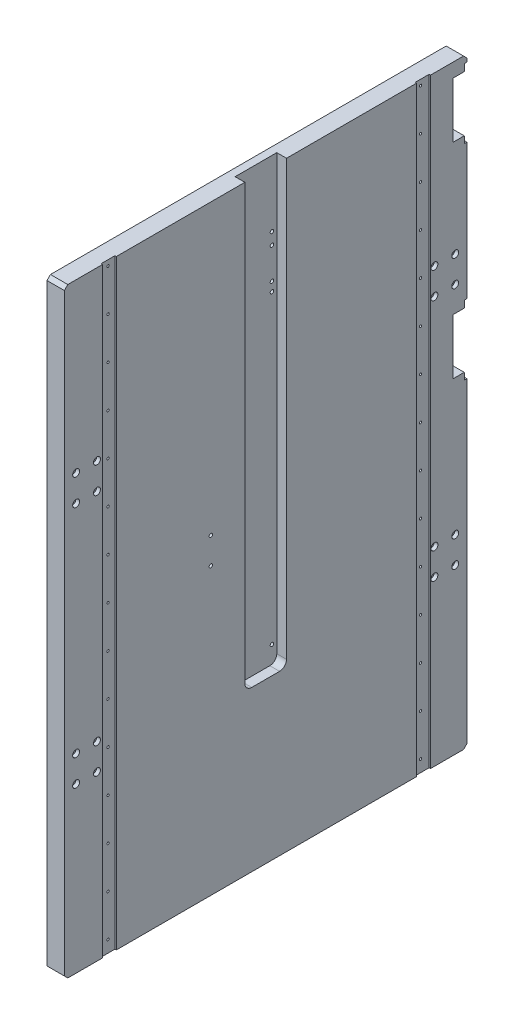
ISO-10303-21;
HEADER;
FILE_DESCRIPTION(('STEP AP214'),'2;1');
FILE_NAME('part.step','',(''),(''),'','','');
FILE_SCHEMA(('AUTOMOTIVE_DESIGN { 1 0 10303 214 1 1 1 1 }'));
ENDSEC;
DATA;
#1=APPLICATION_CONTEXT('core data for automotive mechanical design processes');
#2=APPLICATION_PROTOCOL_DEFINITION('international standard','automotive_design',2000,#1);
#3=PRODUCT_CONTEXT('',#1,'mechanical');
#4=PRODUCT('Part','Part','',(#3));
#5=PRODUCT_RELATED_PRODUCT_CATEGORY('part','',(#4));
#6=PRODUCT_DEFINITION_FORMATION('','',#4);
#7=PRODUCT_DEFINITION_CONTEXT('part definition',#1,'design');
#8=PRODUCT_DEFINITION('design','',#6,#7);
#9=PRODUCT_DEFINITION_SHAPE('','',#8);
#10=(LENGTH_UNIT() NAMED_UNIT(*) SI_UNIT(.MILLI.,.METRE.));
#11=(NAMED_UNIT(*) PLANE_ANGLE_UNIT() SI_UNIT($,.RADIAN.));
#12=(NAMED_UNIT(*) SI_UNIT($,.STERADIAN.) SOLID_ANGLE_UNIT());
#13=UNCERTAINTY_MEASURE_WITH_UNIT(LENGTH_MEASURE(1.E-05),#10,'distance_accuracy_value','');
#14=(GEOMETRIC_REPRESENTATION_CONTEXT(3) GLOBAL_UNCERTAINTY_ASSIGNED_CONTEXT((#13)) GLOBAL_UNIT_ASSIGNED_CONTEXT((#10,
#11,#12)) REPRESENTATION_CONTEXT('',''));
#15=CARTESIAN_POINT('',(0.,0.,0.));
#16=DIRECTION('',(0.,0.,1.));
#17=DIRECTION('',(1.,0.,0.));
#18=AXIS2_PLACEMENT_3D('',#15,#16,#17);
#19=CARTESIAN_POINT('',(-25.,530.,-290.));
#20=DIRECTION('',(0.,0.,-1.));
#21=DIRECTION('',(0.,1.,0.));
#22=AXIS2_PLACEMENT_3D('',#19,#20,#21);
#23=PLANE('',#22);
#24=DIRECTION('',(0.,1.,0.));
#25=VECTOR('',#24,1.);
#26=CARTESIAN_POINT('',(0.,530.,-290.));
#27=LINE('',#26,#25);
#28=CARTESIAN_POINT('',(0.,-330.,-290.));
#29=VERTEX_POINT('',#28);
#30=CARTESIAN_POINT('',(0.,125.,-290.));
#31=VERTEX_POINT('',#30);
#32=EDGE_CURVE('E1245',#29,#31,#27,.T.);
#33=ORIENTED_EDGE('',*,*,#32,.F.);
#34=DIRECTION('',(-1.,0.,0.));
#35=VECTOR('',#34,1.);
#36=CARTESIAN_POINT('',(-25.,-330.,-290.));
#37=LINE('',#36,#35);
#38=CARTESIAN_POINT('',(-25.,-330.,-290.));
#39=VERTEX_POINT('',#38);
#40=EDGE_CURVE('E13',#29,#39,#37,.T.);
#41=ORIENTED_EDGE('',*,*,#40,.T.);
#42=DIRECTION('',(0.,1.,0.));
#43=VECTOR('',#42,1.);
#44=CARTESIAN_POINT('',(-25.,530.,-290.));
#45=LINE('',#44,#43);
#46=CARTESIAN_POINT('',(-25.,125.,-290.));
#47=VERTEX_POINT('',#46);
#48=EDGE_CURVE('E1252',#39,#47,#45,.T.);
#49=ORIENTED_EDGE('',*,*,#48,.T.);
#50=DIRECTION('',(-1.,0.,0.));
#51=VECTOR('',#50,1.);
#52=CARTESIAN_POINT('',(5.,125.,-290.));
#53=LINE('',#52,#51);
#54=EDGE_CURVE('E532',#31,#47,#53,.T.);
#55=ORIENTED_EDGE('',*,*,#54,.F.);
#56=EDGE_LOOP('',(#33,#41,#49,#55));
#57=FACE_BOUND('',#56,.T.);
#58=ADVANCED_FACE('F51',(#57),#23,.T.);
#59=DIRECTION('',(-1.,0.,0.));
#60=VECTOR('',#59,1.);
#61=CARTESIAN_POINT('',(5.,225.,-290.));
#62=LINE('',#61,#60);
#63=CARTESIAN_POINT('',(0.,225.,-290.));
#64=VERTEX_POINT('',#63);
#65=CARTESIAN_POINT('',(-25.,225.,-290.));
#66=VERTEX_POINT('',#65);
#67=EDGE_CURVE('E536',#64,#66,#62,.T.);
#68=ORIENTED_EDGE('',*,*,#67,.T.);
#69=CARTESIAN_POINT('',(-25.,420.,-290.));
#70=VERTEX_POINT('',#69);
#71=EDGE_CURVE('E1255',#66,#70,#45,.T.);
#72=ORIENTED_EDGE('',*,*,#71,.T.);
#73=DIRECTION('',(-1.,0.,0.));
#74=VECTOR('',#73,1.);
#75=CARTESIAN_POINT('',(-25.,420.,-290.));
#76=LINE('',#75,#74);
#77=CARTESIAN_POINT('',(0.,420.,-290.));
#78=VERTEX_POINT('',#77);
#79=EDGE_CURVE('E1270',#78,#70,#76,.T.);
#80=ORIENTED_EDGE('',*,*,#79,.F.);
#81=EDGE_CURVE('E1268',#64,#78,#27,.T.);
#82=ORIENTED_EDGE('',*,*,#81,.F.);
#83=EDGE_LOOP('',(#68,#72,#80,#82));
#84=FACE_BOUND('',#83,.T.);
#85=ADVANCED_FACE('F1353',(#84),#23,.T.);
#86=CARTESIAN_POINT('',(0.,0.,0.));
#87=DIRECTION('',(-1.,0.,0.));
#88=DIRECTION('',(0.,0.,1.));
#89=AXIS2_PLACEMENT_3D('',#86,#87,#88);
#90=PLANE('',#89);
#91=CARTESIAN_POINT('',(0.,520.,-290.));
#92=VERTEX_POINT('',#91);
#93=CARTESIAN_POINT('',(0.,525.,-290.));
#94=VERTEX_POINT('',#93);
#95=EDGE_CURVE('E1265',#92,#94,#27,.T.);
#96=ORIENTED_EDGE('',*,*,#95,.T.);
#97=DIRECTION('',(0.,-0.707106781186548,-0.707106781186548));
#98=VECTOR('',#97,1.);
#99=CARTESIAN_POINT('',(0.,525.,-290.));
#100=LINE('',#99,#98);
#101=CARTESIAN_POINT('',(0.,530.,-285.));
#102=VERTEX_POINT('',#101);
#103=EDGE_CURVE('E1278',#94,#102,#100,.F.);
#104=ORIENTED_EDGE('',*,*,#103,.T.);
#105=DIRECTION('',(0.,0.,1.));
#106=VECTOR('',#105,1.);
#107=CARTESIAN_POINT('',(0.,530.,290.));
#108=LINE('',#107,#106);
#109=CARTESIAN_POINT('',(0.,530.,-237.5));
#110=VERTEX_POINT('',#109);
#111=EDGE_CURVE('E1256',#102,#110,#108,.T.);
#112=ORIENTED_EDGE('',*,*,#111,.T.);
#113=DIRECTION('',(0.,-1.,0.));
#114=VECTOR('',#113,1.);
#115=CARTESIAN_POINT('',(0.,530.,-237.5));
#116=LINE('',#115,#114);
#117=CARTESIAN_POINT('',(0.,-335.,-237.5));
#118=VERTEX_POINT('',#117);
#119=EDGE_CURVE('E1094',#110,#118,#116,.T.);
#120=ORIENTED_EDGE('',*,*,#119,.T.);
#121=DIRECTION('',(0.,0.,-1.));
#122=VECTOR('',#121,1.);
#123=CARTESIAN_POINT('',(0.,-335.,290.));
#124=LINE('',#123,#122);
#125=CARTESIAN_POINT('',(0.,-335.,-285.));
#126=VERTEX_POINT('',#125);
#127=EDGE_CURVE('E1262',#118,#126,#124,.T.);
#128=ORIENTED_EDGE('',*,*,#127,.T.);
#129=DIRECTION('',(0.,-0.70710678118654,0.707106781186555));
#130=VECTOR('',#129,1.);
#131=CARTESIAN_POINT('',(0.,-335.,-285.));
#132=LINE('',#131,#130);
#133=EDGE_CURVE('E1276',#126,#29,#132,.F.);
#134=ORIENTED_EDGE('',*,*,#133,.T.);
#135=ORIENTED_EDGE('',*,*,#32,.T.);
#136=DIRECTION('',(0.,0.,1.));
#137=VECTOR('',#136,1.);
#138=CARTESIAN_POINT('',(0.,125.,0.));
#139=LINE('',#138,#137);
#140=CARTESIAN_POINT('',(0.,125.,-286.));
#141=VERTEX_POINT('',#140);
#142=EDGE_CURVE('E568',#31,#141,#139,.T.);
#143=ORIENTED_EDGE('',*,*,#142,.T.);
#144=DIRECTION('',(0.,1.,0.));
#145=VECTOR('',#144,1.);
#146=CARTESIAN_POINT('',(0.,0.,-286.));
#147=LINE('',#146,#145);
#148=CARTESIAN_POINT('',(0.,135.,-286.));
#149=VERTEX_POINT('',#148);
#150=EDGE_CURVE('E535',#141,#149,#147,.T.);
#151=ORIENTED_EDGE('',*,*,#150,.T.);
#152=DIRECTION('',(0.,0.,1.));
#153=VECTOR('',#152,1.);
#154=CARTESIAN_POINT('',(0.,135.,0.));
#155=LINE('',#154,#153);
#156=CARTESIAN_POINT('',(0.,135.,-270.));
#157=VERTEX_POINT('',#156);
#158=EDGE_CURVE('E553',#149,#157,#155,.T.);
#159=ORIENTED_EDGE('',*,*,#158,.T.);
#160=DIRECTION('',(0.,1.,0.));
#161=VECTOR('',#160,1.);
#162=CARTESIAN_POINT('',(0.,0.,-270.));
#163=LINE('',#162,#161);
#164=CARTESIAN_POINT('',(0.,215.,-270.));
#165=VERTEX_POINT('',#164);
#166=EDGE_CURVE('E556',#157,#165,#163,.T.);
#167=ORIENTED_EDGE('',*,*,#166,.T.);
#168=DIRECTION('',(0.,0.,-1.));
#169=VECTOR('',#168,1.);
#170=CARTESIAN_POINT('',(0.,215.,0.));
#171=LINE('',#170,#169);
#172=CARTESIAN_POINT('',(0.,215.,-286.));
#173=VERTEX_POINT('',#172);
#174=EDGE_CURVE('E559',#165,#173,#171,.T.);
#175=ORIENTED_EDGE('',*,*,#174,.T.);
#176=DIRECTION('',(0.,1.,0.));
#177=VECTOR('',#176,1.);
#178=CARTESIAN_POINT('',(0.,0.,-286.));
#179=LINE('',#178,#177);
#180=CARTESIAN_POINT('',(0.,225.,-286.));
#181=VERTEX_POINT('',#180);
#182=EDGE_CURVE('E562',#173,#181,#179,.T.);
#183=ORIENTED_EDGE('',*,*,#182,.T.);
#184=DIRECTION('',(0.,0.,-1.));
#185=VECTOR('',#184,1.);
#186=CARTESIAN_POINT('',(0.,225.,0.));
#187=LINE('',#186,#185);
#188=EDGE_CURVE('E565',#181,#64,#187,.T.);
#189=ORIENTED_EDGE('',*,*,#188,.T.);
#190=ORIENTED_EDGE('',*,*,#81,.T.);
#191=DIRECTION('',(0.,0.,1.));
#192=VECTOR('',#191,1.);
#193=CARTESIAN_POINT('',(0.,420.,0.));
#194=LINE('',#193,#192);
#195=CARTESIAN_POINT('',(0.,420.,-286.));
#196=VERTEX_POINT('',#195);
#197=EDGE_CURVE('E666',#78,#196,#194,.T.);
#198=ORIENTED_EDGE('',*,*,#197,.T.);
#199=DIRECTION('',(0.,1.,0.));
#200=VECTOR('',#199,1.);
#201=CARTESIAN_POINT('',(0.,0.,-286.));
#202=LINE('',#201,#200);
#203=CARTESIAN_POINT('',(0.,430.,-286.));
#204=VERTEX_POINT('',#203);
#205=EDGE_CURVE('E669',#196,#204,#202,.T.);
#206=ORIENTED_EDGE('',*,*,#205,.T.);
#207=DIRECTION('',(0.,0.,1.));
#208=VECTOR('',#207,1.);
#209=CARTESIAN_POINT('',(0.,430.,0.));
#210=LINE('',#209,#208);
#211=CARTESIAN_POINT('',(0.,430.,-270.));
#212=VERTEX_POINT('',#211);
#213=EDGE_CURVE('E672',#204,#212,#210,.T.);
#214=ORIENTED_EDGE('',*,*,#213,.T.);
#215=DIRECTION('',(0.,1.,0.));
#216=VECTOR('',#215,1.);
#217=CARTESIAN_POINT('',(0.,0.,-270.));
#218=LINE('',#217,#216);
#219=CARTESIAN_POINT('',(0.,510.,-270.));
#220=VERTEX_POINT('',#219);
#221=EDGE_CURVE('E675',#212,#220,#218,.T.);
#222=ORIENTED_EDGE('',*,*,#221,.T.);
#223=DIRECTION('',(0.,0.,-1.));
#224=VECTOR('',#223,1.);
#225=CARTESIAN_POINT('',(0.,510.,0.));
#226=LINE('',#225,#224);
#227=CARTESIAN_POINT('',(0.,510.,-286.));
#228=VERTEX_POINT('',#227);
#229=EDGE_CURVE('E678',#220,#228,#226,.T.);
#230=ORIENTED_EDGE('',*,*,#229,.T.);
#231=DIRECTION('',(0.,1.,0.));
#232=VECTOR('',#231,1.);
#233=CARTESIAN_POINT('',(0.,0.,-286.));
#234=LINE('',#233,#232);
#235=CARTESIAN_POINT('',(0.,520.,-286.));
#236=VERTEX_POINT('',#235);
#237=EDGE_CURVE('E681',#228,#236,#234,.T.);
#238=ORIENTED_EDGE('',*,*,#237,.T.);
#239=DIRECTION('',(0.,0.,-1.));
#240=VECTOR('',#239,1.);
#241=CARTESIAN_POINT('',(0.,520.,0.));
#242=LINE('',#241,#240);
#243=EDGE_CURVE('E654',#236,#92,#242,.T.);
#244=ORIENTED_EDGE('',*,*,#243,.T.);
#245=EDGE_LOOP('',(#96,#104,#112,#120,#128,#134,#135,#143,#151,#159,#167,#175,#183,#189,#190,
#198,#206,#214,#222,#230,#238,#244));
#246=FACE_BOUND('',#245,.T.);
#247=CARTESIAN_POINT('',(0.,-99.,-273.));
#248=DIRECTION('',(1.,0.,0.));
#249=DIRECTION('',(0.,0.,-1.));
#250=AXIS2_PLACEMENT_3D('',#247,#248,#249);
#251=CIRCLE('',#250,5.);
#252=CARTESIAN_POINT('',(0.,-99.,-278.));
#253=VERTEX_POINT('',#252);
#254=EDGE_CURVE('E900',#253,#253,#251,.T.);
#255=ORIENTED_EDGE('',*,*,#254,.F.);
#256=EDGE_LOOP('',(#255));
#257=FACE_BOUND('',#256,.T.);
#258=CARTESIAN_POINT('',(0.,-61.,-243.));
#259=DIRECTION('',(1.,0.,0.));
#260=DIRECTION('',(0.,0.,-1.));
#261=AXIS2_PLACEMENT_3D('',#258,#259,#260);
#262=CIRCLE('',#261,5.);
#263=CARTESIAN_POINT('',(0.,-61.,-248.));
#264=VERTEX_POINT('',#263);
#265=EDGE_CURVE('E924',#264,#264,#262,.T.);
#266=ORIENTED_EDGE('',*,*,#265,.F.);
#267=EDGE_LOOP('',(#266));
#268=FACE_BOUND('',#267,.T.);
#269=CARTESIAN_POINT('',(0.,289.,-273.));
#270=DIRECTION('',(1.,0.,0.));
#271=DIRECTION('',(0.,0.,-1.));
#272=AXIS2_PLACEMENT_3D('',#269,#270,#271);
#273=CIRCLE('',#272,5.);
#274=CARTESIAN_POINT('',(0.,289.,-278.));
#275=VERTEX_POINT('',#274);
#276=EDGE_CURVE('E984',#275,#275,#273,.T.);
#277=ORIENTED_EDGE('',*,*,#276,.F.);
#278=EDGE_LOOP('',(#277));
#279=FACE_BOUND('',#278,.T.);
#280=CARTESIAN_POINT('',(0.,251.,-273.));
#281=DIRECTION('',(1.,0.,0.));
#282=DIRECTION('',(0.,0.,-1.));
#283=AXIS2_PLACEMENT_3D('',#280,#281,#282);
#284=CIRCLE('',#283,5.);
#285=CARTESIAN_POINT('',(0.,251.,-278.));
#286=VERTEX_POINT('',#285);
#287=EDGE_CURVE('E996',#286,#286,#284,.T.);
#288=ORIENTED_EDGE('',*,*,#287,.F.);
#289=EDGE_LOOP('',(#288));
#290=FACE_BOUND('',#289,.T.);
#291=CARTESIAN_POINT('',(0.,251.,-243.));
#292=DIRECTION('',(1.,0.,0.));
#293=DIRECTION('',(0.,0.,-1.));
#294=AXIS2_PLACEMENT_3D('',#291,#292,#293);
#295=CIRCLE('',#294,5.);
#296=CARTESIAN_POINT('',(0.,251.,-248.));
#297=VERTEX_POINT('',#296);
#298=EDGE_CURVE('E1008',#297,#297,#295,.T.);
#299=ORIENTED_EDGE('',*,*,#298,.F.);
#300=EDGE_LOOP('',(#299));
#301=FACE_BOUND('',#300,.T.);
#302=CARTESIAN_POINT('',(0.,289.,-243.));
#303=DIRECTION('',(1.,0.,0.));
#304=DIRECTION('',(0.,0.,-1.));
#305=AXIS2_PLACEMENT_3D('',#302,#303,#304);
#306=CIRCLE('',#305,5.);
#307=CARTESIAN_POINT('',(0.,289.,-248.));
#308=VERTEX_POINT('',#307);
#309=EDGE_CURVE('E1020',#308,#308,#306,.T.);
#310=ORIENTED_EDGE('',*,*,#309,.F.);
#311=EDGE_LOOP('',(#310));
#312=FACE_BOUND('',#311,.T.);
#313=CARTESIAN_POINT('',(0.,-99.,-243.));
#314=DIRECTION('',(1.,0.,0.));
#315=DIRECTION('',(0.,0.,-1.));
#316=AXIS2_PLACEMENT_3D('',#313,#314,#315);
#317=CIRCLE('',#316,5.);
#318=CARTESIAN_POINT('',(0.,-99.,-248.));
#319=VERTEX_POINT('',#318);
#320=EDGE_CURVE('E912',#319,#319,#317,.T.);
#321=ORIENTED_EDGE('',*,*,#320,.F.);
#322=EDGE_LOOP('',(#321));
#323=FACE_BOUND('',#322,.T.);
#324=CARTESIAN_POINT('',(0.,-61.,-273.));
#325=DIRECTION('',(1.,0.,0.));
#326=DIRECTION('',(0.,0.,-1.));
#327=AXIS2_PLACEMENT_3D('',#324,#325,#326);
#328=CIRCLE('',#327,5.);
#329=CARTESIAN_POINT('',(0.,-61.,-278.));
#330=VERTEX_POINT('',#329);
#331=EDGE_CURVE('E888',#330,#330,#328,.T.);
#332=ORIENTED_EDGE('',*,*,#331,.F.);
#333=EDGE_LOOP('',(#332));
#334=FACE_BOUND('',#333,.T.);
#335=ADVANCED_FACE('F1343',(#246,#257,#268,#279,#290,#301,#312,#323,#334),#90,.F.);
#336=CARTESIAN_POINT('',(-25.,0.,0.));
#337=DIRECTION('',(-1.,0.,0.));
#338=DIRECTION('',(0.,0.,1.));
#339=AXIS2_PLACEMENT_3D('',#336,#337,#338);
#340=PLANE('',#339);
#341=DIRECTION('',(0.,0.,1.));
#342=VECTOR('',#341,1.);
#343=CARTESIAN_POINT('',(-25.,530.,290.));
#344=LINE('',#343,#342);
#345=CARTESIAN_POINT('',(-25.,530.,-285.));
#346=VERTEX_POINT('',#345);
#347=CARTESIAN_POINT('',(-25.,530.,285.));
#348=VERTEX_POINT('',#347);
#349=EDGE_CURVE('E1241',#346,#348,#344,.T.);
#350=ORIENTED_EDGE('',*,*,#349,.F.);
#351=DIRECTION('',(0.,0.707106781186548,0.707106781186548));
#352=VECTOR('',#351,1.);
#353=CARTESIAN_POINT('',(-25.,407.5,-407.5));
#354=LINE('',#353,#352);
#355=CARTESIAN_POINT('',(-25.,525.,-290.));
#356=VERTEX_POINT('',#355);
#357=EDGE_CURVE('E1291',#346,#356,#354,.F.);
#358=ORIENTED_EDGE('',*,*,#357,.T.);
#359=CARTESIAN_POINT('',(-25.,520.,-290.));
#360=VERTEX_POINT('',#359);
#361=EDGE_CURVE('E1251',#360,#356,#45,.T.);
#362=ORIENTED_EDGE('',*,*,#361,.F.);
#363=DIRECTION('',(0.,0.,-1.));
#364=VECTOR('',#363,1.);
#365=CARTESIAN_POINT('',(-25.,520.,-286.));
#366=LINE('',#365,#364);
#367=CARTESIAN_POINT('',(-25.,520.,-286.));
#368=VERTEX_POINT('',#367);
#369=EDGE_CURVE('E649',#368,#360,#366,.T.);
#370=ORIENTED_EDGE('',*,*,#369,.F.);
#371=DIRECTION('',(0.,1.,0.));
#372=VECTOR('',#371,1.);
#373=CARTESIAN_POINT('',(-25.,510.,-286.));
#374=LINE('',#373,#372);
#375=CARTESIAN_POINT('',(-25.,510.,-286.));
#376=VERTEX_POINT('',#375);
#377=EDGE_CURVE('E646',#376,#368,#374,.T.);
#378=ORIENTED_EDGE('',*,*,#377,.F.);
#379=DIRECTION('',(0.,0.,-1.));
#380=VECTOR('',#379,1.);
#381=CARTESIAN_POINT('',(-25.,510.,-286.));
#382=LINE('',#381,#380);
#383=CARTESIAN_POINT('',(-25.,510.,-270.));
#384=VERTEX_POINT('',#383);
#385=EDGE_CURVE('E643',#384,#376,#382,.T.);
#386=ORIENTED_EDGE('',*,*,#385,.F.);
#387=DIRECTION('',(0.,1.,0.));
#388=VECTOR('',#387,1.);
#389=CARTESIAN_POINT('',(-25.,430.,-270.));
#390=LINE('',#389,#388);
#391=CARTESIAN_POINT('',(-25.,430.,-270.));
#392=VERTEX_POINT('',#391);
#393=EDGE_CURVE('E640',#392,#384,#390,.T.);
#394=ORIENTED_EDGE('',*,*,#393,.F.);
#395=DIRECTION('',(0.,0.,1.));
#396=VECTOR('',#395,1.);
#397=CARTESIAN_POINT('',(-25.,430.,-286.));
#398=LINE('',#397,#396);
#399=CARTESIAN_POINT('',(-25.,430.,-286.));
#400=VERTEX_POINT('',#399);
#401=EDGE_CURVE('E637',#400,#392,#398,.T.);
#402=ORIENTED_EDGE('',*,*,#401,.F.);
#403=DIRECTION('',(0.,1.,0.));
#404=VECTOR('',#403,1.);
#405=CARTESIAN_POINT('',(-25.,420.,-286.));
#406=LINE('',#405,#404);
#407=CARTESIAN_POINT('',(-25.,420.,-286.));
#408=VERTEX_POINT('',#407);
#409=EDGE_CURVE('E634',#408,#400,#406,.T.);
#410=ORIENTED_EDGE('',*,*,#409,.F.);
#411=DIRECTION('',(0.,0.,1.));
#412=VECTOR('',#411,1.);
#413=CARTESIAN_POINT('',(-25.,420.,-290.));
#414=LINE('',#413,#412);
#415=EDGE_CURVE('E631',#70,#408,#414,.T.);
#416=ORIENTED_EDGE('',*,*,#415,.F.);
#417=ORIENTED_EDGE('',*,*,#71,.F.);
#418=DIRECTION('',(0.,0.,-1.));
#419=VECTOR('',#418,1.);
#420=CARTESIAN_POINT('',(-25.,225.,-286.));
#421=LINE('',#420,#419);
#422=CARTESIAN_POINT('',(-25.,225.,-286.));
#423=VERTEX_POINT('',#422);
#424=EDGE_CURVE('E529',#423,#66,#421,.T.);
#425=ORIENTED_EDGE('',*,*,#424,.F.);
#426=DIRECTION('',(0.,1.,0.));
#427=VECTOR('',#426,1.);
#428=CARTESIAN_POINT('',(-25.,215.,-286.));
#429=LINE('',#428,#427);
#430=CARTESIAN_POINT('',(-25.,215.,-286.));
#431=VERTEX_POINT('',#430);
#432=EDGE_CURVE('E526',#431,#423,#429,.T.);
#433=ORIENTED_EDGE('',*,*,#432,.F.);
#434=DIRECTION('',(0.,0.,-1.));
#435=VECTOR('',#434,1.);
#436=CARTESIAN_POINT('',(-25.,215.,-286.));
#437=LINE('',#436,#435);
#438=CARTESIAN_POINT('',(-25.,215.,-270.));
#439=VERTEX_POINT('',#438);
#440=EDGE_CURVE('E523',#439,#431,#437,.T.);
#441=ORIENTED_EDGE('',*,*,#440,.F.);
#442=DIRECTION('',(0.,1.,0.));
#443=VECTOR('',#442,1.);
#444=CARTESIAN_POINT('',(-25.,135.,-270.));
#445=LINE('',#444,#443);
#446=CARTESIAN_POINT('',(-25.,135.,-270.));
#447=VERTEX_POINT('',#446);
#448=EDGE_CURVE('E520',#447,#439,#445,.T.);
#449=ORIENTED_EDGE('',*,*,#448,.F.);
#450=DIRECTION('',(0.,0.,1.));
#451=VECTOR('',#450,1.);
#452=CARTESIAN_POINT('',(-25.,135.,-286.));
#453=LINE('',#452,#451);
#454=CARTESIAN_POINT('',(-25.,135.,-286.));
#455=VERTEX_POINT('',#454);
#456=EDGE_CURVE('E517',#455,#447,#453,.T.);
#457=ORIENTED_EDGE('',*,*,#456,.F.);
#458=DIRECTION('',(0.,1.,0.));
#459=VECTOR('',#458,1.);
#460=CARTESIAN_POINT('',(-25.,125.,-286.));
#461=LINE('',#460,#459);
#462=CARTESIAN_POINT('',(-25.,125.,-286.));
#463=VERTEX_POINT('',#462);
#464=EDGE_CURVE('E514',#463,#455,#461,.T.);
#465=ORIENTED_EDGE('',*,*,#464,.F.);
#466=DIRECTION('',(0.,0.,1.));
#467=VECTOR('',#466,1.);
#468=CARTESIAN_POINT('',(-25.,125.,-290.));
#469=LINE('',#468,#467);
#470=EDGE_CURVE('E512',#47,#463,#469,.T.);
#471=ORIENTED_EDGE('',*,*,#470,.F.);
#472=ORIENTED_EDGE('',*,*,#48,.F.);
#473=DIRECTION('',(0.,0.70710678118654,-0.707106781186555));
#474=VECTOR('',#473,1.);
#475=CARTESIAN_POINT('',(-25.,-310.000000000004,-309.999999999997));
#476=LINE('',#475,#474);
#477=CARTESIAN_POINT('',(-25.,-335.,-285.));
#478=VERTEX_POINT('',#477);
#479=EDGE_CURVE('E1285',#39,#478,#476,.F.);
#480=ORIENTED_EDGE('',*,*,#479,.T.);
#481=DIRECTION('',(0.,0.,-1.));
#482=VECTOR('',#481,1.);
#483=CARTESIAN_POINT('',(-25.,-335.,290.));
#484=LINE('',#483,#482);
#485=CARTESIAN_POINT('',(-25.,-335.,285.));
#486=VERTEX_POINT('',#485);
#487=EDGE_CURVE('E1248',#486,#478,#484,.T.);
#488=ORIENTED_EDGE('',*,*,#487,.F.);
#489=DIRECTION('',(0.,-0.707106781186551,-0.707106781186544));
#490=VECTOR('',#489,1.);
#491=CARTESIAN_POINT('',(-25.,-309.999999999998,310.000000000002));
#492=LINE('',#491,#490);
#493=CARTESIAN_POINT('',(-25.,-330.,290.));
#494=VERTEX_POINT('',#493);
#495=EDGE_CURVE('E1287',#486,#494,#492,.F.);
#496=ORIENTED_EDGE('',*,*,#495,.T.);
#497=DIRECTION('',(0.,-1.,0.));
#498=VECTOR('',#497,1.);
#499=CARTESIAN_POINT('',(-25.,530.,290.));
#500=LINE('',#499,#498);
#501=CARTESIAN_POINT('',(-25.,525.,290.));
#502=VERTEX_POINT('',#501);
#503=EDGE_CURVE('E1244',#502,#494,#500,.T.);
#504=ORIENTED_EDGE('',*,*,#503,.F.);
#505=DIRECTION('',(0.,-0.707106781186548,0.707106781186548));
#506=VECTOR('',#505,1.);
#507=CARTESIAN_POINT('',(-25.,407.5,407.5));
#508=LINE('',#507,#506);
#509=EDGE_CURVE('E1289',#502,#348,#508,.F.);
#510=ORIENTED_EDGE('',*,*,#509,.T.);
#511=EDGE_LOOP('',(#350,#358,#362,#370,#378,#386,#394,#402,#410,#416,#417,#425,#433,#441,#449,
#457,#465,#471,#472,#480,#488,#496,#504,#510));
#512=FACE_BOUND('',#511,.T.);
#513=CARTESIAN_POINT('',(-25.,76.,21.));
#514=DIRECTION('',(-1.,0.,0.));
#515=DIRECTION('',(0.,0.,1.));
#516=AXIS2_PLACEMENT_3D('',#513,#514,#515);
#517=CIRCLE('',#516,2.5);
#518=CARTESIAN_POINT('',(-25.,76.,23.5));
#519=VERTEX_POINT('',#518);
#520=EDGE_CURVE('E684',#519,#519,#517,.T.);
#521=ORIENTED_EDGE('',*,*,#520,.F.);
#522=EDGE_LOOP('',(#521));
#523=FACE_BOUND('',#522,.T.);
#524=CARTESIAN_POINT('',(-25.,76.,79.));
#525=DIRECTION('',(-1.,0.,0.));
#526=DIRECTION('',(0.,0.,1.));
#527=AXIS2_PLACEMENT_3D('',#524,#525,#526);
#528=CIRCLE('',#527,2.5);
#529=CARTESIAN_POINT('',(-25.,76.,81.5));
#530=VERTEX_POINT('',#529);
#531=EDGE_CURVE('E690',#530,#530,#528,.T.);
#532=ORIENTED_EDGE('',*,*,#531,.F.);
#533=EDGE_LOOP('',(#532));
#534=FACE_BOUND('',#533,.T.);
#535=CARTESIAN_POINT('',(-25.,114.,79.));
#536=DIRECTION('',(-1.,0.,0.));
#537=DIRECTION('',(0.,0.,1.));
#538=AXIS2_PLACEMENT_3D('',#535,#536,#537);
#539=CIRCLE('',#538,2.5);
#540=CARTESIAN_POINT('',(-25.,114.,81.5));
#541=VERTEX_POINT('',#540);
#542=EDGE_CURVE('E696',#541,#541,#539,.T.);
#543=ORIENTED_EDGE('',*,*,#542,.F.);
#544=EDGE_LOOP('',(#543));
#545=FACE_BOUND('',#544,.T.);
#546=CARTESIAN_POINT('',(-25.,114.,21.));
#547=DIRECTION('',(-1.,0.,0.));
#548=DIRECTION('',(0.,0.,1.));
#549=AXIS2_PLACEMENT_3D('',#546,#547,#548);
#550=CIRCLE('',#549,2.5);
#551=CARTESIAN_POINT('',(-25.,114.,23.5));
#552=VERTEX_POINT('',#551);
#553=EDGE_CURVE('E702',#552,#552,#550,.T.);
#554=ORIENTED_EDGE('',*,*,#553,.F.);
#555=EDGE_LOOP('',(#554));
#556=FACE_BOUND('',#555,.T.);
#557=CARTESIAN_POINT('',(-25.,-99.,243.));
#558=DIRECTION('',(1.,0.,0.));
#559=DIRECTION('',(0.,0.,-1.));
#560=AXIS2_PLACEMENT_3D('',#557,#558,#559);
#561=CIRCLE('',#560,2.74999999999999);
#562=CARTESIAN_POINT('',(-25.,-99.,240.25));
#563=VERTEX_POINT('',#562);
#564=EDGE_CURVE('E945',#563,#563,#561,.T.);
#565=ORIENTED_EDGE('',*,*,#564,.T.);
#566=EDGE_LOOP('',(#565));
#567=FACE_BOUND('',#566,.T.);
#568=CARTESIAN_POINT('',(-25.,360.,-23.));
#569=DIRECTION('',(1.,0.,0.));
#570=DIRECTION('',(0.,0.,-1.));
#571=AXIS2_PLACEMENT_3D('',#568,#569,#570);
#572=CIRCLE('',#571,2.5);
#573=CARTESIAN_POINT('',(-25.,360.,-25.5));
#574=VERTEX_POINT('',#573);
#575=EDGE_CURVE('E1149',#574,#574,#572,.T.);
#576=ORIENTED_EDGE('',*,*,#575,.T.);
#577=EDGE_LOOP('',(#576));
#578=FACE_BOUND('',#577,.T.);
#579=CARTESIAN_POINT('',(-25.,373.,-23.));
#580=DIRECTION('',(1.,0.,0.));
#581=DIRECTION('',(0.,0.,-1.));
#582=AXIS2_PLACEMENT_3D('',#579,#580,#581);
#583=CIRCLE('',#582,2.5);
#584=CARTESIAN_POINT('',(-25.,373.,-25.5));
#585=VERTEX_POINT('',#584);
#586=EDGE_CURVE('E1155',#585,#585,#583,.T.);
#587=ORIENTED_EDGE('',*,*,#586,.T.);
#588=EDGE_LOOP('',(#587));
#589=FACE_BOUND('',#588,.T.);
#590=CARTESIAN_POINT('',(-25.,418.,23.));
#591=DIRECTION('',(1.,0.,0.));
#592=DIRECTION('',(0.,0.,-1.));
#593=AXIS2_PLACEMENT_3D('',#590,#591,#592);
#594=CIRCLE('',#593,2.5);
#595=CARTESIAN_POINT('',(-25.,418.,20.5));
#596=VERTEX_POINT('',#595);
#597=EDGE_CURVE('E1161',#596,#596,#594,.T.);
#598=ORIENTED_EDGE('',*,*,#597,.T.);
#599=EDGE_LOOP('',(#598));
#600=FACE_BOUND('',#599,.T.);
#601=CARTESIAN_POINT('',(-25.,435.,23.));
#602=DIRECTION('',(1.,0.,0.));
#603=DIRECTION('',(0.,0.,-1.));
#604=AXIS2_PLACEMENT_3D('',#601,#602,#603);
#605=CIRCLE('',#604,2.5);
#606=CARTESIAN_POINT('',(-25.,435.,20.5));
#607=VERTEX_POINT('',#606);
#608=EDGE_CURVE('E1167',#607,#607,#605,.T.);
#609=ORIENTED_EDGE('',*,*,#608,.T.);
#610=EDGE_LOOP('',(#609));
#611=FACE_BOUND('',#610,.T.);
#612=CARTESIAN_POINT('',(-25.,435.,-23.));
#613=DIRECTION('',(1.,0.,0.));
#614=DIRECTION('',(0.,0.,-1.));
#615=AXIS2_PLACEMENT_3D('',#612,#613,#614);
#616=CIRCLE('',#615,2.5);
#617=CARTESIAN_POINT('',(-25.,435.,-25.5));
#618=VERTEX_POINT('',#617);
#619=EDGE_CURVE('E1173',#618,#618,#616,.T.);
#620=ORIENTED_EDGE('',*,*,#619,.T.);
#621=EDGE_LOOP('',(#620));
#622=FACE_BOUND('',#621,.T.);
#623=CARTESIAN_POINT('',(-25.,418.,-23.));
#624=DIRECTION('',(1.,0.,0.));
#625=DIRECTION('',(0.,0.,-1.));
#626=AXIS2_PLACEMENT_3D('',#623,#624,#625);
#627=CIRCLE('',#626,2.5);
#628=CARTESIAN_POINT('',(-25.,418.,-25.5));
#629=VERTEX_POINT('',#628);
#630=EDGE_CURVE('E1179',#629,#629,#627,.T.);
#631=ORIENTED_EDGE('',*,*,#630,.T.);
#632=EDGE_LOOP('',(#631));
#633=FACE_BOUND('',#632,.T.);
#634=CARTESIAN_POINT('',(-25.,-79.9999999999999,23.));
#635=DIRECTION('',(1.,0.,0.));
#636=DIRECTION('',(0.,0.,-1.));
#637=AXIS2_PLACEMENT_3D('',#634,#635,#636);
#638=CIRCLE('',#637,2.5);
#639=CARTESIAN_POINT('',(-25.,-79.9999999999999,20.5));
#640=VERTEX_POINT('',#639);
#641=EDGE_CURVE('E1185',#640,#640,#638,.T.);
#642=ORIENTED_EDGE('',*,*,#641,.T.);
#643=EDGE_LOOP('',(#642));
#644=FACE_BOUND('',#643,.T.);
#645=CARTESIAN_POINT('',(-25.,-79.9999999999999,-23.0000000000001));
#646=DIRECTION('',(1.,0.,0.));
#647=DIRECTION('',(0.,0.,-1.));
#648=AXIS2_PLACEMENT_3D('',#645,#646,#647);
#649=CIRCLE('',#648,2.5);
#650=CARTESIAN_POINT('',(-25.,-79.9999999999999,-25.5000000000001));
#651=VERTEX_POINT('',#650);
#652=EDGE_CURVE('E1191',#651,#651,#649,.T.);
#653=ORIENTED_EDGE('',*,*,#652,.T.);
#654=EDGE_LOOP('',(#653));
#655=FACE_BOUND('',#654,.T.);
#656=CARTESIAN_POINT('',(-25.,360.,23.));
#657=DIRECTION('',(1.,0.,0.));
#658=DIRECTION('',(0.,0.,-1.));
#659=AXIS2_PLACEMENT_3D('',#656,#657,#658);
#660=CIRCLE('',#659,2.5);
#661=CARTESIAN_POINT('',(-25.,360.,20.5));
#662=VERTEX_POINT('',#661);
#663=EDGE_CURVE('E1143',#662,#662,#660,.T.);
#664=ORIENTED_EDGE('',*,*,#663,.T.);
#665=EDGE_LOOP('',(#664));
#666=FACE_BOUND('',#665,.T.);
#667=CARTESIAN_POINT('',(-25.,373.,23.));
#668=DIRECTION('',(1.,0.,0.));
#669=DIRECTION('',(0.,0.,-1.));
#670=AXIS2_PLACEMENT_3D('',#667,#668,#669);
#671=CIRCLE('',#670,2.5);
#672=CARTESIAN_POINT('',(-25.,373.,20.5));
#673=VERTEX_POINT('',#672);
#674=EDGE_CURVE('E1137',#673,#673,#671,.T.);
#675=ORIENTED_EDGE('',*,*,#674,.T.);
#676=EDGE_LOOP('',(#675));
#677=FACE_BOUND('',#676,.T.);
#678=CARTESIAN_POINT('',(-25.,289.,243.));
#679=DIRECTION('',(1.,0.,0.));
#680=DIRECTION('',(0.,0.,-1.));
#681=AXIS2_PLACEMENT_3D('',#678,#679,#680);
#682=CIRCLE('',#681,2.74999999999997);
#683=CARTESIAN_POINT('',(-25.,289.,240.25));
#684=VERTEX_POINT('',#683);
#685=EDGE_CURVE('E1077',#684,#684,#682,.T.);
#686=ORIENTED_EDGE('',*,*,#685,.T.);
#687=EDGE_LOOP('',(#686));
#688=FACE_BOUND('',#687,.T.);
#689=CARTESIAN_POINT('',(-25.,289.,273.));
#690=DIRECTION('',(1.,0.,0.));
#691=DIRECTION('',(0.,0.,-1.));
#692=AXIS2_PLACEMENT_3D('',#689,#690,#691);
#693=CIRCLE('',#692,2.74999999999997);
#694=CARTESIAN_POINT('',(-25.,289.,270.25));
#695=VERTEX_POINT('',#694);
#696=EDGE_CURVE('E1065',#695,#695,#693,.T.);
#697=ORIENTED_EDGE('',*,*,#696,.T.);
#698=EDGE_LOOP('',(#697));
#699=FACE_BOUND('',#698,.T.);
#700=CARTESIAN_POINT('',(-25.,251.,273.));
#701=DIRECTION('',(1.,0.,0.));
#702=DIRECTION('',(0.,0.,-1.));
#703=AXIS2_PLACEMENT_3D('',#700,#701,#702);
#704=CIRCLE('',#703,2.74999999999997);
#705=CARTESIAN_POINT('',(-25.,251.,270.25));
#706=VERTEX_POINT('',#705);
#707=EDGE_CURVE('E1053',#706,#706,#704,.T.);
#708=ORIENTED_EDGE('',*,*,#707,.T.);
#709=EDGE_LOOP('',(#708));
#710=FACE_BOUND('',#709,.T.);
#711=CARTESIAN_POINT('',(-25.,251.,243.));
#712=DIRECTION('',(1.,0.,0.));
#713=DIRECTION('',(0.,0.,-1.));
#714=AXIS2_PLACEMENT_3D('',#711,#712,#713);
#715=CIRCLE('',#714,2.74999999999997);
#716=CARTESIAN_POINT('',(-25.,251.,240.25));
#717=VERTEX_POINT('',#716);
#718=EDGE_CURVE('E1041',#717,#717,#715,.T.);
#719=ORIENTED_EDGE('',*,*,#718,.T.);
#720=EDGE_LOOP('',(#719));
#721=FACE_BOUND('',#720,.T.);
#722=CARTESIAN_POINT('',(-25.,289.,-243.));
#723=DIRECTION('',(1.,0.,0.));
#724=DIRECTION('',(0.,0.,-1.));
#725=AXIS2_PLACEMENT_3D('',#722,#723,#724);
#726=CIRCLE('',#725,2.74999999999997);
#727=CARTESIAN_POINT('',(-25.,289.,-245.75));
#728=VERTEX_POINT('',#727);
#729=EDGE_CURVE('E1029',#728,#728,#726,.T.);
#730=ORIENTED_EDGE('',*,*,#729,.T.);
#731=EDGE_LOOP('',(#730));
#732=FACE_BOUND('',#731,.T.);
#733=CARTESIAN_POINT('',(-25.,251.,-243.));
#734=DIRECTION('',(1.,0.,0.));
#735=DIRECTION('',(0.,0.,-1.));
#736=AXIS2_PLACEMENT_3D('',#733,#734,#735);
#737=CIRCLE('',#736,2.74999999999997);
#738=CARTESIAN_POINT('',(-25.,251.,-245.75));
#739=VERTEX_POINT('',#738);
#740=EDGE_CURVE('E1017',#739,#739,#737,.T.);
#741=ORIENTED_EDGE('',*,*,#740,.T.);
#742=EDGE_LOOP('',(#741));
#743=FACE_BOUND('',#742,.T.);
#744=CARTESIAN_POINT('',(-25.,251.,-273.));
#745=DIRECTION('',(1.,0.,0.));
#746=DIRECTION('',(0.,0.,-1.));
#747=AXIS2_PLACEMENT_3D('',#744,#745,#746);
#748=CIRCLE('',#747,2.74999999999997);
#749=CARTESIAN_POINT('',(-25.,251.,-275.75));
#750=VERTEX_POINT('',#749);
#751=EDGE_CURVE('E1005',#750,#750,#748,.T.);
#752=ORIENTED_EDGE('',*,*,#751,.T.);
#753=EDGE_LOOP('',(#752));
#754=FACE_BOUND('',#753,.T.);
#755=CARTESIAN_POINT('',(-25.,289.,-273.));
#756=DIRECTION('',(1.,0.,0.));
#757=DIRECTION('',(0.,0.,-1.));
#758=AXIS2_PLACEMENT_3D('',#755,#756,#757);
#759=CIRCLE('',#758,2.74999999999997);
#760=CARTESIAN_POINT('',(-25.,289.,-275.75));
#761=VERTEX_POINT('',#760);
#762=EDGE_CURVE('E993',#761,#761,#759,.T.);
#763=ORIENTED_EDGE('',*,*,#762,.T.);
#764=EDGE_LOOP('',(#763));
#765=FACE_BOUND('',#764,.T.);
#766=CARTESIAN_POINT('',(-25.,-60.9999999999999,243.));
#767=DIRECTION('',(1.,0.,0.));
#768=DIRECTION('',(0.,0.,-1.));
#769=AXIS2_PLACEMENT_3D('',#766,#767,#768);
#770=CIRCLE('',#769,2.75);
#771=CARTESIAN_POINT('',(-25.,-60.9999999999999,240.25));
#772=VERTEX_POINT('',#771);
#773=EDGE_CURVE('E981',#772,#772,#770,.T.);
#774=ORIENTED_EDGE('',*,*,#773,.T.);
#775=EDGE_LOOP('',(#774));
#776=FACE_BOUND('',#775,.T.);
#777=CARTESIAN_POINT('',(-25.,-60.9999999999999,273.));
#778=DIRECTION('',(1.,0.,0.));
#779=DIRECTION('',(0.,0.,-1.));
#780=AXIS2_PLACEMENT_3D('',#777,#778,#779);
#781=CIRCLE('',#780,2.75);
#782=CARTESIAN_POINT('',(-25.,-60.9999999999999,270.25));
#783=VERTEX_POINT('',#782);
#784=EDGE_CURVE('E969',#783,#783,#781,.T.);
#785=ORIENTED_EDGE('',*,*,#784,.T.);
#786=EDGE_LOOP('',(#785));
#787=FACE_BOUND('',#786,.T.);
#788=CARTESIAN_POINT('',(-25.,-99.,273.));
#789=DIRECTION('',(1.,0.,0.));
#790=DIRECTION('',(0.,0.,-1.));
#791=AXIS2_PLACEMENT_3D('',#788,#789,#790);
#792=CIRCLE('',#791,2.74999999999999);
#793=CARTESIAN_POINT('',(-25.,-99.,270.25));
#794=VERTEX_POINT('',#793);
#795=EDGE_CURVE('E957',#794,#794,#792,.T.);
#796=ORIENTED_EDGE('',*,*,#795,.T.);
#797=EDGE_LOOP('',(#796));
#798=FACE_BOUND('',#797,.T.);
#799=CARTESIAN_POINT('',(-25.,-61.,-243.));
#800=DIRECTION('',(1.,0.,0.));
#801=DIRECTION('',(0.,0.,-1.));
#802=AXIS2_PLACEMENT_3D('',#799,#800,#801);
#803=CIRCLE('',#802,2.75);
#804=CARTESIAN_POINT('',(-25.,-61.,-245.75));
#805=VERTEX_POINT('',#804);
#806=EDGE_CURVE('E933',#805,#805,#803,.T.);
#807=ORIENTED_EDGE('',*,*,#806,.T.);
#808=EDGE_LOOP('',(#807));
#809=FACE_BOUND('',#808,.T.);
#810=CARTESIAN_POINT('',(-25.,-99.,-243.));
#811=DIRECTION('',(1.,0.,0.));
#812=DIRECTION('',(0.,0.,-1.));
#813=AXIS2_PLACEMENT_3D('',#810,#811,#812);
#814=CIRCLE('',#813,2.74999999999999);
#815=CARTESIAN_POINT('',(-25.,-99.,-245.75));
#816=VERTEX_POINT('',#815);
#817=EDGE_CURVE('E921',#816,#816,#814,.T.);
#818=ORIENTED_EDGE('',*,*,#817,.T.);
#819=EDGE_LOOP('',(#818));
#820=FACE_BOUND('',#819,.T.);
#821=CARTESIAN_POINT('',(-25.,-99.,-273.));
#822=DIRECTION('',(1.,0.,0.));
#823=DIRECTION('',(0.,0.,-1.));
#824=AXIS2_PLACEMENT_3D('',#821,#822,#823);
#825=CIRCLE('',#824,2.74999999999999);
#826=CARTESIAN_POINT('',(-25.,-99.,-275.75));
#827=VERTEX_POINT('',#826);
#828=EDGE_CURVE('E909',#827,#827,#825,.T.);
#829=ORIENTED_EDGE('',*,*,#828,.T.);
#830=EDGE_LOOP('',(#829));
#831=FACE_BOUND('',#830,.T.);
#832=CARTESIAN_POINT('',(-25.,-61.,-273.));
#833=DIRECTION('',(1.,0.,0.));
#834=DIRECTION('',(0.,0.,-1.));
#835=AXIS2_PLACEMENT_3D('',#832,#833,#834);
#836=CIRCLE('',#835,2.75);
#837=CARTESIAN_POINT('',(-25.,-61.,-275.75));
#838=VERTEX_POINT('',#837);
#839=EDGE_CURVE('E897',#838,#838,#836,.T.);
#840=ORIENTED_EDGE('',*,*,#839,.T.);
#841=EDGE_LOOP('',(#840));
#842=FACE_BOUND('',#841,.T.);
#843=ADVANCED_FACE('F1309',(#512,#523,#534,#545,#556,#567,#578,#589,#600,#611,#622,#633,#644,
#655,#666,#677,#688,#699,#710,#721,#732,#743,#754,#765,#776,#787,#798,#809,#820,#831,#842),#340,.T.);
#844=CARTESIAN_POINT('',(-25.,530.,290.));
#845=DIRECTION('',(0.,1.,0.));
#846=DIRECTION('',(0.,0.,1.));
#847=AXIS2_PLACEMENT_3D('',#844,#845,#846);
#848=PLANE('',#847);
#849=ORIENTED_EDGE('',*,*,#111,.F.);
#850=DIRECTION('',(-1.,0.,0.));
#851=VECTOR('',#850,1.);
#852=CARTESIAN_POINT('',(-25.,530.,-285.));
#853=LINE('',#852,#851);
#854=EDGE_CURVE('E1283',#102,#346,#853,.T.);
#855=ORIENTED_EDGE('',*,*,#854,.T.);
#856=ORIENTED_EDGE('',*,*,#349,.T.);
#857=DIRECTION('',(1.,0.,0.));
#858=VECTOR('',#857,1.);
#859=CARTESIAN_POINT('',(-25.,530.,285.));
#860=LINE('',#859,#858);
#861=CARTESIAN_POINT('',(0.,530.,285.));
#862=VERTEX_POINT('',#861);
#863=EDGE_CURVE('E1280',#348,#862,#860,.T.);
#864=ORIENTED_EDGE('',*,*,#863,.T.);
#865=CARTESIAN_POINT('',(0.,530.,235.));
#866=VERTEX_POINT('',#865);
#867=EDGE_CURVE('E1229',#866,#862,#108,.T.);
#868=ORIENTED_EDGE('',*,*,#867,.F.);
#869=DIRECTION('',(1.,0.,0.));
#870=VECTOR('',#869,1.);
#871=CARTESIAN_POINT('',(-2.,530.,235.));
#872=LINE('',#871,#870);
#873=CARTESIAN_POINT('',(-2.,530.,235.));
#874=VERTEX_POINT('',#873);
#875=EDGE_CURVE('E1129',#874,#866,#872,.T.);
#876=ORIENTED_EDGE('',*,*,#875,.F.);
#877=DIRECTION('',(0.,0.,-1.));
#878=VECTOR('',#877,1.);
#879=CARTESIAN_POINT('',(-2.,530.,215.));
#880=LINE('',#879,#878);
#881=CARTESIAN_POINT('',(-2.,530.,215.));
#882=VERTEX_POINT('',#881);
#883=EDGE_CURVE('E1119',#874,#882,#880,.T.);
#884=ORIENTED_EDGE('',*,*,#883,.T.);
#885=DIRECTION('',(1.,0.,0.));
#886=VECTOR('',#885,1.);
#887=CARTESIAN_POINT('',(-2.,530.,215.));
#888=LINE('',#887,#886);
#889=CARTESIAN_POINT('',(0.,530.,215.));
#890=VERTEX_POINT('',#889);
#891=EDGE_CURVE('E1122',#882,#890,#888,.T.);
#892=ORIENTED_EDGE('',*,*,#891,.T.);
#893=CARTESIAN_POINT('',(0.,530.,30.));
#894=VERTEX_POINT('',#893);
#895=EDGE_CURVE('E1260',#894,#890,#108,.T.);
#896=ORIENTED_EDGE('',*,*,#895,.F.);
#897=DIRECTION('',(1.,0.,0.));
#898=VECTOR('',#897,1.);
#899=CARTESIAN_POINT('',(-14.,530.,30.));
#900=LINE('',#899,#898);
#901=CARTESIAN_POINT('',(-14.,530.,30.));
#902=VERTEX_POINT('',#901);
#903=EDGE_CURVE('E1234',#902,#894,#900,.T.);
#904=ORIENTED_EDGE('',*,*,#903,.F.);
#905=DIRECTION('',(0.,0.,1.));
#906=VECTOR('',#905,1.);
#907=CARTESIAN_POINT('',(-14.,530.,30.));
#908=LINE('',#907,#906);
#909=CARTESIAN_POINT('',(-14.,530.,-30.));
#910=VERTEX_POINT('',#909);
#911=EDGE_CURVE('E1202',#910,#902,#908,.T.);
#912=ORIENTED_EDGE('',*,*,#911,.F.);
#913=DIRECTION('',(1.,0.,0.));
#914=VECTOR('',#913,1.);
#915=CARTESIAN_POINT('',(-14.,530.,-30.));
#916=LINE('',#915,#914);
#917=CARTESIAN_POINT('',(0.,530.,-30.));
#918=VERTEX_POINT('',#917);
#919=EDGE_CURVE('E1236',#910,#918,#916,.T.);
#920=ORIENTED_EDGE('',*,*,#919,.T.);
#921=CARTESIAN_POINT('',(0.,530.,-217.5));
#922=VERTEX_POINT('',#921);
#923=EDGE_CURVE('E1259',#922,#918,#108,.T.);
#924=ORIENTED_EDGE('',*,*,#923,.F.);
#925=DIRECTION('',(1.,0.,0.));
#926=VECTOR('',#925,1.);
#927=CARTESIAN_POINT('',(-2.,530.,-217.5));
#928=LINE('',#927,#926);
#929=CARTESIAN_POINT('',(-2.,530.,-217.5));
#930=VERTEX_POINT('',#929);
#931=EDGE_CURVE('E1102',#930,#922,#928,.T.);
#932=ORIENTED_EDGE('',*,*,#931,.F.);
#933=DIRECTION('',(0.,0.,-1.));
#934=VECTOR('',#933,1.);
#935=CARTESIAN_POINT('',(-2.,530.,-237.5));
#936=LINE('',#935,#934);
#937=CARTESIAN_POINT('',(-2.,530.,-237.5));
#938=VERTEX_POINT('',#937);
#939=EDGE_CURVE('E1090',#930,#938,#936,.T.);
#940=ORIENTED_EDGE('',*,*,#939,.T.);
#941=DIRECTION('',(1.,0.,0.));
#942=VECTOR('',#941,1.);
#943=CARTESIAN_POINT('',(-2.,530.,-237.5));
#944=LINE('',#943,#942);
#945=EDGE_CURVE('E1093',#938,#110,#944,.T.);
#946=ORIENTED_EDGE('',*,*,#945,.T.);
#947=EDGE_LOOP('',(#849,#855,#856,#864,#868,#876,#884,#892,#896,#904,#912,#920,#924,#932,#940,#946));
#948=FACE_BOUND('',#947,.T.);
#949=ADVANCED_FACE('F1328',(#948),#848,.T.);
#950=CARTESIAN_POINT('',(-25.,-335.,290.));
#951=DIRECTION('',(0.,-1.,0.));
#952=DIRECTION('',(0.,0.,-1.));
#953=AXIS2_PLACEMENT_3D('',#950,#951,#952);
#954=PLANE('',#953);
#955=CARTESIAN_POINT('',(0.,-335.,285.));
#956=VERTEX_POINT('',#955);
#957=CARTESIAN_POINT('',(0.,-335.,235.));
#958=VERTEX_POINT('',#957);
#959=EDGE_CURVE('E1263',#956,#958,#124,.T.);
#960=ORIENTED_EDGE('',*,*,#959,.F.);
#961=DIRECTION('',(-1.,0.,0.));
#962=VECTOR('',#961,1.);
#963=CARTESIAN_POINT('',(-25.,-335.,285.));
#964=LINE('',#963,#962);
#965=EDGE_CURVE('E59',#956,#486,#964,.T.);
#966=ORIENTED_EDGE('',*,*,#965,.T.);
#967=ORIENTED_EDGE('',*,*,#487,.T.);
#968=DIRECTION('',(1.,0.,0.));
#969=VECTOR('',#968,1.);
#970=CARTESIAN_POINT('',(-25.,-335.,-285.));
#971=LINE('',#970,#969);
#972=EDGE_CURVE('E1300',#478,#126,#971,.T.);
#973=ORIENTED_EDGE('',*,*,#972,.T.);
#974=ORIENTED_EDGE('',*,*,#127,.F.);
#975=DIRECTION('',(1.,0.,0.));
#976=VECTOR('',#975,1.);
#977=CARTESIAN_POINT('',(-2.,-335.,-237.5));
#978=LINE('',#977,#976);
#979=CARTESIAN_POINT('',(-2.,-335.,-237.5));
#980=VERTEX_POINT('',#979);
#981=EDGE_CURVE('E1107',#980,#118,#978,.T.);
#982=ORIENTED_EDGE('',*,*,#981,.F.);
#983=DIRECTION('',(0.,0.,1.));
#984=VECTOR('',#983,1.);
#985=CARTESIAN_POINT('',(-2.,-335.,-237.5));
#986=LINE('',#985,#984);
#987=CARTESIAN_POINT('',(-2.,-335.,-217.5));
#988=VERTEX_POINT('',#987);
#989=EDGE_CURVE('E1084',#980,#988,#986,.T.);
#990=ORIENTED_EDGE('',*,*,#989,.T.);
#991=DIRECTION('',(1.,0.,0.));
#992=VECTOR('',#991,1.);
#993=CARTESIAN_POINT('',(-2.,-335.,-217.5));
#994=LINE('',#993,#992);
#995=CARTESIAN_POINT('',(0.,-335.,-217.5));
#996=VERTEX_POINT('',#995);
#997=EDGE_CURVE('E1104',#988,#996,#994,.T.);
#998=ORIENTED_EDGE('',*,*,#997,.T.);
#999=CARTESIAN_POINT('',(0.,-335.,215.));
#1000=VERTEX_POINT('',#999);
#1001=EDGE_CURVE('E1266',#1000,#996,#124,.T.);
#1002=ORIENTED_EDGE('',*,*,#1001,.F.);
#1003=DIRECTION('',(1.,0.,0.));
#1004=VECTOR('',#1003,1.);
#1005=CARTESIAN_POINT('',(-2.,-335.,215.));
#1006=LINE('',#1005,#1004);
#1007=CARTESIAN_POINT('',(-2.,-335.,215.));
#1008=VERTEX_POINT('',#1007);
#1009=EDGE_CURVE('E1097',#1008,#1000,#1006,.T.);
#1010=ORIENTED_EDGE('',*,*,#1009,.F.);
#1011=DIRECTION('',(0.,0.,1.));
#1012=VECTOR('',#1011,1.);
#1013=CARTESIAN_POINT('',(-2.,-335.,215.));
#1014=LINE('',#1013,#1012);
#1015=CARTESIAN_POINT('',(-2.,-335.,235.));
#1016=VERTEX_POINT('',#1015);
#1017=EDGE_CURVE('E1113',#1008,#1016,#1014,.T.);
#1018=ORIENTED_EDGE('',*,*,#1017,.T.);
#1019=DIRECTION('',(1.,0.,0.));
#1020=VECTOR('',#1019,1.);
#1021=CARTESIAN_POINT('',(-2.,-335.,235.));
#1022=LINE('',#1021,#1020);
#1023=EDGE_CURVE('E1131',#1016,#958,#1022,.T.);
#1024=ORIENTED_EDGE('',*,*,#1023,.T.);
#1025=EDGE_LOOP('',(#960,#966,#967,#973,#974,#982,#990,#998,#1002,#1010,#1018,#1024));
#1026=FACE_BOUND('',#1025,.T.);
#1027=ADVANCED_FACE('F1304',(#1026),#954,.T.);
#1028=CARTESIAN_POINT('',(0.,76.,79.));
#1029=DIRECTION('',(-1.,0.,0.));
#1030=DIRECTION('',(0.,0.,1.));
#1031=AXIS2_PLACEMENT_3D('',#1028,#1029,#1030);
#1032=CIRCLE('',#1031,2.49999999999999);
#1033=CARTESIAN_POINT('',(0.,76.,81.5));
#1034=VERTEX_POINT('',#1033);
#1035=EDGE_CURVE('E693',#1034,#1034,#1032,.T.);
#1036=ORIENTED_EDGE('',*,*,#1035,.T.);
#1037=EDGE_LOOP('',(#1036));
#1038=FACE_BOUND('',#1037,.T.);
#1039=CARTESIAN_POINT('',(0.,114.,79.));
#1040=DIRECTION('',(-1.,0.,0.));
#1041=DIRECTION('',(0.,0.,1.));
#1042=AXIS2_PLACEMENT_3D('',#1039,#1040,#1041);
#1043=CIRCLE('',#1042,2.49999999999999);
#1044=CARTESIAN_POINT('',(0.,114.,81.5));
#1045=VERTEX_POINT('',#1044);
#1046=EDGE_CURVE('E699',#1045,#1045,#1043,.T.);
#1047=ORIENTED_EDGE('',*,*,#1046,.T.);
#1048=EDGE_LOOP('',(#1047));
#1049=FACE_BOUND('',#1048,.T.);
#1050=DIRECTION('',(0.,1.,0.));
#1051=VECTOR('',#1050,1.);
#1052=CARTESIAN_POINT('',(0.,530.,-217.5));
#1053=LINE('',#1052,#1051);
#1054=EDGE_CURVE('E1085',#996,#922,#1053,.T.);
#1055=ORIENTED_EDGE('',*,*,#1054,.T.);
#1056=ORIENTED_EDGE('',*,*,#923,.T.);
#1057=DIRECTION('',(0.,1.,0.));
#1058=VECTOR('',#1057,1.);
#1059=CARTESIAN_POINT('',(0.,530.,-30.));
#1060=LINE('',#1059,#1058);
#1061=CARTESIAN_POINT('',(0.,-94.9999999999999,-30.0000000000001));
#1062=VERTEX_POINT('',#1061);
#1063=EDGE_CURVE('E1216',#1062,#918,#1060,.T.);
#1064=ORIENTED_EDGE('',*,*,#1063,.F.);
#1065=CARTESIAN_POINT('',(0.,-94.9999999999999,-20.0000000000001));
#1066=DIRECTION('',(1.,0.,0.));
#1067=DIRECTION('',(0.,0.,1.));
#1068=AXIS2_PLACEMENT_3D('',#1065,#1066,#1067);
#1069=CIRCLE('',#1068,10.);
#1070=CARTESIAN_POINT('',(0.,-105.,-20.0000000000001));
#1071=VERTEX_POINT('',#1070);
#1072=EDGE_CURVE('E1194',#1071,#1062,#1069,.T.);
#1073=ORIENTED_EDGE('',*,*,#1072,.F.);
#1074=DIRECTION('',(0.,0.,-1.));
#1075=VECTOR('',#1074,1.);
#1076=CARTESIAN_POINT('',(0.,-105.,19.9999999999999));
#1077=LINE('',#1076,#1075);
#1078=CARTESIAN_POINT('',(0.,-105.,19.9999999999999));
#1079=VERTEX_POINT('',#1078);
#1080=EDGE_CURVE('E1199',#1079,#1071,#1077,.T.);
#1081=ORIENTED_EDGE('',*,*,#1080,.F.);
#1082=CARTESIAN_POINT('',(0.,-94.9999999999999,19.9999999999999));
#1083=DIRECTION('',(1.,0.,0.));
#1084=DIRECTION('',(0.,0.,1.));
#1085=AXIS2_PLACEMENT_3D('',#1082,#1083,#1084);
#1086=CIRCLE('',#1085,10.);
#1087=CARTESIAN_POINT('',(0.,-94.9999999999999,29.9999999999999));
#1088=VERTEX_POINT('',#1087);
#1089=EDGE_CURVE('E1222',#1088,#1079,#1086,.T.);
#1090=ORIENTED_EDGE('',*,*,#1089,.F.);
#1091=DIRECTION('',(0.,-1.,0.));
#1092=VECTOR('',#1091,1.);
#1093=CARTESIAN_POINT('',(0.,530.,30.));
#1094=LINE('',#1093,#1092);
#1095=EDGE_CURVE('E1219',#894,#1088,#1094,.T.);
#1096=ORIENTED_EDGE('',*,*,#1095,.F.);
#1097=ORIENTED_EDGE('',*,*,#895,.T.);
#1098=DIRECTION('',(0.,-1.,0.));
#1099=VECTOR('',#1098,1.);
#1100=CARTESIAN_POINT('',(0.,530.,215.));
#1101=LINE('',#1100,#1099);
#1102=EDGE_CURVE('E1080',#890,#1000,#1101,.T.);
#1103=ORIENTED_EDGE('',*,*,#1102,.T.);
#1104=ORIENTED_EDGE('',*,*,#1001,.T.);
#1105=EDGE_LOOP('',(#1055,#1056,#1064,#1073,#1081,#1090,#1096,#1097,#1103,#1104));
#1106=FACE_BOUND('',#1105,.T.);
#1107=ADVANCED_FACE('F1414',(#1038,#1049,#1106),#90,.F.);
#1108=CARTESIAN_POINT('',(0.,-99.,243.));
#1109=DIRECTION('',(1.,0.,0.));
#1110=DIRECTION('',(0.,0.,-1.));
#1111=AXIS2_PLACEMENT_3D('',#1108,#1109,#1110);
#1112=CIRCLE('',#1111,5.);
#1113=CARTESIAN_POINT('',(0.,-99.,238.));
#1114=VERTEX_POINT('',#1113);
#1115=EDGE_CURVE('E936',#1114,#1114,#1112,.T.);
#1116=ORIENTED_EDGE('',*,*,#1115,.F.);
#1117=EDGE_LOOP('',(#1116));
#1118=FACE_BOUND('',#1117,.T.);
#1119=CARTESIAN_POINT('',(0.,-99.,273.));
#1120=DIRECTION('',(1.,0.,0.));
#1121=DIRECTION('',(0.,0.,-1.));
#1122=AXIS2_PLACEMENT_3D('',#1119,#1120,#1121);
#1123=CIRCLE('',#1122,5.);
#1124=CARTESIAN_POINT('',(0.,-99.,268.));
#1125=VERTEX_POINT('',#1124);
#1126=EDGE_CURVE('E948',#1125,#1125,#1123,.T.);
#1127=ORIENTED_EDGE('',*,*,#1126,.F.);
#1128=EDGE_LOOP('',(#1127));
#1129=FACE_BOUND('',#1128,.T.);
#1130=CARTESIAN_POINT('',(0.,-60.9999999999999,273.));
#1131=DIRECTION('',(1.,0.,0.));
#1132=DIRECTION('',(0.,0.,-1.));
#1133=AXIS2_PLACEMENT_3D('',#1130,#1131,#1132);
#1134=CIRCLE('',#1133,5.);
#1135=CARTESIAN_POINT('',(0.,-60.9999999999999,268.));
#1136=VERTEX_POINT('',#1135);
#1137=EDGE_CURVE('E960',#1136,#1136,#1134,.T.);
#1138=ORIENTED_EDGE('',*,*,#1137,.F.);
#1139=EDGE_LOOP('',(#1138));
#1140=FACE_BOUND('',#1139,.T.);
#1141=CARTESIAN_POINT('',(0.,-60.9999999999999,243.));
#1142=DIRECTION('',(1.,0.,0.));
#1143=DIRECTION('',(0.,0.,-1.));
#1144=AXIS2_PLACEMENT_3D('',#1141,#1142,#1143);
#1145=CIRCLE('',#1144,5.);
#1146=CARTESIAN_POINT('',(0.,-60.9999999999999,238.));
#1147=VERTEX_POINT('',#1146);
#1148=EDGE_CURVE('E972',#1147,#1147,#1145,.T.);
#1149=ORIENTED_EDGE('',*,*,#1148,.F.);
#1150=EDGE_LOOP('',(#1149));
#1151=FACE_BOUND('',#1150,.T.);
#1152=CARTESIAN_POINT('',(0.,251.,243.));
#1153=DIRECTION('',(1.,0.,0.));
#1154=DIRECTION('',(0.,0.,-1.));
#1155=AXIS2_PLACEMENT_3D('',#1152,#1153,#1154);
#1156=CIRCLE('',#1155,5.);
#1157=CARTESIAN_POINT('',(0.,251.,238.));
#1158=VERTEX_POINT('',#1157);
#1159=EDGE_CURVE('E1032',#1158,#1158,#1156,.T.);
#1160=ORIENTED_EDGE('',*,*,#1159,.F.);
#1161=EDGE_LOOP('',(#1160));
#1162=FACE_BOUND('',#1161,.T.);
#1163=CARTESIAN_POINT('',(0.,251.,273.));
#1164=DIRECTION('',(1.,0.,0.));
#1165=DIRECTION('',(0.,0.,-1.));
#1166=AXIS2_PLACEMENT_3D('',#1163,#1164,#1165);
#1167=CIRCLE('',#1166,5.);
#1168=CARTESIAN_POINT('',(0.,251.,268.));
#1169=VERTEX_POINT('',#1168);
#1170=EDGE_CURVE('E1044',#1169,#1169,#1167,.T.);
#1171=ORIENTED_EDGE('',*,*,#1170,.F.);
#1172=EDGE_LOOP('',(#1171));
#1173=FACE_BOUND('',#1172,.T.);
#1174=CARTESIAN_POINT('',(0.,289.,273.));
#1175=DIRECTION('',(1.,0.,0.));
#1176=DIRECTION('',(0.,0.,-1.));
#1177=AXIS2_PLACEMENT_3D('',#1174,#1175,#1176);
#1178=CIRCLE('',#1177,5.);
#1179=CARTESIAN_POINT('',(0.,289.,268.));
#1180=VERTEX_POINT('',#1179);
#1181=EDGE_CURVE('E1056',#1180,#1180,#1178,.T.);
#1182=ORIENTED_EDGE('',*,*,#1181,.F.);
#1183=EDGE_LOOP('',(#1182));
#1184=FACE_BOUND('',#1183,.T.);
#1185=CARTESIAN_POINT('',(0.,289.,243.));
#1186=DIRECTION('',(1.,0.,0.));
#1187=DIRECTION('',(0.,0.,-1.));
#1188=AXIS2_PLACEMENT_3D('',#1185,#1186,#1187);
#1189=CIRCLE('',#1188,5.);
#1190=CARTESIAN_POINT('',(0.,289.,238.));
#1191=VERTEX_POINT('',#1190);
#1192=EDGE_CURVE('E1068',#1191,#1191,#1189,.T.);
#1193=ORIENTED_EDGE('',*,*,#1192,.F.);
#1194=EDGE_LOOP('',(#1193));
#1195=FACE_BOUND('',#1194,.T.);
#1196=ORIENTED_EDGE('',*,*,#867,.T.);
#1197=DIRECTION('',(0.,0.707106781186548,-0.707106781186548));
#1198=VECTOR('',#1197,1.);
#1199=CARTESIAN_POINT('',(0.,530.,285.));
#1200=LINE('',#1199,#1198);
#1201=CARTESIAN_POINT('',(0.,525.,290.));
#1202=VERTEX_POINT('',#1201);
#1203=EDGE_CURVE('E1294',#862,#1202,#1200,.F.);
#1204=ORIENTED_EDGE('',*,*,#1203,.T.);
#1205=DIRECTION('',(0.,-1.,0.));
#1206=VECTOR('',#1205,1.);
#1207=CARTESIAN_POINT('',(0.,530.,290.));
#1208=LINE('',#1207,#1206);
#1209=CARTESIAN_POINT('',(0.,-330.,290.));
#1210=VERTEX_POINT('',#1209);
#1211=EDGE_CURVE('E1258',#1202,#1210,#1208,.T.);
#1212=ORIENTED_EDGE('',*,*,#1211,.T.);
#1213=DIRECTION('',(0.,0.707106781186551,0.707106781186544));
#1214=VECTOR('',#1213,1.);
#1215=CARTESIAN_POINT('',(0.,-330.,290.));
#1216=LINE('',#1215,#1214);
#1217=EDGE_CURVE('E66',#1210,#956,#1216,.F.);
#1218=ORIENTED_EDGE('',*,*,#1217,.T.);
#1219=ORIENTED_EDGE('',*,*,#959,.T.);
#1220=DIRECTION('',(0.,1.,0.));
#1221=VECTOR('',#1220,1.);
#1222=CARTESIAN_POINT('',(0.,530.,235.));
#1223=LINE('',#1222,#1221);
#1224=EDGE_CURVE('E1114',#958,#866,#1223,.T.);
#1225=ORIENTED_EDGE('',*,*,#1224,.T.);
#1226=EDGE_LOOP('',(#1196,#1204,#1212,#1218,#1219,#1225));
#1227=FACE_BOUND('',#1226,.T.);
#1228=ADVANCED_FACE('F1320',(#1118,#1129,#1140,#1151,#1162,#1173,#1184,#1195,#1227),#90,.F.);
#1229=CARTESIAN_POINT('',(-14.,-94.9999999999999,-20.0000000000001));
#1230=DIRECTION('',(-1.,0.,0.));
#1231=DIRECTION('',(0.,0.,1.));
#1232=AXIS2_PLACEMENT_3D('',#1229,#1230,#1231);
#1233=PLANE('',#1232);
#1234=CARTESIAN_POINT('',(-14.,76.,21.));
#1235=DIRECTION('',(-1.,0.,0.));
#1236=DIRECTION('',(0.,0.,1.));
#1237=AXIS2_PLACEMENT_3D('',#1234,#1235,#1236);
#1238=CIRCLE('',#1237,2.5);
#1239=CARTESIAN_POINT('',(-14.,76.,23.5));
#1240=VERTEX_POINT('',#1239);
#1241=EDGE_CURVE('E687',#1240,#1240,#1238,.T.);
#1242=ORIENTED_EDGE('',*,*,#1241,.T.);
#1243=EDGE_LOOP('',(#1242));
#1244=FACE_BOUND('',#1243,.T.);
#1245=CARTESIAN_POINT('',(-14.,114.,21.));
#1246=DIRECTION('',(-1.,0.,0.));
#1247=DIRECTION('',(0.,0.,1.));
#1248=AXIS2_PLACEMENT_3D('',#1245,#1246,#1247);
#1249=CIRCLE('',#1248,2.5);
#1250=CARTESIAN_POINT('',(-14.,114.,23.5));
#1251=VERTEX_POINT('',#1250);
#1252=EDGE_CURVE('E705',#1251,#1251,#1249,.T.);
#1253=ORIENTED_EDGE('',*,*,#1252,.T.);
#1254=EDGE_LOOP('',(#1253));
#1255=FACE_BOUND('',#1254,.T.);
#1256=CARTESIAN_POINT('',(-14.,373.,23.));
#1257=DIRECTION('',(1.,0.,0.));
#1258=DIRECTION('',(0.,0.,-1.));
#1259=AXIS2_PLACEMENT_3D('',#1256,#1257,#1258);
#1260=CIRCLE('',#1259,2.5);
#1261=CARTESIAN_POINT('',(-14.,373.,20.5));
#1262=VERTEX_POINT('',#1261);
#1263=EDGE_CURVE('E1109',#1262,#1262,#1260,.T.);
#1264=ORIENTED_EDGE('',*,*,#1263,.F.);
#1265=EDGE_LOOP('',(#1264));
#1266=FACE_BOUND('',#1265,.T.);
#1267=CARTESIAN_POINT('',(-14.,360.,23.));
#1268=DIRECTION('',(1.,0.,0.));
#1269=DIRECTION('',(0.,0.,-1.));
#1270=AXIS2_PLACEMENT_3D('',#1267,#1268,#1269);
#1271=CIRCLE('',#1270,2.5);
#1272=CARTESIAN_POINT('',(-14.,360.,20.5));
#1273=VERTEX_POINT('',#1272);
#1274=EDGE_CURVE('E1140',#1273,#1273,#1271,.T.);
#1275=ORIENTED_EDGE('',*,*,#1274,.F.);
#1276=EDGE_LOOP('',(#1275));
#1277=FACE_BOUND('',#1276,.T.);
#1278=CARTESIAN_POINT('',(-14.,360.,-23.));
#1279=DIRECTION('',(1.,0.,0.));
#1280=DIRECTION('',(0.,0.,-1.));
#1281=AXIS2_PLACEMENT_3D('',#1278,#1279,#1280);
#1282=CIRCLE('',#1281,2.5);
#1283=CARTESIAN_POINT('',(-14.,360.,-25.5));
#1284=VERTEX_POINT('',#1283);
#1285=EDGE_CURVE('E1146',#1284,#1284,#1282,.T.);
#1286=ORIENTED_EDGE('',*,*,#1285,.F.);
#1287=EDGE_LOOP('',(#1286));
#1288=FACE_BOUND('',#1287,.T.);
#1289=CARTESIAN_POINT('',(-14.,373.,-23.));
#1290=DIRECTION('',(1.,0.,0.));
#1291=DIRECTION('',(0.,0.,-1.));
#1292=AXIS2_PLACEMENT_3D('',#1289,#1290,#1291);
#1293=CIRCLE('',#1292,2.5);
#1294=CARTESIAN_POINT('',(-14.,373.,-25.5));
#1295=VERTEX_POINT('',#1294);
#1296=EDGE_CURVE('E1152',#1295,#1295,#1293,.T.);
#1297=ORIENTED_EDGE('',*,*,#1296,.F.);
#1298=EDGE_LOOP('',(#1297));
#1299=FACE_BOUND('',#1298,.T.);
#1300=CARTESIAN_POINT('',(-14.,418.,23.));
#1301=DIRECTION('',(1.,0.,0.));
#1302=DIRECTION('',(0.,0.,-1.));
#1303=AXIS2_PLACEMENT_3D('',#1300,#1301,#1302);
#1304=CIRCLE('',#1303,2.5);
#1305=CARTESIAN_POINT('',(-14.,418.,20.5));
#1306=VERTEX_POINT('',#1305);
#1307=EDGE_CURVE('E1158',#1306,#1306,#1304,.T.);
#1308=ORIENTED_EDGE('',*,*,#1307,.F.);
#1309=EDGE_LOOP('',(#1308));
#1310=FACE_BOUND('',#1309,.T.);
#1311=CARTESIAN_POINT('',(-14.,435.,23.));
#1312=DIRECTION('',(1.,0.,0.));
#1313=DIRECTION('',(0.,0.,-1.));
#1314=AXIS2_PLACEMENT_3D('',#1311,#1312,#1313);
#1315=CIRCLE('',#1314,2.5);
#1316=CARTESIAN_POINT('',(-14.,435.,20.5));
#1317=VERTEX_POINT('',#1316);
#1318=EDGE_CURVE('E1164',#1317,#1317,#1315,.T.);
#1319=ORIENTED_EDGE('',*,*,#1318,.F.);
#1320=EDGE_LOOP('',(#1319));
#1321=FACE_BOUND('',#1320,.T.);
#1322=CARTESIAN_POINT('',(-14.,435.,-23.));
#1323=DIRECTION('',(1.,0.,0.));
#1324=DIRECTION('',(0.,0.,-1.));
#1325=AXIS2_PLACEMENT_3D('',#1322,#1323,#1324);
#1326=CIRCLE('',#1325,2.5);
#1327=CARTESIAN_POINT('',(-14.,435.,-25.5));
#1328=VERTEX_POINT('',#1327);
#1329=EDGE_CURVE('E1170',#1328,#1328,#1326,.T.);
#1330=ORIENTED_EDGE('',*,*,#1329,.F.);
#1331=EDGE_LOOP('',(#1330));
#1332=FACE_BOUND('',#1331,.T.);
#1333=CARTESIAN_POINT('',(-14.,418.,-23.));
#1334=DIRECTION('',(1.,0.,0.));
#1335=DIRECTION('',(0.,0.,-1.));
#1336=AXIS2_PLACEMENT_3D('',#1333,#1334,#1335);
#1337=CIRCLE('',#1336,2.5);
#1338=CARTESIAN_POINT('',(-14.,418.,-25.5));
#1339=VERTEX_POINT('',#1338);
#1340=EDGE_CURVE('E1176',#1339,#1339,#1337,.T.);
#1341=ORIENTED_EDGE('',*,*,#1340,.F.);
#1342=EDGE_LOOP('',(#1341));
#1343=FACE_BOUND('',#1342,.T.);
#1344=CARTESIAN_POINT('',(-14.,-79.9999999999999,23.));
#1345=DIRECTION('',(1.,0.,0.));
#1346=DIRECTION('',(0.,0.,-1.));
#1347=AXIS2_PLACEMENT_3D('',#1344,#1345,#1346);
#1348=CIRCLE('',#1347,2.49999999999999);
#1349=CARTESIAN_POINT('',(-14.,-79.9999999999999,20.5));
#1350=VERTEX_POINT('',#1349);
#1351=EDGE_CURVE('E1182',#1350,#1350,#1348,.T.);
#1352=ORIENTED_EDGE('',*,*,#1351,.F.);
#1353=EDGE_LOOP('',(#1352));
#1354=FACE_BOUND('',#1353,.T.);
#1355=CARTESIAN_POINT('',(-14.,-94.9999999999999,-20.0000000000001));
#1356=DIRECTION('',(1.,0.,0.));
#1357=DIRECTION('',(0.,0.,1.));
#1358=AXIS2_PLACEMENT_3D('',#1355,#1356,#1357);
#1359=CIRCLE('',#1358,10.);
#1360=CARTESIAN_POINT('',(-14.,-105.,-20.0000000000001));
#1361=VERTEX_POINT('',#1360);
#1362=CARTESIAN_POINT('',(-14.,-94.9999999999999,-30.0000000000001));
#1363=VERTEX_POINT('',#1362);
#1364=EDGE_CURVE('E1195',#1361,#1363,#1359,.T.);
#1365=ORIENTED_EDGE('',*,*,#1364,.T.);
#1366=DIRECTION('',(0.,1.,0.));
#1367=VECTOR('',#1366,1.);
#1368=CARTESIAN_POINT('',(-14.,530.,-30.));
#1369=LINE('',#1368,#1367);
#1370=EDGE_CURVE('E1198',#1363,#910,#1369,.T.);
#1371=ORIENTED_EDGE('',*,*,#1370,.T.);
#1372=ORIENTED_EDGE('',*,*,#911,.T.);
#1373=DIRECTION('',(0.,-1.,0.));
#1374=VECTOR('',#1373,1.);
#1375=CARTESIAN_POINT('',(-14.,530.,30.));
#1376=LINE('',#1375,#1374);
#1377=CARTESIAN_POINT('',(-14.,-94.9999999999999,29.9999999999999));
#1378=VERTEX_POINT('',#1377);
#1379=EDGE_CURVE('E1205',#902,#1378,#1376,.T.);
#1380=ORIENTED_EDGE('',*,*,#1379,.T.);
#1381=CARTESIAN_POINT('',(-14.,-94.9999999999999,19.9999999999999));
#1382=DIRECTION('',(1.,0.,0.));
#1383=DIRECTION('',(0.,0.,1.));
#1384=AXIS2_PLACEMENT_3D('',#1381,#1382,#1383);
#1385=CIRCLE('',#1384,10.);
#1386=CARTESIAN_POINT('',(-14.,-105.,19.9999999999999));
#1387=VERTEX_POINT('',#1386);
#1388=EDGE_CURVE('E1208',#1378,#1387,#1385,.T.);
#1389=ORIENTED_EDGE('',*,*,#1388,.T.);
#1390=DIRECTION('',(0.,0.,-1.));
#1391=VECTOR('',#1390,1.);
#1392=CARTESIAN_POINT('',(-14.,-105.,19.9999999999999));
#1393=LINE('',#1392,#1391);
#1394=EDGE_CURVE('E1211',#1387,#1361,#1393,.T.);
#1395=ORIENTED_EDGE('',*,*,#1394,.T.);
#1396=EDGE_LOOP('',(#1365,#1371,#1372,#1380,#1389,#1395));
#1397=FACE_BOUND('',#1396,.T.);
#1398=CARTESIAN_POINT('',(-14.,-79.9999999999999,-23.0000000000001));
#1399=DIRECTION('',(1.,0.,0.));
#1400=DIRECTION('',(0.,0.,-1.));
#1401=AXIS2_PLACEMENT_3D('',#1398,#1399,#1400);
#1402=CIRCLE('',#1401,2.49999999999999);
#1403=CARTESIAN_POINT('',(-14.,-79.9999999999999,-25.5000000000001));
#1404=VERTEX_POINT('',#1403);
#1405=EDGE_CURVE('E1188',#1404,#1404,#1402,.T.);
#1406=ORIENTED_EDGE('',*,*,#1405,.F.);
#1407=EDGE_LOOP('',(#1406));
#1408=FACE_BOUND('',#1407,.T.);
#1409=ADVANCED_FACE('F1402',(#1244,#1255,#1266,#1277,#1288,#1299,#1310,#1321,#1332,#1343,#1354,
#1397,#1408),#1233,.F.);
#1410=ORIENTED_EDGE('',*,*,#361,.T.);
#1411=DIRECTION('',(1.,0.,0.));
#1412=VECTOR('',#1411,1.);
#1413=CARTESIAN_POINT('',(-25.,525.,-290.));
#1414=LINE('',#1413,#1412);
#1415=EDGE_CURVE('E1273',#356,#94,#1414,.T.);
#1416=ORIENTED_EDGE('',*,*,#1415,.T.);
#1417=ORIENTED_EDGE('',*,*,#95,.F.);
#1418=DIRECTION('',(1.,0.,0.));
#1419=VECTOR('',#1418,1.);
#1420=CARTESIAN_POINT('',(-25.,520.,-290.));
#1421=LINE('',#1420,#1419);
#1422=EDGE_CURVE('E1254',#360,#92,#1421,.T.);
#1423=ORIENTED_EDGE('',*,*,#1422,.F.);
#1424=EDGE_LOOP('',(#1410,#1416,#1417,#1423));
#1425=FACE_BOUND('',#1424,.T.);
#1426=ADVANCED_FACE('F1340',(#1425),#23,.T.);
#1427=CARTESIAN_POINT('',(-25.,530.,290.));
#1428=DIRECTION('',(0.,0.,1.));
#1429=DIRECTION('',(0.,-1.,0.));
#1430=AXIS2_PLACEMENT_3D('',#1427,#1428,#1429);
#1431=PLANE('',#1430);
#1432=ORIENTED_EDGE('',*,*,#1211,.F.);
#1433=DIRECTION('',(-1.,0.,0.));
#1434=VECTOR('',#1433,1.);
#1435=CARTESIAN_POINT('',(-25.,525.,290.));
#1436=LINE('',#1435,#1434);
#1437=EDGE_CURVE('E1298',#1202,#502,#1436,.T.);
#1438=ORIENTED_EDGE('',*,*,#1437,.T.);
#1439=ORIENTED_EDGE('',*,*,#503,.T.);
#1440=DIRECTION('',(1.,0.,0.));
#1441=VECTOR('',#1440,1.);
#1442=CARTESIAN_POINT('',(-25.,-330.,290.));
#1443=LINE('',#1442,#1441);
#1444=EDGE_CURVE('E1296',#494,#1210,#1443,.T.);
#1445=ORIENTED_EDGE('',*,*,#1444,.T.);
#1446=EDGE_LOOP('',(#1432,#1438,#1439,#1445));
#1447=FACE_BOUND('',#1446,.T.);
#1448=ADVANCED_FACE('F1317',(#1447),#1431,.T.);
#1449=CARTESIAN_POINT('',(-14.,-94.9999999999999,-20.0000000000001));
#1450=DIRECTION('',(1.,0.,0.));
#1451=DIRECTION('',(0.,0.,-1.));
#1452=AXIS2_PLACEMENT_3D('',#1449,#1450,#1451);
#1453=CYLINDRICAL_SURFACE('',#1452,10.);
#1454=ORIENTED_EDGE('',*,*,#1072,.T.);
#1455=DIRECTION('',(1.,0.,0.));
#1456=VECTOR('',#1455,1.);
#1457=CARTESIAN_POINT('',(-14.,-94.9999999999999,-30.0000000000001));
#1458=LINE('',#1457,#1456);
#1459=EDGE_CURVE('E1214',#1363,#1062,#1458,.T.);
#1460=ORIENTED_EDGE('',*,*,#1459,.F.);
#1461=ORIENTED_EDGE('',*,*,#1364,.F.);
#1462=DIRECTION('',(1.,0.,0.));
#1463=VECTOR('',#1462,1.);
#1464=CARTESIAN_POINT('',(-14.,-105.,-20.0000000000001));
#1465=LINE('',#1464,#1463);
#1466=EDGE_CURVE('E1227',#1361,#1071,#1465,.T.);
#1467=ORIENTED_EDGE('',*,*,#1466,.T.);
#1468=EDGE_LOOP('',(#1454,#1460,#1461,#1467));
#1469=FACE_BOUND('',#1468,.T.);
#1470=ADVANCED_FACE('F1407',(#1469),#1453,.F.);
#1471=CARTESIAN_POINT('',(-14.,-105.,19.9999999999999));
#1472=DIRECTION('',(0.,-1.,0.));
#1473=DIRECTION('',(0.,0.,-1.));
#1474=AXIS2_PLACEMENT_3D('',#1471,#1472,#1473);
#1475=PLANE('',#1474);
#1476=ORIENTED_EDGE('',*,*,#1080,.T.);
#1477=ORIENTED_EDGE('',*,*,#1466,.F.);
#1478=ORIENTED_EDGE('',*,*,#1394,.F.);
#1479=DIRECTION('',(1.,0.,0.));
#1480=VECTOR('',#1479,1.);
#1481=CARTESIAN_POINT('',(-14.,-105.,19.9999999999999));
#1482=LINE('',#1481,#1480);
#1483=EDGE_CURVE('E1230',#1387,#1079,#1482,.T.);
#1484=ORIENTED_EDGE('',*,*,#1483,.T.);
#1485=EDGE_LOOP('',(#1476,#1477,#1478,#1484));
#1486=FACE_BOUND('',#1485,.T.);
#1487=ADVANCED_FACE('F1421',(#1486),#1475,.F.);
#1488=CARTESIAN_POINT('',(-14.,-94.9999999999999,19.9999999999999));
#1489=DIRECTION('',(1.,0.,0.));
#1490=DIRECTION('',(0.,0.,-1.));
#1491=AXIS2_PLACEMENT_3D('',#1488,#1489,#1490);
#1492=CYLINDRICAL_SURFACE('',#1491,10.);
#1493=ORIENTED_EDGE('',*,*,#1089,.T.);
#1494=ORIENTED_EDGE('',*,*,#1483,.F.);
#1495=ORIENTED_EDGE('',*,*,#1388,.F.);
#1496=DIRECTION('',(1.,0.,0.));
#1497=VECTOR('',#1496,1.);
#1498=CARTESIAN_POINT('',(-14.,-94.9999999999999,29.9999999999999));
#1499=LINE('',#1498,#1497);
#1500=EDGE_CURVE('E1232',#1378,#1088,#1499,.T.);
#1501=ORIENTED_EDGE('',*,*,#1500,.T.);
#1502=EDGE_LOOP('',(#1493,#1494,#1495,#1501));
#1503=FACE_BOUND('',#1502,.T.);
#1504=ADVANCED_FACE('F1424',(#1503),#1492,.F.);
#1505=CARTESIAN_POINT('',(-14.,530.,30.));
#1506=DIRECTION('',(0.,0.,1.));
#1507=DIRECTION('',(0.,-1.,0.));
#1508=AXIS2_PLACEMENT_3D('',#1505,#1506,#1507);
#1509=PLANE('',#1508);
#1510=ORIENTED_EDGE('',*,*,#1095,.T.);
#1511=ORIENTED_EDGE('',*,*,#1500,.F.);
#1512=ORIENTED_EDGE('',*,*,#1379,.F.);
#1513=ORIENTED_EDGE('',*,*,#903,.T.);
#1514=EDGE_LOOP('',(#1510,#1511,#1512,#1513));
#1515=FACE_BOUND('',#1514,.T.);
#1516=ADVANCED_FACE('F1428',(#1515),#1509,.F.);
#1517=CARTESIAN_POINT('',(-14.,530.,-30.));
#1518=DIRECTION('',(0.,0.,-1.));
#1519=DIRECTION('',(0.,1.,0.));
#1520=AXIS2_PLACEMENT_3D('',#1517,#1518,#1519);
#1521=PLANE('',#1520);
#1522=ORIENTED_EDGE('',*,*,#1063,.T.);
#1523=ORIENTED_EDGE('',*,*,#919,.F.);
#1524=ORIENTED_EDGE('',*,*,#1370,.F.);
#1525=ORIENTED_EDGE('',*,*,#1459,.T.);
#1526=EDGE_LOOP('',(#1522,#1523,#1524,#1525));
#1527=FACE_BOUND('',#1526,.T.);
#1528=ADVANCED_FACE('F1432',(#1527),#1521,.F.);
#1529=CARTESIAN_POINT('',(-14.,-79.9999999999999,-23.0000000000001));
#1530=DIRECTION('',(1.,0.,0.));
#1531=DIRECTION('',(0.,0.,-1.));
#1532=AXIS2_PLACEMENT_3D('',#1529,#1530,#1531);
#1533=CYLINDRICAL_SURFACE('',#1532,2.5);
#1534=ORIENTED_EDGE('',*,*,#652,.F.);
#1535=EDGE_LOOP('',(#1534));
#1536=FACE_BOUND('',#1535,.T.);
#1537=ORIENTED_EDGE('',*,*,#1405,.T.);
#1538=EDGE_LOOP('',(#1537));
#1539=FACE_BOUND('',#1538,.T.);
#1540=ADVANCED_FACE('F1419',(#1536,#1539),#1533,.F.);
#1541=CARTESIAN_POINT('',(-14.,-79.9999999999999,23.));
#1542=DIRECTION('',(1.,0.,0.));
#1543=DIRECTION('',(0.,0.,-1.));
#1544=AXIS2_PLACEMENT_3D('',#1541,#1542,#1543);
#1545=CYLINDRICAL_SURFACE('',#1544,2.5);
#1546=ORIENTED_EDGE('',*,*,#641,.F.);
#1547=EDGE_LOOP('',(#1546));
#1548=FACE_BOUND('',#1547,.T.);
#1549=ORIENTED_EDGE('',*,*,#1351,.T.);
#1550=EDGE_LOOP('',(#1549));
#1551=FACE_BOUND('',#1550,.T.);
#1552=ADVANCED_FACE('F2122',(#1548,#1551),#1545,.F.);
#1553=CARTESIAN_POINT('',(-14.,418.,-23.));
#1554=DIRECTION('',(1.,0.,0.));
#1555=DIRECTION('',(0.,0.,-1.));
#1556=AXIS2_PLACEMENT_3D('',#1553,#1554,#1555);
#1557=CYLINDRICAL_SURFACE('',#1556,2.5);
#1558=ORIENTED_EDGE('',*,*,#630,.F.);
#1559=EDGE_LOOP('',(#1558));
#1560=FACE_BOUND('',#1559,.T.);
#1561=ORIENTED_EDGE('',*,*,#1340,.T.);
#1562=EDGE_LOOP('',(#1561));
#1563=FACE_BOUND('',#1562,.T.);
#1564=ADVANCED_FACE('F2119',(#1560,#1563),#1557,.F.);
#1565=CARTESIAN_POINT('',(-14.,435.,-23.));
#1566=DIRECTION('',(1.,0.,0.));
#1567=DIRECTION('',(0.,0.,-1.));
#1568=AXIS2_PLACEMENT_3D('',#1565,#1566,#1567);
#1569=CYLINDRICAL_SURFACE('',#1568,2.5);
#1570=ORIENTED_EDGE('',*,*,#619,.F.);
#1571=EDGE_LOOP('',(#1570));
#1572=FACE_BOUND('',#1571,.T.);
#1573=ORIENTED_EDGE('',*,*,#1329,.T.);
#1574=EDGE_LOOP('',(#1573));
#1575=FACE_BOUND('',#1574,.T.);
#1576=ADVANCED_FACE('F2115',(#1572,#1575),#1569,.F.);
#1577=CARTESIAN_POINT('',(-14.,435.,23.));
#1578=DIRECTION('',(1.,0.,0.));
#1579=DIRECTION('',(0.,0.,-1.));
#1580=AXIS2_PLACEMENT_3D('',#1577,#1578,#1579);
#1581=CYLINDRICAL_SURFACE('',#1580,2.5);
#1582=ORIENTED_EDGE('',*,*,#608,.F.);
#1583=EDGE_LOOP('',(#1582));
#1584=FACE_BOUND('',#1583,.T.);
#1585=ORIENTED_EDGE('',*,*,#1318,.T.);
#1586=EDGE_LOOP('',(#1585));
#1587=FACE_BOUND('',#1586,.T.);
#1588=ADVANCED_FACE('F2111',(#1584,#1587),#1581,.F.);
#1589=CARTESIAN_POINT('',(-14.,418.,23.));
#1590=DIRECTION('',(1.,0.,0.));
#1591=DIRECTION('',(0.,0.,-1.));
#1592=AXIS2_PLACEMENT_3D('',#1589,#1590,#1591);
#1593=CYLINDRICAL_SURFACE('',#1592,2.5);
#1594=ORIENTED_EDGE('',*,*,#597,.F.);
#1595=EDGE_LOOP('',(#1594));
#1596=FACE_BOUND('',#1595,.T.);
#1597=ORIENTED_EDGE('',*,*,#1307,.T.);
#1598=EDGE_LOOP('',(#1597));
#1599=FACE_BOUND('',#1598,.T.);
#1600=ADVANCED_FACE('F2107',(#1596,#1599),#1593,.F.);
#1601=CARTESIAN_POINT('',(-14.,373.,-23.));
#1602=DIRECTION('',(1.,0.,0.));
#1603=DIRECTION('',(0.,0.,-1.));
#1604=AXIS2_PLACEMENT_3D('',#1601,#1602,#1603);
#1605=CYLINDRICAL_SURFACE('',#1604,2.5);
#1606=ORIENTED_EDGE('',*,*,#586,.F.);
#1607=EDGE_LOOP('',(#1606));
#1608=FACE_BOUND('',#1607,.T.);
#1609=ORIENTED_EDGE('',*,*,#1296,.T.);
#1610=EDGE_LOOP('',(#1609));
#1611=FACE_BOUND('',#1610,.T.);
#1612=ADVANCED_FACE('F2103',(#1608,#1611),#1605,.F.);
#1613=CARTESIAN_POINT('',(-14.,360.,-23.));
#1614=DIRECTION('',(1.,0.,0.));
#1615=DIRECTION('',(0.,0.,-1.));
#1616=AXIS2_PLACEMENT_3D('',#1613,#1614,#1615);
#1617=CYLINDRICAL_SURFACE('',#1616,2.5);
#1618=ORIENTED_EDGE('',*,*,#575,.F.);
#1619=EDGE_LOOP('',(#1618));
#1620=FACE_BOUND('',#1619,.T.);
#1621=ORIENTED_EDGE('',*,*,#1285,.T.);
#1622=EDGE_LOOP('',(#1621));
#1623=FACE_BOUND('',#1622,.T.);
#1624=ADVANCED_FACE('F2099',(#1620,#1623),#1617,.F.);
#1625=CARTESIAN_POINT('',(-14.,360.,23.));
#1626=DIRECTION('',(1.,0.,0.));
#1627=DIRECTION('',(0.,0.,-1.));
#1628=AXIS2_PLACEMENT_3D('',#1625,#1626,#1627);
#1629=CYLINDRICAL_SURFACE('',#1628,2.5);
#1630=ORIENTED_EDGE('',*,*,#663,.F.);
#1631=EDGE_LOOP('',(#1630));
#1632=FACE_BOUND('',#1631,.T.);
#1633=ORIENTED_EDGE('',*,*,#1274,.T.);
#1634=EDGE_LOOP('',(#1633));
#1635=FACE_BOUND('',#1634,.T.);
#1636=ADVANCED_FACE('F2095',(#1632,#1635),#1629,.F.);
#1637=CARTESIAN_POINT('',(-14.,373.,23.));
#1638=DIRECTION('',(1.,0.,0.));
#1639=DIRECTION('',(0.,0.,-1.));
#1640=AXIS2_PLACEMENT_3D('',#1637,#1638,#1639);
#1641=CYLINDRICAL_SURFACE('',#1640,2.5);
#1642=ORIENTED_EDGE('',*,*,#674,.F.);
#1643=EDGE_LOOP('',(#1642));
#1644=FACE_BOUND('',#1643,.T.);
#1645=ORIENTED_EDGE('',*,*,#1263,.T.);
#1646=EDGE_LOOP('',(#1645));
#1647=FACE_BOUND('',#1646,.T.);
#1648=ADVANCED_FACE('F2092',(#1644,#1647),#1641,.F.);
#1649=CARTESIAN_POINT('',(-2.,530.,215.));
#1650=DIRECTION('',(0.,0.,1.));
#1651=DIRECTION('',(0.,-1.,0.));
#1652=AXIS2_PLACEMENT_3D('',#1649,#1650,#1651);
#1653=PLANE('',#1652);
#1654=ORIENTED_EDGE('',*,*,#1102,.F.);
#1655=ORIENTED_EDGE('',*,*,#891,.F.);
#1656=DIRECTION('',(0.,-1.,0.));
#1657=VECTOR('',#1656,1.);
#1658=CARTESIAN_POINT('',(-2.,530.,215.));
#1659=LINE('',#1658,#1657);
#1660=EDGE_CURVE('E1110',#882,#1008,#1659,.T.);
#1661=ORIENTED_EDGE('',*,*,#1660,.T.);
#1662=ORIENTED_EDGE('',*,*,#1009,.T.);
#1663=EDGE_LOOP('',(#1654,#1655,#1661,#1662));
#1664=FACE_BOUND('',#1663,.T.);
#1665=ADVANCED_FACE('F1468',(#1664),#1653,.T.);
#1666=CARTESIAN_POINT('',(-2.,530.,235.));
#1667=DIRECTION('',(0.,0.,-1.));
#1668=DIRECTION('',(0.,1.,0.));
#1669=AXIS2_PLACEMENT_3D('',#1666,#1667,#1668);
#1670=PLANE('',#1669);
#1671=ORIENTED_EDGE('',*,*,#1224,.F.);
#1672=ORIENTED_EDGE('',*,*,#1023,.F.);
#1673=DIRECTION('',(0.,1.,0.));
#1674=VECTOR('',#1673,1.);
#1675=CARTESIAN_POINT('',(-2.,530.,235.));
#1676=LINE('',#1675,#1674);
#1677=EDGE_CURVE('E1117',#1016,#874,#1676,.T.);
#1678=ORIENTED_EDGE('',*,*,#1677,.T.);
#1679=ORIENTED_EDGE('',*,*,#875,.T.);
#1680=EDGE_LOOP('',(#1671,#1672,#1678,#1679));
#1681=FACE_BOUND('',#1680,.T.);
#1682=ADVANCED_FACE('F2085',(#1681),#1670,.T.);
#1683=CARTESIAN_POINT('',(-2.,0.,0.));
#1684=DIRECTION('',(-1.,0.,0.));
#1685=DIRECTION('',(0.,0.,1.));
#1686=AXIS2_PLACEMENT_3D('',#1683,#1684,#1685);
#1687=PLANE('',#1686);
#1688=CARTESIAN_POINT('',(-2.,-318.,225.));
#1689=DIRECTION('',(1.,0.,0.));
#1690=DIRECTION('',(0.,0.,-1.));
#1691=AXIS2_PLACEMENT_3D('',#1688,#1689,#1690);
#1692=CIRCLE('',#1691,1.64999999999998);
#1693=CARTESIAN_POINT('',(-2.,-318.,223.35));
#1694=VERTEX_POINT('',#1693);
#1695=EDGE_CURVE('E714',#1694,#1694,#1692,.T.);
#1696=ORIENTED_EDGE('',*,*,#1695,.F.);
#1697=EDGE_LOOP('',(#1696));
#1698=FACE_BOUND('',#1697,.T.);
#1699=CARTESIAN_POINT('',(-2.,-258.,225.));
#1700=DIRECTION('',(1.,0.,0.));
#1701=DIRECTION('',(0.,0.,-1.));
#1702=AXIS2_PLACEMENT_3D('',#1699,#1700,#1701);
#1703=CIRCLE('',#1702,1.64999999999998);
#1704=CARTESIAN_POINT('',(-2.,-258.,223.35));
#1705=VERTEX_POINT('',#1704);
#1706=EDGE_CURVE('E726',#1705,#1705,#1703,.T.);
#1707=ORIENTED_EDGE('',*,*,#1706,.F.);
#1708=EDGE_LOOP('',(#1707));
#1709=FACE_BOUND('',#1708,.T.);
#1710=CARTESIAN_POINT('',(-2.,-198.,225.));
#1711=DIRECTION('',(1.,0.,0.));
#1712=DIRECTION('',(0.,0.,-1.));
#1713=AXIS2_PLACEMENT_3D('',#1710,#1711,#1712);
#1714=CIRCLE('',#1713,1.64999999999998);
#1715=CARTESIAN_POINT('',(-2.,-198.,223.35));
#1716=VERTEX_POINT('',#1715);
#1717=EDGE_CURVE('E738',#1716,#1716,#1714,.T.);
#1718=ORIENTED_EDGE('',*,*,#1717,.F.);
#1719=EDGE_LOOP('',(#1718));
#1720=FACE_BOUND('',#1719,.T.);
#1721=CARTESIAN_POINT('',(-2.,-138.,225.));
#1722=DIRECTION('',(1.,0.,0.));
#1723=DIRECTION('',(0.,0.,-1.));
#1724=AXIS2_PLACEMENT_3D('',#1721,#1722,#1723);
#1725=CIRCLE('',#1724,1.64999999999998);
#1726=CARTESIAN_POINT('',(-2.,-138.,223.35));
#1727=VERTEX_POINT('',#1726);
#1728=EDGE_CURVE('E750',#1727,#1727,#1725,.T.);
#1729=ORIENTED_EDGE('',*,*,#1728,.F.);
#1730=EDGE_LOOP('',(#1729));
#1731=FACE_BOUND('',#1730,.T.);
#1732=CARTESIAN_POINT('',(-2.,-77.9999999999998,225.));
#1733=DIRECTION('',(1.,0.,0.));
#1734=DIRECTION('',(0.,0.,-1.));
#1735=AXIS2_PLACEMENT_3D('',#1732,#1733,#1734);
#1736=CIRCLE('',#1735,1.65);
#1737=CARTESIAN_POINT('',(-2.,-77.9999999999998,223.35));
#1738=VERTEX_POINT('',#1737);
#1739=EDGE_CURVE('E762',#1738,#1738,#1736,.T.);
#1740=ORIENTED_EDGE('',*,*,#1739,.F.);
#1741=EDGE_LOOP('',(#1740));
#1742=FACE_BOUND('',#1741,.T.);
#1743=CARTESIAN_POINT('',(-2.,-17.9999999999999,225.));
#1744=DIRECTION('',(1.,0.,0.));
#1745=DIRECTION('',(0.,0.,-1.));
#1746=AXIS2_PLACEMENT_3D('',#1743,#1744,#1745);
#1747=CIRCLE('',#1746,1.65);
#1748=CARTESIAN_POINT('',(-2.,-17.9999999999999,223.35));
#1749=VERTEX_POINT('',#1748);
#1750=EDGE_CURVE('E774',#1749,#1749,#1747,.T.);
#1751=ORIENTED_EDGE('',*,*,#1750,.F.);
#1752=EDGE_LOOP('',(#1751));
#1753=FACE_BOUND('',#1752,.T.);
#1754=CARTESIAN_POINT('',(-2.,42.0000000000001,225.));
#1755=DIRECTION('',(1.,0.,0.));
#1756=DIRECTION('',(0.,0.,-1.));
#1757=AXIS2_PLACEMENT_3D('',#1754,#1755,#1756);
#1758=CIRCLE('',#1757,1.65);
#1759=CARTESIAN_POINT('',(-2.,42.0000000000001,223.35));
#1760=VERTEX_POINT('',#1759);
#1761=EDGE_CURVE('E786',#1760,#1760,#1758,.T.);
#1762=ORIENTED_EDGE('',*,*,#1761,.F.);
#1763=EDGE_LOOP('',(#1762));
#1764=FACE_BOUND('',#1763,.T.);
#1765=CARTESIAN_POINT('',(-2.,102.,225.));
#1766=DIRECTION('',(1.,0.,0.));
#1767=DIRECTION('',(0.,0.,-1.));
#1768=AXIS2_PLACEMENT_3D('',#1765,#1766,#1767);
#1769=CIRCLE('',#1768,1.65);
#1770=CARTESIAN_POINT('',(-2.,102.,223.35));
#1771=VERTEX_POINT('',#1770);
#1772=EDGE_CURVE('E798',#1771,#1771,#1769,.T.);
#1773=ORIENTED_EDGE('',*,*,#1772,.F.);
#1774=EDGE_LOOP('',(#1773));
#1775=FACE_BOUND('',#1774,.T.);
#1776=CARTESIAN_POINT('',(-2.,162.,225.));
#1777=DIRECTION('',(1.,0.,0.));
#1778=DIRECTION('',(0.,0.,-1.));
#1779=AXIS2_PLACEMENT_3D('',#1776,#1777,#1778);
#1780=CIRCLE('',#1779,1.64999999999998);
#1781=CARTESIAN_POINT('',(-2.,162.,223.35));
#1782=VERTEX_POINT('',#1781);
#1783=EDGE_CURVE('E810',#1782,#1782,#1780,.T.);
#1784=ORIENTED_EDGE('',*,*,#1783,.F.);
#1785=EDGE_LOOP('',(#1784));
#1786=FACE_BOUND('',#1785,.T.);
#1787=CARTESIAN_POINT('',(-2.,222.,225.));
#1788=DIRECTION('',(1.,0.,0.));
#1789=DIRECTION('',(0.,0.,-1.));
#1790=AXIS2_PLACEMENT_3D('',#1787,#1788,#1789);
#1791=CIRCLE('',#1790,1.64999999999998);
#1792=CARTESIAN_POINT('',(-2.,222.,223.35));
#1793=VERTEX_POINT('',#1792);
#1794=EDGE_CURVE('E822',#1793,#1793,#1791,.T.);
#1795=ORIENTED_EDGE('',*,*,#1794,.F.);
#1796=EDGE_LOOP('',(#1795));
#1797=FACE_BOUND('',#1796,.T.);
#1798=CARTESIAN_POINT('',(-2.,282.,225.));
#1799=DIRECTION('',(1.,0.,0.));
#1800=DIRECTION('',(0.,0.,-1.));
#1801=AXIS2_PLACEMENT_3D('',#1798,#1799,#1800);
#1802=CIRCLE('',#1801,1.64999999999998);
#1803=CARTESIAN_POINT('',(-2.,282.,223.35));
#1804=VERTEX_POINT('',#1803);
#1805=EDGE_CURVE('E834',#1804,#1804,#1802,.T.);
#1806=ORIENTED_EDGE('',*,*,#1805,.F.);
#1807=EDGE_LOOP('',(#1806));
#1808=FACE_BOUND('',#1807,.T.);
#1809=CARTESIAN_POINT('',(-2.,342.,225.));
#1810=DIRECTION('',(1.,0.,0.));
#1811=DIRECTION('',(0.,0.,-1.));
#1812=AXIS2_PLACEMENT_3D('',#1809,#1810,#1811);
#1813=CIRCLE('',#1812,1.64999999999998);
#1814=CARTESIAN_POINT('',(-2.,342.,223.35));
#1815=VERTEX_POINT('',#1814);
#1816=EDGE_CURVE('E846',#1815,#1815,#1813,.T.);
#1817=ORIENTED_EDGE('',*,*,#1816,.F.);
#1818=EDGE_LOOP('',(#1817));
#1819=FACE_BOUND('',#1818,.T.);
#1820=CARTESIAN_POINT('',(-2.,402.,225.));
#1821=DIRECTION('',(1.,0.,0.));
#1822=DIRECTION('',(0.,0.,-1.));
#1823=AXIS2_PLACEMENT_3D('',#1820,#1821,#1822);
#1824=CIRCLE('',#1823,1.64999999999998);
#1825=CARTESIAN_POINT('',(-2.,402.,223.35));
#1826=VERTEX_POINT('',#1825);
#1827=EDGE_CURVE('E858',#1826,#1826,#1824,.T.);
#1828=ORIENTED_EDGE('',*,*,#1827,.F.);
#1829=EDGE_LOOP('',(#1828));
#1830=FACE_BOUND('',#1829,.T.);
#1831=CARTESIAN_POINT('',(-2.,462.,225.));
#1832=DIRECTION('',(1.,0.,0.));
#1833=DIRECTION('',(0.,0.,-1.));
#1834=AXIS2_PLACEMENT_3D('',#1831,#1832,#1833);
#1835=CIRCLE('',#1834,1.64999999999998);
#1836=CARTESIAN_POINT('',(-2.,462.,223.35));
#1837=VERTEX_POINT('',#1836);
#1838=EDGE_CURVE('E870',#1837,#1837,#1835,.T.);
#1839=ORIENTED_EDGE('',*,*,#1838,.F.);
#1840=EDGE_LOOP('',(#1839));
#1841=FACE_BOUND('',#1840,.T.);
#1842=CARTESIAN_POINT('',(-2.,522.,225.));
#1843=DIRECTION('',(1.,0.,0.));
#1844=DIRECTION('',(0.,0.,-1.));
#1845=AXIS2_PLACEMENT_3D('',#1842,#1843,#1844);
#1846=CIRCLE('',#1845,1.65000000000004);
#1847=CARTESIAN_POINT('',(-2.,522.,223.35));
#1848=VERTEX_POINT('',#1847);
#1849=EDGE_CURVE('E882',#1848,#1848,#1846,.T.);
#1850=ORIENTED_EDGE('',*,*,#1849,.F.);
#1851=EDGE_LOOP('',(#1850));
#1852=FACE_BOUND('',#1851,.T.);
#1853=ORIENTED_EDGE('',*,*,#1660,.F.);
#1854=ORIENTED_EDGE('',*,*,#883,.F.);
#1855=ORIENTED_EDGE('',*,*,#1677,.F.);
#1856=ORIENTED_EDGE('',*,*,#1017,.F.);
#1857=EDGE_LOOP('',(#1853,#1854,#1855,#1856));
#1858=FACE_BOUND('',#1857,.T.);
#1859=ADVANCED_FACE('F1471',(#1698,#1709,#1720,#1731,#1742,#1753,#1764,#1775,#1786,#1797,#1808,
#1819,#1830,#1841,#1852,#1858),#1687,.F.);
#1860=CARTESIAN_POINT('',(-2.,530.,-237.5));
#1861=DIRECTION('',(0.,0.,1.));
#1862=DIRECTION('',(0.,-1.,0.));
#1863=AXIS2_PLACEMENT_3D('',#1860,#1861,#1862);
#1864=PLANE('',#1863);
#1865=ORIENTED_EDGE('',*,*,#119,.F.);
#1866=ORIENTED_EDGE('',*,*,#945,.F.);
#1867=DIRECTION('',(0.,-1.,0.));
#1868=VECTOR('',#1867,1.);
#1869=CARTESIAN_POINT('',(-2.,530.,-237.5));
#1870=LINE('',#1869,#1868);
#1871=EDGE_CURVE('E1081',#938,#980,#1870,.T.);
#1872=ORIENTED_EDGE('',*,*,#1871,.T.);
#1873=ORIENTED_EDGE('',*,*,#981,.T.);
#1874=EDGE_LOOP('',(#1865,#1866,#1872,#1873));
#1875=FACE_BOUND('',#1874,.T.);
#1876=ADVANCED_FACE('F2079',(#1875),#1864,.T.);
#1877=CARTESIAN_POINT('',(-2.,530.,-217.5));
#1878=DIRECTION('',(0.,0.,-1.));
#1879=DIRECTION('',(0.,1.,0.));
#1880=AXIS2_PLACEMENT_3D('',#1877,#1878,#1879);
#1881=PLANE('',#1880);
#1882=ORIENTED_EDGE('',*,*,#1054,.F.);
#1883=ORIENTED_EDGE('',*,*,#997,.F.);
#1884=DIRECTION('',(0.,1.,0.));
#1885=VECTOR('',#1884,1.);
#1886=CARTESIAN_POINT('',(-2.,530.,-217.5));
#1887=LINE('',#1886,#1885);
#1888=EDGE_CURVE('E1088',#988,#930,#1887,.T.);
#1889=ORIENTED_EDGE('',*,*,#1888,.T.);
#1890=ORIENTED_EDGE('',*,*,#931,.T.);
#1891=EDGE_LOOP('',(#1882,#1883,#1889,#1890));
#1892=FACE_BOUND('',#1891,.T.);
#1893=ADVANCED_FACE('F2075',(#1892),#1881,.T.);
#1894=CARTESIAN_POINT('',(-2.,0.,0.));
#1895=DIRECTION('',(-1.,0.,0.));
#1896=DIRECTION('',(0.,0.,1.));
#1897=AXIS2_PLACEMENT_3D('',#1894,#1895,#1896);
#1898=PLANE('',#1897);
#1899=CARTESIAN_POINT('',(-2.,-318.,-225.));
#1900=DIRECTION('',(1.,0.,0.));
#1901=DIRECTION('',(0.,0.,-1.));
#1902=AXIS2_PLACEMENT_3D('',#1899,#1900,#1901);
#1903=CIRCLE('',#1902,1.64999999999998);
#1904=CARTESIAN_POINT('',(-2.,-318.,-226.65));
#1905=VERTEX_POINT('',#1904);
#1906=EDGE_CURVE('E708',#1905,#1905,#1903,.T.);
#1907=ORIENTED_EDGE('',*,*,#1906,.F.);
#1908=EDGE_LOOP('',(#1907));
#1909=FACE_BOUND('',#1908,.T.);
#1910=CARTESIAN_POINT('',(-2.,-258.,-225.));
#1911=DIRECTION('',(1.,0.,0.));
#1912=DIRECTION('',(0.,0.,-1.));
#1913=AXIS2_PLACEMENT_3D('',#1910,#1911,#1912);
#1914=CIRCLE('',#1913,1.64999999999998);
#1915=CARTESIAN_POINT('',(-2.,-258.,-226.65));
#1916=VERTEX_POINT('',#1915);
#1917=EDGE_CURVE('E720',#1916,#1916,#1914,.T.);
#1918=ORIENTED_EDGE('',*,*,#1917,.F.);
#1919=EDGE_LOOP('',(#1918));
#1920=FACE_BOUND('',#1919,.T.);
#1921=CARTESIAN_POINT('',(-2.,-198.,-225.));
#1922=DIRECTION('',(1.,0.,0.));
#1923=DIRECTION('',(0.,0.,-1.));
#1924=AXIS2_PLACEMENT_3D('',#1921,#1922,#1923);
#1925=CIRCLE('',#1924,1.64999999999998);
#1926=CARTESIAN_POINT('',(-2.,-198.,-226.65));
#1927=VERTEX_POINT('',#1926);
#1928=EDGE_CURVE('E732',#1927,#1927,#1925,.T.);
#1929=ORIENTED_EDGE('',*,*,#1928,.F.);
#1930=EDGE_LOOP('',(#1929));
#1931=FACE_BOUND('',#1930,.T.);
#1932=CARTESIAN_POINT('',(-2.,-138.,-225.));
#1933=DIRECTION('',(1.,0.,0.));
#1934=DIRECTION('',(0.,0.,-1.));
#1935=AXIS2_PLACEMENT_3D('',#1932,#1933,#1934);
#1936=CIRCLE('',#1935,1.64999999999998);
#1937=CARTESIAN_POINT('',(-2.,-138.,-226.65));
#1938=VERTEX_POINT('',#1937);
#1939=EDGE_CURVE('E744',#1938,#1938,#1936,.T.);
#1940=ORIENTED_EDGE('',*,*,#1939,.F.);
#1941=EDGE_LOOP('',(#1940));
#1942=FACE_BOUND('',#1941,.T.);
#1943=CARTESIAN_POINT('',(-2.,-77.9999999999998,-225.));
#1944=DIRECTION('',(1.,0.,0.));
#1945=DIRECTION('',(0.,0.,-1.));
#1946=AXIS2_PLACEMENT_3D('',#1943,#1944,#1945);
#1947=CIRCLE('',#1946,1.65);
#1948=CARTESIAN_POINT('',(-2.,-77.9999999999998,-226.65));
#1949=VERTEX_POINT('',#1948);
#1950=EDGE_CURVE('E756',#1949,#1949,#1947,.T.);
#1951=ORIENTED_EDGE('',*,*,#1950,.F.);
#1952=EDGE_LOOP('',(#1951));
#1953=FACE_BOUND('',#1952,.T.);
#1954=CARTESIAN_POINT('',(-2.,-17.9999999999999,-225.));
#1955=DIRECTION('',(1.,0.,0.));
#1956=DIRECTION('',(0.,0.,-1.));
#1957=AXIS2_PLACEMENT_3D('',#1954,#1955,#1956);
#1958=CIRCLE('',#1957,1.65);
#1959=CARTESIAN_POINT('',(-2.,-17.9999999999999,-226.65));
#1960=VERTEX_POINT('',#1959);
#1961=EDGE_CURVE('E768',#1960,#1960,#1958,.T.);
#1962=ORIENTED_EDGE('',*,*,#1961,.F.);
#1963=EDGE_LOOP('',(#1962));
#1964=FACE_BOUND('',#1963,.T.);
#1965=CARTESIAN_POINT('',(-2.,42.0000000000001,-225.));
#1966=DIRECTION('',(1.,0.,0.));
#1967=DIRECTION('',(0.,0.,-1.));
#1968=AXIS2_PLACEMENT_3D('',#1965,#1966,#1967);
#1969=CIRCLE('',#1968,1.65);
#1970=CARTESIAN_POINT('',(-2.,42.0000000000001,-226.65));
#1971=VERTEX_POINT('',#1970);
#1972=EDGE_CURVE('E780',#1971,#1971,#1969,.T.);
#1973=ORIENTED_EDGE('',*,*,#1972,.F.);
#1974=EDGE_LOOP('',(#1973));
#1975=FACE_BOUND('',#1974,.T.);
#1976=CARTESIAN_POINT('',(-2.,102.,-225.));
#1977=DIRECTION('',(1.,0.,0.));
#1978=DIRECTION('',(0.,0.,-1.));
#1979=AXIS2_PLACEMENT_3D('',#1976,#1977,#1978);
#1980=CIRCLE('',#1979,1.65);
#1981=CARTESIAN_POINT('',(-2.,102.,-226.65));
#1982=VERTEX_POINT('',#1981);
#1983=EDGE_CURVE('E792',#1982,#1982,#1980,.T.);
#1984=ORIENTED_EDGE('',*,*,#1983,.F.);
#1985=EDGE_LOOP('',(#1984));
#1986=FACE_BOUND('',#1985,.T.);
#1987=CARTESIAN_POINT('',(-2.,162.,-225.));
#1988=DIRECTION('',(1.,0.,0.));
#1989=DIRECTION('',(0.,0.,-1.));
#1990=AXIS2_PLACEMENT_3D('',#1987,#1988,#1989);
#1991=CIRCLE('',#1990,1.64999999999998);
#1992=CARTESIAN_POINT('',(-2.,162.,-226.65));
#1993=VERTEX_POINT('',#1992);
#1994=EDGE_CURVE('E804',#1993,#1993,#1991,.T.);
#1995=ORIENTED_EDGE('',*,*,#1994,.F.);
#1996=EDGE_LOOP('',(#1995));
#1997=FACE_BOUND('',#1996,.T.);
#1998=CARTESIAN_POINT('',(-2.,222.,-225.));
#1999=DIRECTION('',(1.,0.,0.));
#2000=DIRECTION('',(0.,0.,-1.));
#2001=AXIS2_PLACEMENT_3D('',#1998,#1999,#2000);
#2002=CIRCLE('',#2001,1.64999999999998);
#2003=CARTESIAN_POINT('',(-2.,222.,-226.65));
#2004=VERTEX_POINT('',#2003);
#2005=EDGE_CURVE('E816',#2004,#2004,#2002,.T.);
#2006=ORIENTED_EDGE('',*,*,#2005,.F.);
#2007=EDGE_LOOP('',(#2006));
#2008=FACE_BOUND('',#2007,.T.);
#2009=CARTESIAN_POINT('',(-2.,282.,-225.));
#2010=DIRECTION('',(1.,0.,0.));
#2011=DIRECTION('',(0.,0.,-1.));
#2012=AXIS2_PLACEMENT_3D('',#2009,#2010,#2011);
#2013=CIRCLE('',#2012,1.64999999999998);
#2014=CARTESIAN_POINT('',(-2.,282.,-226.65));
#2015=VERTEX_POINT('',#2014);
#2016=EDGE_CURVE('E828',#2015,#2015,#2013,.T.);
#2017=ORIENTED_EDGE('',*,*,#2016,.F.);
#2018=EDGE_LOOP('',(#2017));
#2019=FACE_BOUND('',#2018,.T.);
#2020=CARTESIAN_POINT('',(-2.,342.,-225.));
#2021=DIRECTION('',(1.,0.,0.));
#2022=DIRECTION('',(0.,0.,-1.));
#2023=AXIS2_PLACEMENT_3D('',#2020,#2021,#2022);
#2024=CIRCLE('',#2023,1.64999999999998);
#2025=CARTESIAN_POINT('',(-2.,342.,-226.65));
#2026=VERTEX_POINT('',#2025);
#2027=EDGE_CURVE('E840',#2026,#2026,#2024,.T.);
#2028=ORIENTED_EDGE('',*,*,#2027,.F.);
#2029=EDGE_LOOP('',(#2028));
#2030=FACE_BOUND('',#2029,.T.);
#2031=CARTESIAN_POINT('',(-2.,402.,-225.));
#2032=DIRECTION('',(1.,0.,0.));
#2033=DIRECTION('',(0.,0.,-1.));
#2034=AXIS2_PLACEMENT_3D('',#2031,#2032,#2033);
#2035=CIRCLE('',#2034,1.64999999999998);
#2036=CARTESIAN_POINT('',(-2.,402.,-226.65));
#2037=VERTEX_POINT('',#2036);
#2038=EDGE_CURVE('E852',#2037,#2037,#2035,.T.);
#2039=ORIENTED_EDGE('',*,*,#2038,.F.);
#2040=EDGE_LOOP('',(#2039));
#2041=FACE_BOUND('',#2040,.T.);
#2042=CARTESIAN_POINT('',(-2.,462.,-225.));
#2043=DIRECTION('',(1.,0.,0.));
#2044=DIRECTION('',(0.,0.,-1.));
#2045=AXIS2_PLACEMENT_3D('',#2042,#2043,#2044);
#2046=CIRCLE('',#2045,1.64999999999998);
#2047=CARTESIAN_POINT('',(-2.,462.,-226.65));
#2048=VERTEX_POINT('',#2047);
#2049=EDGE_CURVE('E864',#2048,#2048,#2046,.T.);
#2050=ORIENTED_EDGE('',*,*,#2049,.F.);
#2051=EDGE_LOOP('',(#2050));
#2052=FACE_BOUND('',#2051,.T.);
#2053=CARTESIAN_POINT('',(-2.,522.,-225.));
#2054=DIRECTION('',(1.,0.,0.));
#2055=DIRECTION('',(0.,0.,-1.));
#2056=AXIS2_PLACEMENT_3D('',#2053,#2054,#2055);
#2057=CIRCLE('',#2056,1.65000000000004);
#2058=CARTESIAN_POINT('',(-2.,522.,-226.65));
#2059=VERTEX_POINT('',#2058);
#2060=EDGE_CURVE('E876',#2059,#2059,#2057,.T.);
#2061=ORIENTED_EDGE('',*,*,#2060,.F.);
#2062=EDGE_LOOP('',(#2061));
#2063=FACE_BOUND('',#2062,.T.);
#2064=ORIENTED_EDGE('',*,*,#1871,.F.);
#2065=ORIENTED_EDGE('',*,*,#939,.F.);
#2066=ORIENTED_EDGE('',*,*,#1888,.F.);
#2067=ORIENTED_EDGE('',*,*,#989,.F.);
#2068=EDGE_LOOP('',(#2064,#2065,#2066,#2067));
#2069=FACE_BOUND('',#2068,.T.);
#2070=ADVANCED_FACE('F2071',(#1909,#1920,#1931,#1942,#1953,#1964,#1975,#1986,#1997,#2008,#2019,
#2030,#2041,#2052,#2063,#2069),#1898,.F.);
#2071=CARTESIAN_POINT('',(0.,289.,243.));
#2072=DIRECTION('',(1.,0.,0.));
#2073=DIRECTION('',(0.,0.,-1.));
#2074=AXIS2_PLACEMENT_3D('',#2071,#2072,#2073);
#2075=CYLINDRICAL_SURFACE('',#2074,2.74999999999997);
#2076=ORIENTED_EDGE('',*,*,#685,.F.);
#2077=EDGE_LOOP('',(#2076));
#2078=FACE_BOUND('',#2077,.T.);
#2079=CARTESIAN_POINT('',(-5.4,289.,243.));
#2080=DIRECTION('',(1.,0.,0.));
#2081=DIRECTION('',(0.,0.,-1.));
#2082=AXIS2_PLACEMENT_3D('',#2079,#2080,#2081);
#2083=CIRCLE('',#2082,2.74999999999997);
#2084=CARTESIAN_POINT('',(-5.4,289.,240.25));
#2085=VERTEX_POINT('',#2084);
#2086=EDGE_CURVE('E1074',#2085,#2085,#2083,.T.);
#2087=ORIENTED_EDGE('',*,*,#2086,.T.);
#2088=EDGE_LOOP('',(#2087));
#2089=FACE_BOUND('',#2088,.T.);
#2090=ADVANCED_FACE('F2067',(#2078,#2089),#2075,.F.);
#2091=CARTESIAN_POINT('',(-5.4,291.75,243.));
#2092=DIRECTION('',(-1.,0.,0.));
#2093=DIRECTION('',(0.,0.,1.));
#2094=AXIS2_PLACEMENT_3D('',#2091,#2092,#2093);
#2095=PLANE('',#2094);
#2096=ORIENTED_EDGE('',*,*,#2086,.F.);
#2097=EDGE_LOOP('',(#2096));
#2098=FACE_BOUND('',#2097,.T.);
#2099=CARTESIAN_POINT('',(-5.4,289.,243.));
#2100=DIRECTION('',(1.,0.,0.));
#2101=DIRECTION('',(0.,0.,-1.));
#2102=AXIS2_PLACEMENT_3D('',#2099,#2100,#2101);
#2103=CIRCLE('',#2102,5.);
#2104=CARTESIAN_POINT('',(-5.4,289.,238.));
#2105=VERTEX_POINT('',#2104);
#2106=EDGE_CURVE('E1071',#2105,#2105,#2103,.T.);
#2107=ORIENTED_EDGE('',*,*,#2106,.T.);
#2108=EDGE_LOOP('',(#2107));
#2109=FACE_BOUND('',#2108,.T.);
#2110=ADVANCED_FACE('F2063',(#2098,#2109),#2095,.F.);
#2111=CARTESIAN_POINT('',(0.,289.,243.));
#2112=DIRECTION('',(1.,0.,0.));
#2113=DIRECTION('',(0.,0.,-1.));
#2114=AXIS2_PLACEMENT_3D('',#2111,#2112,#2113);
#2115=CYLINDRICAL_SURFACE('',#2114,5.);
#2116=ORIENTED_EDGE('',*,*,#2106,.F.);
#2117=EDGE_LOOP('',(#2116));
#2118=FACE_BOUND('',#2117,.T.);
#2119=ORIENTED_EDGE('',*,*,#1192,.T.);
#2120=EDGE_LOOP('',(#2119));
#2121=FACE_BOUND('',#2120,.T.);
#2122=ADVANCED_FACE('F2059',(#2118,#2121),#2115,.F.);
#2123=CARTESIAN_POINT('',(0.,289.,273.));
#2124=DIRECTION('',(1.,0.,0.));
#2125=DIRECTION('',(0.,0.,-1.));
#2126=AXIS2_PLACEMENT_3D('',#2123,#2124,#2125);
#2127=CYLINDRICAL_SURFACE('',#2126,2.74999999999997);
#2128=ORIENTED_EDGE('',*,*,#696,.F.);
#2129=EDGE_LOOP('',(#2128));
#2130=FACE_BOUND('',#2129,.T.);
#2131=CARTESIAN_POINT('',(-5.4,289.,273.));
#2132=DIRECTION('',(1.,0.,0.));
#2133=DIRECTION('',(0.,0.,-1.));
#2134=AXIS2_PLACEMENT_3D('',#2131,#2132,#2133);
#2135=CIRCLE('',#2134,2.74999999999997);
#2136=CARTESIAN_POINT('',(-5.4,289.,270.25));
#2137=VERTEX_POINT('',#2136);
#2138=EDGE_CURVE('E1062',#2137,#2137,#2135,.T.);
#2139=ORIENTED_EDGE('',*,*,#2138,.T.);
#2140=EDGE_LOOP('',(#2139));
#2141=FACE_BOUND('',#2140,.T.);
#2142=ADVANCED_FACE('F2055',(#2130,#2141),#2127,.F.);
#2143=CARTESIAN_POINT('',(-5.4,291.75,273.));
#2144=DIRECTION('',(-1.,0.,0.));
#2145=DIRECTION('',(0.,0.,1.));
#2146=AXIS2_PLACEMENT_3D('',#2143,#2144,#2145);
#2147=PLANE('',#2146);
#2148=ORIENTED_EDGE('',*,*,#2138,.F.);
#2149=EDGE_LOOP('',(#2148));
#2150=FACE_BOUND('',#2149,.T.);
#2151=CARTESIAN_POINT('',(-5.4,289.,273.));
#2152=DIRECTION('',(1.,0.,0.));
#2153=DIRECTION('',(0.,0.,-1.));
#2154=AXIS2_PLACEMENT_3D('',#2151,#2152,#2153);
#2155=CIRCLE('',#2154,5.);
#2156=CARTESIAN_POINT('',(-5.4,289.,268.));
#2157=VERTEX_POINT('',#2156);
#2158=EDGE_CURVE('E1059',#2157,#2157,#2155,.T.);
#2159=ORIENTED_EDGE('',*,*,#2158,.T.);
#2160=EDGE_LOOP('',(#2159));
#2161=FACE_BOUND('',#2160,.T.);
#2162=ADVANCED_FACE('F2051',(#2150,#2161),#2147,.F.);
#2163=CARTESIAN_POINT('',(0.,289.,273.));
#2164=DIRECTION('',(1.,0.,0.));
#2165=DIRECTION('',(0.,0.,-1.));
#2166=AXIS2_PLACEMENT_3D('',#2163,#2164,#2165);
#2167=CYLINDRICAL_SURFACE('',#2166,5.);
#2168=ORIENTED_EDGE('',*,*,#2158,.F.);
#2169=EDGE_LOOP('',(#2168));
#2170=FACE_BOUND('',#2169,.T.);
#2171=ORIENTED_EDGE('',*,*,#1181,.T.);
#2172=EDGE_LOOP('',(#2171));
#2173=FACE_BOUND('',#2172,.T.);
#2174=ADVANCED_FACE('F2047',(#2170,#2173),#2167,.F.);
#2175=CARTESIAN_POINT('',(0.,251.,273.));
#2176=DIRECTION('',(1.,0.,0.));
#2177=DIRECTION('',(0.,0.,-1.));
#2178=AXIS2_PLACEMENT_3D('',#2175,#2176,#2177);
#2179=CYLINDRICAL_SURFACE('',#2178,2.74999999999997);
#2180=ORIENTED_EDGE('',*,*,#707,.F.);
#2181=EDGE_LOOP('',(#2180));
#2182=FACE_BOUND('',#2181,.T.);
#2183=CARTESIAN_POINT('',(-5.4,251.,273.));
#2184=DIRECTION('',(1.,0.,0.));
#2185=DIRECTION('',(0.,0.,-1.));
#2186=AXIS2_PLACEMENT_3D('',#2183,#2184,#2185);
#2187=CIRCLE('',#2186,2.74999999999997);
#2188=CARTESIAN_POINT('',(-5.4,251.,270.25));
#2189=VERTEX_POINT('',#2188);
#2190=EDGE_CURVE('E1050',#2189,#2189,#2187,.T.);
#2191=ORIENTED_EDGE('',*,*,#2190,.T.);
#2192=EDGE_LOOP('',(#2191));
#2193=FACE_BOUND('',#2192,.T.);
#2194=ADVANCED_FACE('F2043',(#2182,#2193),#2179,.F.);
#2195=CARTESIAN_POINT('',(-5.4,253.75,273.));
#2196=DIRECTION('',(-1.,0.,0.));
#2197=DIRECTION('',(0.,0.,1.));
#2198=AXIS2_PLACEMENT_3D('',#2195,#2196,#2197);
#2199=PLANE('',#2198);
#2200=ORIENTED_EDGE('',*,*,#2190,.F.);
#2201=EDGE_LOOP('',(#2200));
#2202=FACE_BOUND('',#2201,.T.);
#2203=CARTESIAN_POINT('',(-5.4,251.,273.));
#2204=DIRECTION('',(1.,0.,0.));
#2205=DIRECTION('',(0.,0.,-1.));
#2206=AXIS2_PLACEMENT_3D('',#2203,#2204,#2205);
#2207=CIRCLE('',#2206,5.);
#2208=CARTESIAN_POINT('',(-5.4,251.,268.));
#2209=VERTEX_POINT('',#2208);
#2210=EDGE_CURVE('E1047',#2209,#2209,#2207,.T.);
#2211=ORIENTED_EDGE('',*,*,#2210,.T.);
#2212=EDGE_LOOP('',(#2211));
#2213=FACE_BOUND('',#2212,.T.);
#2214=ADVANCED_FACE('F2039',(#2202,#2213),#2199,.F.);
#2215=CARTESIAN_POINT('',(0.,251.,273.));
#2216=DIRECTION('',(1.,0.,0.));
#2217=DIRECTION('',(0.,0.,-1.));
#2218=AXIS2_PLACEMENT_3D('',#2215,#2216,#2217);
#2219=CYLINDRICAL_SURFACE('',#2218,5.);
#2220=ORIENTED_EDGE('',*,*,#2210,.F.);
#2221=EDGE_LOOP('',(#2220));
#2222=FACE_BOUND('',#2221,.T.);
#2223=ORIENTED_EDGE('',*,*,#1170,.T.);
#2224=EDGE_LOOP('',(#2223));
#2225=FACE_BOUND('',#2224,.T.);
#2226=ADVANCED_FACE('F2035',(#2222,#2225),#2219,.F.);
#2227=CARTESIAN_POINT('',(0.,251.,243.));
#2228=DIRECTION('',(1.,0.,0.));
#2229=DIRECTION('',(0.,0.,-1.));
#2230=AXIS2_PLACEMENT_3D('',#2227,#2228,#2229);
#2231=CYLINDRICAL_SURFACE('',#2230,2.74999999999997);
#2232=ORIENTED_EDGE('',*,*,#718,.F.);
#2233=EDGE_LOOP('',(#2232));
#2234=FACE_BOUND('',#2233,.T.);
#2235=CARTESIAN_POINT('',(-5.4,251.,243.));
#2236=DIRECTION('',(1.,0.,0.));
#2237=DIRECTION('',(0.,0.,-1.));
#2238=AXIS2_PLACEMENT_3D('',#2235,#2236,#2237);
#2239=CIRCLE('',#2238,2.74999999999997);
#2240=CARTESIAN_POINT('',(-5.4,251.,240.25));
#2241=VERTEX_POINT('',#2240);
#2242=EDGE_CURVE('E1038',#2241,#2241,#2239,.T.);
#2243=ORIENTED_EDGE('',*,*,#2242,.T.);
#2244=EDGE_LOOP('',(#2243));
#2245=FACE_BOUND('',#2244,.T.);
#2246=ADVANCED_FACE('F2031',(#2234,#2245),#2231,.F.);
#2247=CARTESIAN_POINT('',(-5.4,253.75,243.));
#2248=DIRECTION('',(-1.,0.,0.));
#2249=DIRECTION('',(0.,0.,1.));
#2250=AXIS2_PLACEMENT_3D('',#2247,#2248,#2249);
#2251=PLANE('',#2250);
#2252=ORIENTED_EDGE('',*,*,#2242,.F.);
#2253=EDGE_LOOP('',(#2252));
#2254=FACE_BOUND('',#2253,.T.);
#2255=CARTESIAN_POINT('',(-5.4,251.,243.));
#2256=DIRECTION('',(1.,0.,0.));
#2257=DIRECTION('',(0.,0.,-1.));
#2258=AXIS2_PLACEMENT_3D('',#2255,#2256,#2257);
#2259=CIRCLE('',#2258,5.);
#2260=CARTESIAN_POINT('',(-5.4,251.,238.));
#2261=VERTEX_POINT('',#2260);
#2262=EDGE_CURVE('E1035',#2261,#2261,#2259,.T.);
#2263=ORIENTED_EDGE('',*,*,#2262,.T.);
#2264=EDGE_LOOP('',(#2263));
#2265=FACE_BOUND('',#2264,.T.);
#2266=ADVANCED_FACE('F2027',(#2254,#2265),#2251,.F.);
#2267=CARTESIAN_POINT('',(0.,251.,243.));
#2268=DIRECTION('',(1.,0.,0.));
#2269=DIRECTION('',(0.,0.,-1.));
#2270=AXIS2_PLACEMENT_3D('',#2267,#2268,#2269);
#2271=CYLINDRICAL_SURFACE('',#2270,5.);
#2272=ORIENTED_EDGE('',*,*,#2262,.F.);
#2273=EDGE_LOOP('',(#2272));
#2274=FACE_BOUND('',#2273,.T.);
#2275=ORIENTED_EDGE('',*,*,#1159,.T.);
#2276=EDGE_LOOP('',(#2275));
#2277=FACE_BOUND('',#2276,.T.);
#2278=ADVANCED_FACE('F2023',(#2274,#2277),#2271,.F.);
#2279=CARTESIAN_POINT('',(0.,289.,-243.));
#2280=DIRECTION('',(1.,0.,0.));
#2281=DIRECTION('',(0.,0.,-1.));
#2282=AXIS2_PLACEMENT_3D('',#2279,#2280,#2281);
#2283=CYLINDRICAL_SURFACE('',#2282,2.74999999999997);
#2284=ORIENTED_EDGE('',*,*,#729,.F.);
#2285=EDGE_LOOP('',(#2284));
#2286=FACE_BOUND('',#2285,.T.);
#2287=CARTESIAN_POINT('',(-5.4,289.,-243.));
#2288=DIRECTION('',(1.,0.,0.));
#2289=DIRECTION('',(0.,0.,-1.));
#2290=AXIS2_PLACEMENT_3D('',#2287,#2288,#2289);
#2291=CIRCLE('',#2290,2.74999999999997);
#2292=CARTESIAN_POINT('',(-5.4,289.,-245.75));
#2293=VERTEX_POINT('',#2292);
#2294=EDGE_CURVE('E1026',#2293,#2293,#2291,.T.);
#2295=ORIENTED_EDGE('',*,*,#2294,.T.);
#2296=EDGE_LOOP('',(#2295));
#2297=FACE_BOUND('',#2296,.T.);
#2298=ADVANCED_FACE('F2019',(#2286,#2297),#2283,.F.);
#2299=CARTESIAN_POINT('',(-5.4,291.75,-243.));
#2300=DIRECTION('',(-1.,0.,0.));
#2301=DIRECTION('',(0.,0.,1.));
#2302=AXIS2_PLACEMENT_3D('',#2299,#2300,#2301);
#2303=PLANE('',#2302);
#2304=ORIENTED_EDGE('',*,*,#2294,.F.);
#2305=EDGE_LOOP('',(#2304));
#2306=FACE_BOUND('',#2305,.T.);
#2307=CARTESIAN_POINT('',(-5.4,289.,-243.));
#2308=DIRECTION('',(1.,0.,0.));
#2309=DIRECTION('',(0.,0.,-1.));
#2310=AXIS2_PLACEMENT_3D('',#2307,#2308,#2309);
#2311=CIRCLE('',#2310,5.);
#2312=CARTESIAN_POINT('',(-5.4,289.,-248.));
#2313=VERTEX_POINT('',#2312);
#2314=EDGE_CURVE('E1023',#2313,#2313,#2311,.T.);
#2315=ORIENTED_EDGE('',*,*,#2314,.T.);
#2316=EDGE_LOOP('',(#2315));
#2317=FACE_BOUND('',#2316,.T.);
#2318=ADVANCED_FACE('F2015',(#2306,#2317),#2303,.F.);
#2319=CARTESIAN_POINT('',(0.,289.,-243.));
#2320=DIRECTION('',(1.,0.,0.));
#2321=DIRECTION('',(0.,0.,-1.));
#2322=AXIS2_PLACEMENT_3D('',#2319,#2320,#2321);
#2323=CYLINDRICAL_SURFACE('',#2322,5.);
#2324=ORIENTED_EDGE('',*,*,#2314,.F.);
#2325=EDGE_LOOP('',(#2324));
#2326=FACE_BOUND('',#2325,.T.);
#2327=ORIENTED_EDGE('',*,*,#309,.T.);
#2328=EDGE_LOOP('',(#2327));
#2329=FACE_BOUND('',#2328,.T.);
#2330=ADVANCED_FACE('F2011',(#2326,#2329),#2323,.F.);
#2331=CARTESIAN_POINT('',(0.,251.,-243.));
#2332=DIRECTION('',(1.,0.,0.));
#2333=DIRECTION('',(0.,0.,-1.));
#2334=AXIS2_PLACEMENT_3D('',#2331,#2332,#2333);
#2335=CYLINDRICAL_SURFACE('',#2334,2.74999999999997);
#2336=ORIENTED_EDGE('',*,*,#740,.F.);
#2337=EDGE_LOOP('',(#2336));
#2338=FACE_BOUND('',#2337,.T.);
#2339=CARTESIAN_POINT('',(-5.4,251.,-243.));
#2340=DIRECTION('',(1.,0.,0.));
#2341=DIRECTION('',(0.,0.,-1.));
#2342=AXIS2_PLACEMENT_3D('',#2339,#2340,#2341);
#2343=CIRCLE('',#2342,2.74999999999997);
#2344=CARTESIAN_POINT('',(-5.4,251.,-245.75));
#2345=VERTEX_POINT('',#2344);
#2346=EDGE_CURVE('E1014',#2345,#2345,#2343,.T.);
#2347=ORIENTED_EDGE('',*,*,#2346,.T.);
#2348=EDGE_LOOP('',(#2347));
#2349=FACE_BOUND('',#2348,.T.);
#2350=ADVANCED_FACE('F2007',(#2338,#2349),#2335,.F.);
#2351=CARTESIAN_POINT('',(-5.4,253.75,-243.));
#2352=DIRECTION('',(-1.,0.,0.));
#2353=DIRECTION('',(0.,0.,1.));
#2354=AXIS2_PLACEMENT_3D('',#2351,#2352,#2353);
#2355=PLANE('',#2354);
#2356=ORIENTED_EDGE('',*,*,#2346,.F.);
#2357=EDGE_LOOP('',(#2356));
#2358=FACE_BOUND('',#2357,.T.);
#2359=CARTESIAN_POINT('',(-5.4,251.,-243.));
#2360=DIRECTION('',(1.,0.,0.));
#2361=DIRECTION('',(0.,0.,-1.));
#2362=AXIS2_PLACEMENT_3D('',#2359,#2360,#2361);
#2363=CIRCLE('',#2362,5.);
#2364=CARTESIAN_POINT('',(-5.4,251.,-248.));
#2365=VERTEX_POINT('',#2364);
#2366=EDGE_CURVE('E1011',#2365,#2365,#2363,.T.);
#2367=ORIENTED_EDGE('',*,*,#2366,.T.);
#2368=EDGE_LOOP('',(#2367));
#2369=FACE_BOUND('',#2368,.T.);
#2370=ADVANCED_FACE('F2003',(#2358,#2369),#2355,.F.);
#2371=CARTESIAN_POINT('',(0.,251.,-243.));
#2372=DIRECTION('',(1.,0.,0.));
#2373=DIRECTION('',(0.,0.,-1.));
#2374=AXIS2_PLACEMENT_3D('',#2371,#2372,#2373);
#2375=CYLINDRICAL_SURFACE('',#2374,5.);
#2376=ORIENTED_EDGE('',*,*,#2366,.F.);
#2377=EDGE_LOOP('',(#2376));
#2378=FACE_BOUND('',#2377,.T.);
#2379=ORIENTED_EDGE('',*,*,#298,.T.);
#2380=EDGE_LOOP('',(#2379));
#2381=FACE_BOUND('',#2380,.T.);
#2382=ADVANCED_FACE('F1999',(#2378,#2381),#2375,.F.);
#2383=CARTESIAN_POINT('',(0.,251.,-273.));
#2384=DIRECTION('',(1.,0.,0.));
#2385=DIRECTION('',(0.,0.,-1.));
#2386=AXIS2_PLACEMENT_3D('',#2383,#2384,#2385);
#2387=CYLINDRICAL_SURFACE('',#2386,2.74999999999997);
#2388=ORIENTED_EDGE('',*,*,#751,.F.);
#2389=EDGE_LOOP('',(#2388));
#2390=FACE_BOUND('',#2389,.T.);
#2391=CARTESIAN_POINT('',(-5.4,251.,-273.));
#2392=DIRECTION('',(1.,0.,0.));
#2393=DIRECTION('',(0.,0.,-1.));
#2394=AXIS2_PLACEMENT_3D('',#2391,#2392,#2393);
#2395=CIRCLE('',#2394,2.74999999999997);
#2396=CARTESIAN_POINT('',(-5.4,251.,-275.75));
#2397=VERTEX_POINT('',#2396);
#2398=EDGE_CURVE('E1002',#2397,#2397,#2395,.T.);
#2399=ORIENTED_EDGE('',*,*,#2398,.T.);
#2400=EDGE_LOOP('',(#2399));
#2401=FACE_BOUND('',#2400,.T.);
#2402=ADVANCED_FACE('F1995',(#2390,#2401),#2387,.F.);
#2403=CARTESIAN_POINT('',(-5.4,253.75,-273.));
#2404=DIRECTION('',(-1.,0.,0.));
#2405=DIRECTION('',(0.,0.,1.));
#2406=AXIS2_PLACEMENT_3D('',#2403,#2404,#2405);
#2407=PLANE('',#2406);
#2408=ORIENTED_EDGE('',*,*,#2398,.F.);
#2409=EDGE_LOOP('',(#2408));
#2410=FACE_BOUND('',#2409,.T.);
#2411=CARTESIAN_POINT('',(-5.4,251.,-273.));
#2412=DIRECTION('',(1.,0.,0.));
#2413=DIRECTION('',(0.,0.,-1.));
#2414=AXIS2_PLACEMENT_3D('',#2411,#2412,#2413);
#2415=CIRCLE('',#2414,5.);
#2416=CARTESIAN_POINT('',(-5.4,251.,-278.));
#2417=VERTEX_POINT('',#2416);
#2418=EDGE_CURVE('E999',#2417,#2417,#2415,.T.);
#2419=ORIENTED_EDGE('',*,*,#2418,.T.);
#2420=EDGE_LOOP('',(#2419));
#2421=FACE_BOUND('',#2420,.T.);
#2422=ADVANCED_FACE('F1991',(#2410,#2421),#2407,.F.);
#2423=CARTESIAN_POINT('',(0.,251.,-273.));
#2424=DIRECTION('',(1.,0.,0.));
#2425=DIRECTION('',(0.,0.,-1.));
#2426=AXIS2_PLACEMENT_3D('',#2423,#2424,#2425);
#2427=CYLINDRICAL_SURFACE('',#2426,5.);
#2428=ORIENTED_EDGE('',*,*,#2418,.F.);
#2429=EDGE_LOOP('',(#2428));
#2430=FACE_BOUND('',#2429,.T.);
#2431=ORIENTED_EDGE('',*,*,#287,.T.);
#2432=EDGE_LOOP('',(#2431));
#2433=FACE_BOUND('',#2432,.T.);
#2434=ADVANCED_FACE('F1987',(#2430,#2433),#2427,.F.);
#2435=CARTESIAN_POINT('',(0.,289.,-273.));
#2436=DIRECTION('',(1.,0.,0.));
#2437=DIRECTION('',(0.,0.,-1.));
#2438=AXIS2_PLACEMENT_3D('',#2435,#2436,#2437);
#2439=CYLINDRICAL_SURFACE('',#2438,2.74999999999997);
#2440=ORIENTED_EDGE('',*,*,#762,.F.);
#2441=EDGE_LOOP('',(#2440));
#2442=FACE_BOUND('',#2441,.T.);
#2443=CARTESIAN_POINT('',(-5.4,289.,-273.));
#2444=DIRECTION('',(1.,0.,0.));
#2445=DIRECTION('',(0.,0.,-1.));
#2446=AXIS2_PLACEMENT_3D('',#2443,#2444,#2445);
#2447=CIRCLE('',#2446,2.74999999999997);
#2448=CARTESIAN_POINT('',(-5.4,289.,-275.75));
#2449=VERTEX_POINT('',#2448);
#2450=EDGE_CURVE('E990',#2449,#2449,#2447,.T.);
#2451=ORIENTED_EDGE('',*,*,#2450,.T.);
#2452=EDGE_LOOP('',(#2451));
#2453=FACE_BOUND('',#2452,.T.);
#2454=ADVANCED_FACE('F1983',(#2442,#2453),#2439,.F.);
#2455=CARTESIAN_POINT('',(-5.4,291.75,-273.));
#2456=DIRECTION('',(-1.,0.,0.));
#2457=DIRECTION('',(0.,0.,1.));
#2458=AXIS2_PLACEMENT_3D('',#2455,#2456,#2457);
#2459=PLANE('',#2458);
#2460=ORIENTED_EDGE('',*,*,#2450,.F.);
#2461=EDGE_LOOP('',(#2460));
#2462=FACE_BOUND('',#2461,.T.);
#2463=CARTESIAN_POINT('',(-5.4,289.,-273.));
#2464=DIRECTION('',(1.,0.,0.));
#2465=DIRECTION('',(0.,0.,-1.));
#2466=AXIS2_PLACEMENT_3D('',#2463,#2464,#2465);
#2467=CIRCLE('',#2466,5.);
#2468=CARTESIAN_POINT('',(-5.4,289.,-278.));
#2469=VERTEX_POINT('',#2468);
#2470=EDGE_CURVE('E987',#2469,#2469,#2467,.T.);
#2471=ORIENTED_EDGE('',*,*,#2470,.T.);
#2472=EDGE_LOOP('',(#2471));
#2473=FACE_BOUND('',#2472,.T.);
#2474=ADVANCED_FACE('F1979',(#2462,#2473),#2459,.F.);
#2475=CARTESIAN_POINT('',(0.,289.,-273.));
#2476=DIRECTION('',(1.,0.,0.));
#2477=DIRECTION('',(0.,0.,-1.));
#2478=AXIS2_PLACEMENT_3D('',#2475,#2476,#2477);
#2479=CYLINDRICAL_SURFACE('',#2478,5.);
#2480=ORIENTED_EDGE('',*,*,#2470,.F.);
#2481=EDGE_LOOP('',(#2480));
#2482=FACE_BOUND('',#2481,.T.);
#2483=ORIENTED_EDGE('',*,*,#276,.T.);
#2484=EDGE_LOOP('',(#2483));
#2485=FACE_BOUND('',#2484,.T.);
#2486=ADVANCED_FACE('F1975',(#2482,#2485),#2479,.F.);
#2487=CARTESIAN_POINT('',(0.,-60.9999999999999,243.));
#2488=DIRECTION('',(1.,0.,0.));
#2489=DIRECTION('',(0.,0.,-1.));
#2490=AXIS2_PLACEMENT_3D('',#2487,#2488,#2489);
#2491=CYLINDRICAL_SURFACE('',#2490,2.75);
#2492=ORIENTED_EDGE('',*,*,#773,.F.);
#2493=EDGE_LOOP('',(#2492));
#2494=FACE_BOUND('',#2493,.T.);
#2495=CARTESIAN_POINT('',(-5.4,-60.9999999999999,243.));
#2496=DIRECTION('',(1.,0.,0.));
#2497=DIRECTION('',(0.,0.,-1.));
#2498=AXIS2_PLACEMENT_3D('',#2495,#2496,#2497);
#2499=CIRCLE('',#2498,2.75);
#2500=CARTESIAN_POINT('',(-5.4,-60.9999999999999,240.25));
#2501=VERTEX_POINT('',#2500);
#2502=EDGE_CURVE('E978',#2501,#2501,#2499,.T.);
#2503=ORIENTED_EDGE('',*,*,#2502,.T.);
#2504=EDGE_LOOP('',(#2503));
#2505=FACE_BOUND('',#2504,.T.);
#2506=ADVANCED_FACE('F1971',(#2494,#2505),#2491,.F.);
#2507=CARTESIAN_POINT('',(-5.4,-58.25,243.));
#2508=DIRECTION('',(-1.,0.,0.));
#2509=DIRECTION('',(0.,0.,1.));
#2510=AXIS2_PLACEMENT_3D('',#2507,#2508,#2509);
#2511=PLANE('',#2510);
#2512=ORIENTED_EDGE('',*,*,#2502,.F.);
#2513=EDGE_LOOP('',(#2512));
#2514=FACE_BOUND('',#2513,.T.);
#2515=CARTESIAN_POINT('',(-5.4,-60.9999999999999,243.));
#2516=DIRECTION('',(1.,0.,0.));
#2517=DIRECTION('',(0.,0.,-1.));
#2518=AXIS2_PLACEMENT_3D('',#2515,#2516,#2517);
#2519=CIRCLE('',#2518,5.);
#2520=CARTESIAN_POINT('',(-5.4,-60.9999999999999,238.));
#2521=VERTEX_POINT('',#2520);
#2522=EDGE_CURVE('E975',#2521,#2521,#2519,.T.);
#2523=ORIENTED_EDGE('',*,*,#2522,.T.);
#2524=EDGE_LOOP('',(#2523));
#2525=FACE_BOUND('',#2524,.T.);
#2526=ADVANCED_FACE('F1967',(#2514,#2525),#2511,.F.);
#2527=CARTESIAN_POINT('',(0.,-60.9999999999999,243.));
#2528=DIRECTION('',(1.,0.,0.));
#2529=DIRECTION('',(0.,0.,-1.));
#2530=AXIS2_PLACEMENT_3D('',#2527,#2528,#2529);
#2531=CYLINDRICAL_SURFACE('',#2530,5.);
#2532=ORIENTED_EDGE('',*,*,#2522,.F.);
#2533=EDGE_LOOP('',(#2532));
#2534=FACE_BOUND('',#2533,.T.);
#2535=ORIENTED_EDGE('',*,*,#1148,.T.);
#2536=EDGE_LOOP('',(#2535));
#2537=FACE_BOUND('',#2536,.T.);
#2538=ADVANCED_FACE('F1963',(#2534,#2537),#2531,.F.);
#2539=CARTESIAN_POINT('',(0.,-60.9999999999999,273.));
#2540=DIRECTION('',(1.,0.,0.));
#2541=DIRECTION('',(0.,0.,-1.));
#2542=AXIS2_PLACEMENT_3D('',#2539,#2540,#2541);
#2543=CYLINDRICAL_SURFACE('',#2542,2.75);
#2544=ORIENTED_EDGE('',*,*,#784,.F.);
#2545=EDGE_LOOP('',(#2544));
#2546=FACE_BOUND('',#2545,.T.);
#2547=CARTESIAN_POINT('',(-5.4,-60.9999999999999,273.));
#2548=DIRECTION('',(1.,0.,0.));
#2549=DIRECTION('',(0.,0.,-1.));
#2550=AXIS2_PLACEMENT_3D('',#2547,#2548,#2549);
#2551=CIRCLE('',#2550,2.75);
#2552=CARTESIAN_POINT('',(-5.4,-60.9999999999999,270.25));
#2553=VERTEX_POINT('',#2552);
#2554=EDGE_CURVE('E966',#2553,#2553,#2551,.T.);
#2555=ORIENTED_EDGE('',*,*,#2554,.T.);
#2556=EDGE_LOOP('',(#2555));
#2557=FACE_BOUND('',#2556,.T.);
#2558=ADVANCED_FACE('F1959',(#2546,#2557),#2543,.F.);
#2559=CARTESIAN_POINT('',(-5.4,-58.25,273.));
#2560=DIRECTION('',(-1.,0.,0.));
#2561=DIRECTION('',(0.,0.,1.));
#2562=AXIS2_PLACEMENT_3D('',#2559,#2560,#2561);
#2563=PLANE('',#2562);
#2564=ORIENTED_EDGE('',*,*,#2554,.F.);
#2565=EDGE_LOOP('',(#2564));
#2566=FACE_BOUND('',#2565,.T.);
#2567=CARTESIAN_POINT('',(-5.4,-60.9999999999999,273.));
#2568=DIRECTION('',(1.,0.,0.));
#2569=DIRECTION('',(0.,0.,-1.));
#2570=AXIS2_PLACEMENT_3D('',#2567,#2568,#2569);
#2571=CIRCLE('',#2570,5.);
#2572=CARTESIAN_POINT('',(-5.4,-60.9999999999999,268.));
#2573=VERTEX_POINT('',#2572);
#2574=EDGE_CURVE('E963',#2573,#2573,#2571,.T.);
#2575=ORIENTED_EDGE('',*,*,#2574,.T.);
#2576=EDGE_LOOP('',(#2575));
#2577=FACE_BOUND('',#2576,.T.);
#2578=ADVANCED_FACE('F1955',(#2566,#2577),#2563,.F.);
#2579=CARTESIAN_POINT('',(0.,-60.9999999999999,273.));
#2580=DIRECTION('',(1.,0.,0.));
#2581=DIRECTION('',(0.,0.,-1.));
#2582=AXIS2_PLACEMENT_3D('',#2579,#2580,#2581);
#2583=CYLINDRICAL_SURFACE('',#2582,5.);
#2584=ORIENTED_EDGE('',*,*,#2574,.F.);
#2585=EDGE_LOOP('',(#2584));
#2586=FACE_BOUND('',#2585,.T.);
#2587=ORIENTED_EDGE('',*,*,#1137,.T.);
#2588=EDGE_LOOP('',(#2587));
#2589=FACE_BOUND('',#2588,.T.);
#2590=ADVANCED_FACE('F1951',(#2586,#2589),#2583,.F.);
#2591=CARTESIAN_POINT('',(0.,-99.,273.));
#2592=DIRECTION('',(1.,0.,0.));
#2593=DIRECTION('',(0.,0.,-1.));
#2594=AXIS2_PLACEMENT_3D('',#2591,#2592,#2593);
#2595=CYLINDRICAL_SURFACE('',#2594,2.75);
#2596=ORIENTED_EDGE('',*,*,#795,.F.);
#2597=EDGE_LOOP('',(#2596));
#2598=FACE_BOUND('',#2597,.T.);
#2599=CARTESIAN_POINT('',(-5.4,-99.,273.));
#2600=DIRECTION('',(1.,0.,0.));
#2601=DIRECTION('',(0.,0.,-1.));
#2602=AXIS2_PLACEMENT_3D('',#2599,#2600,#2601);
#2603=CIRCLE('',#2602,2.75);
#2604=CARTESIAN_POINT('',(-5.4,-99.,270.25));
#2605=VERTEX_POINT('',#2604);
#2606=EDGE_CURVE('E954',#2605,#2605,#2603,.T.);
#2607=ORIENTED_EDGE('',*,*,#2606,.T.);
#2608=EDGE_LOOP('',(#2607));
#2609=FACE_BOUND('',#2608,.T.);
#2610=ADVANCED_FACE('F1947',(#2598,#2609),#2595,.F.);
#2611=CARTESIAN_POINT('',(-5.4,-96.25,273.));
#2612=DIRECTION('',(-1.,0.,0.));
#2613=DIRECTION('',(0.,0.,1.));
#2614=AXIS2_PLACEMENT_3D('',#2611,#2612,#2613);
#2615=PLANE('',#2614);
#2616=ORIENTED_EDGE('',*,*,#2606,.F.);
#2617=EDGE_LOOP('',(#2616));
#2618=FACE_BOUND('',#2617,.T.);
#2619=CARTESIAN_POINT('',(-5.4,-99.,273.));
#2620=DIRECTION('',(1.,0.,0.));
#2621=DIRECTION('',(0.,0.,-1.));
#2622=AXIS2_PLACEMENT_3D('',#2619,#2620,#2621);
#2623=CIRCLE('',#2622,5.);
#2624=CARTESIAN_POINT('',(-5.4,-99.,268.));
#2625=VERTEX_POINT('',#2624);
#2626=EDGE_CURVE('E951',#2625,#2625,#2623,.T.);
#2627=ORIENTED_EDGE('',*,*,#2626,.T.);
#2628=EDGE_LOOP('',(#2627));
#2629=FACE_BOUND('',#2628,.T.);
#2630=ADVANCED_FACE('F1943',(#2618,#2629),#2615,.F.);
#2631=CARTESIAN_POINT('',(0.,-99.,273.));
#2632=DIRECTION('',(1.,0.,0.));
#2633=DIRECTION('',(0.,0.,-1.));
#2634=AXIS2_PLACEMENT_3D('',#2631,#2632,#2633);
#2635=CYLINDRICAL_SURFACE('',#2634,5.);
#2636=ORIENTED_EDGE('',*,*,#2626,.F.);
#2637=EDGE_LOOP('',(#2636));
#2638=FACE_BOUND('',#2637,.T.);
#2639=ORIENTED_EDGE('',*,*,#1126,.T.);
#2640=EDGE_LOOP('',(#2639));
#2641=FACE_BOUND('',#2640,.T.);
#2642=ADVANCED_FACE('F1939',(#2638,#2641),#2635,.F.);
#2643=CARTESIAN_POINT('',(0.,-99.,243.));
#2644=DIRECTION('',(1.,0.,0.));
#2645=DIRECTION('',(0.,0.,-1.));
#2646=AXIS2_PLACEMENT_3D('',#2643,#2644,#2645);
#2647=CYLINDRICAL_SURFACE('',#2646,2.75);
#2648=ORIENTED_EDGE('',*,*,#564,.F.);
#2649=EDGE_LOOP('',(#2648));
#2650=FACE_BOUND('',#2649,.T.);
#2651=CARTESIAN_POINT('',(-5.4,-99.,243.));
#2652=DIRECTION('',(1.,0.,0.));
#2653=DIRECTION('',(0.,0.,-1.));
#2654=AXIS2_PLACEMENT_3D('',#2651,#2652,#2653);
#2655=CIRCLE('',#2654,2.75);
#2656=CARTESIAN_POINT('',(-5.4,-99.,240.25));
#2657=VERTEX_POINT('',#2656);
#2658=EDGE_CURVE('E942',#2657,#2657,#2655,.T.);
#2659=ORIENTED_EDGE('',*,*,#2658,.T.);
#2660=EDGE_LOOP('',(#2659));
#2661=FACE_BOUND('',#2660,.T.);
#2662=ADVANCED_FACE('F1935',(#2650,#2661),#2647,.F.);
#2663=CARTESIAN_POINT('',(-5.4,-96.25,243.));
#2664=DIRECTION('',(-1.,0.,0.));
#2665=DIRECTION('',(0.,0.,1.));
#2666=AXIS2_PLACEMENT_3D('',#2663,#2664,#2665);
#2667=PLANE('',#2666);
#2668=ORIENTED_EDGE('',*,*,#2658,.F.);
#2669=EDGE_LOOP('',(#2668));
#2670=FACE_BOUND('',#2669,.T.);
#2671=CARTESIAN_POINT('',(-5.4,-99.,243.));
#2672=DIRECTION('',(1.,0.,0.));
#2673=DIRECTION('',(0.,0.,-1.));
#2674=AXIS2_PLACEMENT_3D('',#2671,#2672,#2673);
#2675=CIRCLE('',#2674,5.);
#2676=CARTESIAN_POINT('',(-5.4,-99.,238.));
#2677=VERTEX_POINT('',#2676);
#2678=EDGE_CURVE('E939',#2677,#2677,#2675,.T.);
#2679=ORIENTED_EDGE('',*,*,#2678,.T.);
#2680=EDGE_LOOP('',(#2679));
#2681=FACE_BOUND('',#2680,.T.);
#2682=ADVANCED_FACE('F1931',(#2670,#2681),#2667,.F.);
#2683=CARTESIAN_POINT('',(0.,-99.,243.));
#2684=DIRECTION('',(1.,0.,0.));
#2685=DIRECTION('',(0.,0.,-1.));
#2686=AXIS2_PLACEMENT_3D('',#2683,#2684,#2685);
#2687=CYLINDRICAL_SURFACE('',#2686,5.);
#2688=ORIENTED_EDGE('',*,*,#2678,.F.);
#2689=EDGE_LOOP('',(#2688));
#2690=FACE_BOUND('',#2689,.T.);
#2691=ORIENTED_EDGE('',*,*,#1115,.T.);
#2692=EDGE_LOOP('',(#2691));
#2693=FACE_BOUND('',#2692,.T.);
#2694=ADVANCED_FACE('F1927',(#2690,#2693),#2687,.F.);
#2695=CARTESIAN_POINT('',(0.,-61.,-243.));
#2696=DIRECTION('',(1.,0.,0.));
#2697=DIRECTION('',(0.,0.,-1.));
#2698=AXIS2_PLACEMENT_3D('',#2695,#2696,#2697);
#2699=CYLINDRICAL_SURFACE('',#2698,2.75);
#2700=ORIENTED_EDGE('',*,*,#806,.F.);
#2701=EDGE_LOOP('',(#2700));
#2702=FACE_BOUND('',#2701,.T.);
#2703=CARTESIAN_POINT('',(-5.4,-61.,-243.));
#2704=DIRECTION('',(1.,0.,0.));
#2705=DIRECTION('',(0.,0.,-1.));
#2706=AXIS2_PLACEMENT_3D('',#2703,#2704,#2705);
#2707=CIRCLE('',#2706,2.75);
#2708=CARTESIAN_POINT('',(-5.4,-61.,-245.75));
#2709=VERTEX_POINT('',#2708);
#2710=EDGE_CURVE('E930',#2709,#2709,#2707,.T.);
#2711=ORIENTED_EDGE('',*,*,#2710,.T.);
#2712=EDGE_LOOP('',(#2711));
#2713=FACE_BOUND('',#2712,.T.);
#2714=ADVANCED_FACE('F1923',(#2702,#2713),#2699,.F.);
#2715=CARTESIAN_POINT('',(-5.4,-58.25,-243.));
#2716=DIRECTION('',(-1.,0.,0.));
#2717=DIRECTION('',(0.,0.,1.));
#2718=AXIS2_PLACEMENT_3D('',#2715,#2716,#2717);
#2719=PLANE('',#2718);
#2720=ORIENTED_EDGE('',*,*,#2710,.F.);
#2721=EDGE_LOOP('',(#2720));
#2722=FACE_BOUND('',#2721,.T.);
#2723=CARTESIAN_POINT('',(-5.4,-61.,-243.));
#2724=DIRECTION('',(1.,0.,0.));
#2725=DIRECTION('',(0.,0.,-1.));
#2726=AXIS2_PLACEMENT_3D('',#2723,#2724,#2725);
#2727=CIRCLE('',#2726,5.);
#2728=CARTESIAN_POINT('',(-5.4,-61.,-248.));
#2729=VERTEX_POINT('',#2728);
#2730=EDGE_CURVE('E927',#2729,#2729,#2727,.T.);
#2731=ORIENTED_EDGE('',*,*,#2730,.T.);
#2732=EDGE_LOOP('',(#2731));
#2733=FACE_BOUND('',#2732,.T.);
#2734=ADVANCED_FACE('F1919',(#2722,#2733),#2719,.F.);
#2735=CARTESIAN_POINT('',(0.,-61.,-243.));
#2736=DIRECTION('',(1.,0.,0.));
#2737=DIRECTION('',(0.,0.,-1.));
#2738=AXIS2_PLACEMENT_3D('',#2735,#2736,#2737);
#2739=CYLINDRICAL_SURFACE('',#2738,5.);
#2740=ORIENTED_EDGE('',*,*,#2730,.F.);
#2741=EDGE_LOOP('',(#2740));
#2742=FACE_BOUND('',#2741,.T.);
#2743=ORIENTED_EDGE('',*,*,#265,.T.);
#2744=EDGE_LOOP('',(#2743));
#2745=FACE_BOUND('',#2744,.T.);
#2746=ADVANCED_FACE('F1915',(#2742,#2745),#2739,.F.);
#2747=CARTESIAN_POINT('',(0.,-99.,-243.));
#2748=DIRECTION('',(1.,0.,0.));
#2749=DIRECTION('',(0.,0.,-1.));
#2750=AXIS2_PLACEMENT_3D('',#2747,#2748,#2749);
#2751=CYLINDRICAL_SURFACE('',#2750,2.75);
#2752=ORIENTED_EDGE('',*,*,#817,.F.);
#2753=EDGE_LOOP('',(#2752));
#2754=FACE_BOUND('',#2753,.T.);
#2755=CARTESIAN_POINT('',(-5.4,-99.,-243.));
#2756=DIRECTION('',(1.,0.,0.));
#2757=DIRECTION('',(0.,0.,-1.));
#2758=AXIS2_PLACEMENT_3D('',#2755,#2756,#2757);
#2759=CIRCLE('',#2758,2.75);
#2760=CARTESIAN_POINT('',(-5.4,-99.,-245.75));
#2761=VERTEX_POINT('',#2760);
#2762=EDGE_CURVE('E918',#2761,#2761,#2759,.T.);
#2763=ORIENTED_EDGE('',*,*,#2762,.T.);
#2764=EDGE_LOOP('',(#2763));
#2765=FACE_BOUND('',#2764,.T.);
#2766=ADVANCED_FACE('F1911',(#2754,#2765),#2751,.F.);
#2767=CARTESIAN_POINT('',(-5.4,-96.25,-243.));
#2768=DIRECTION('',(-1.,0.,0.));
#2769=DIRECTION('',(0.,0.,1.));
#2770=AXIS2_PLACEMENT_3D('',#2767,#2768,#2769);
#2771=PLANE('',#2770);
#2772=ORIENTED_EDGE('',*,*,#2762,.F.);
#2773=EDGE_LOOP('',(#2772));
#2774=FACE_BOUND('',#2773,.T.);
#2775=CARTESIAN_POINT('',(-5.4,-99.,-243.));
#2776=DIRECTION('',(1.,0.,0.));
#2777=DIRECTION('',(0.,0.,-1.));
#2778=AXIS2_PLACEMENT_3D('',#2775,#2776,#2777);
#2779=CIRCLE('',#2778,5.);
#2780=CARTESIAN_POINT('',(-5.4,-99.,-248.));
#2781=VERTEX_POINT('',#2780);
#2782=EDGE_CURVE('E915',#2781,#2781,#2779,.T.);
#2783=ORIENTED_EDGE('',*,*,#2782,.T.);
#2784=EDGE_LOOP('',(#2783));
#2785=FACE_BOUND('',#2784,.T.);
#2786=ADVANCED_FACE('F1907',(#2774,#2785),#2771,.F.);
#2787=CARTESIAN_POINT('',(0.,-99.,-243.));
#2788=DIRECTION('',(1.,0.,0.));
#2789=DIRECTION('',(0.,0.,-1.));
#2790=AXIS2_PLACEMENT_3D('',#2787,#2788,#2789);
#2791=CYLINDRICAL_SURFACE('',#2790,5.);
#2792=ORIENTED_EDGE('',*,*,#2782,.F.);
#2793=EDGE_LOOP('',(#2792));
#2794=FACE_BOUND('',#2793,.T.);
#2795=ORIENTED_EDGE('',*,*,#320,.T.);
#2796=EDGE_LOOP('',(#2795));
#2797=FACE_BOUND('',#2796,.T.);
#2798=ADVANCED_FACE('F1903',(#2794,#2797),#2791,.F.);
#2799=CARTESIAN_POINT('',(0.,-99.,-273.));
#2800=DIRECTION('',(1.,0.,0.));
#2801=DIRECTION('',(0.,0.,-1.));
#2802=AXIS2_PLACEMENT_3D('',#2799,#2800,#2801);
#2803=CYLINDRICAL_SURFACE('',#2802,2.75);
#2804=ORIENTED_EDGE('',*,*,#828,.F.);
#2805=EDGE_LOOP('',(#2804));
#2806=FACE_BOUND('',#2805,.T.);
#2807=CARTESIAN_POINT('',(-5.4,-99.,-273.));
#2808=DIRECTION('',(1.,0.,0.));
#2809=DIRECTION('',(0.,0.,-1.));
#2810=AXIS2_PLACEMENT_3D('',#2807,#2808,#2809);
#2811=CIRCLE('',#2810,2.75);
#2812=CARTESIAN_POINT('',(-5.4,-99.,-275.75));
#2813=VERTEX_POINT('',#2812);
#2814=EDGE_CURVE('E906',#2813,#2813,#2811,.T.);
#2815=ORIENTED_EDGE('',*,*,#2814,.T.);
#2816=EDGE_LOOP('',(#2815));
#2817=FACE_BOUND('',#2816,.T.);
#2818=ADVANCED_FACE('F1899',(#2806,#2817),#2803,.F.);
#2819=CARTESIAN_POINT('',(-5.4,-96.25,-273.));
#2820=DIRECTION('',(-1.,0.,0.));
#2821=DIRECTION('',(0.,0.,1.));
#2822=AXIS2_PLACEMENT_3D('',#2819,#2820,#2821);
#2823=PLANE('',#2822);
#2824=ORIENTED_EDGE('',*,*,#2814,.F.);
#2825=EDGE_LOOP('',(#2824));
#2826=FACE_BOUND('',#2825,.T.);
#2827=CARTESIAN_POINT('',(-5.4,-99.,-273.));
#2828=DIRECTION('',(1.,0.,0.));
#2829=DIRECTION('',(0.,0.,-1.));
#2830=AXIS2_PLACEMENT_3D('',#2827,#2828,#2829);
#2831=CIRCLE('',#2830,5.);
#2832=CARTESIAN_POINT('',(-5.4,-99.,-278.));
#2833=VERTEX_POINT('',#2832);
#2834=EDGE_CURVE('E903',#2833,#2833,#2831,.T.);
#2835=ORIENTED_EDGE('',*,*,#2834,.T.);
#2836=EDGE_LOOP('',(#2835));
#2837=FACE_BOUND('',#2836,.T.);
#2838=ADVANCED_FACE('F1895',(#2826,#2837),#2823,.F.);
#2839=CARTESIAN_POINT('',(0.,-99.,-273.));
#2840=DIRECTION('',(1.,0.,0.));
#2841=DIRECTION('',(0.,0.,-1.));
#2842=AXIS2_PLACEMENT_3D('',#2839,#2840,#2841);
#2843=CYLINDRICAL_SURFACE('',#2842,5.);
#2844=ORIENTED_EDGE('',*,*,#2834,.F.);
#2845=EDGE_LOOP('',(#2844));
#2846=FACE_BOUND('',#2845,.T.);
#2847=ORIENTED_EDGE('',*,*,#254,.T.);
#2848=EDGE_LOOP('',(#2847));
#2849=FACE_BOUND('',#2848,.T.);
#2850=ADVANCED_FACE('F1891',(#2846,#2849),#2843,.F.);
#2851=CARTESIAN_POINT('',(0.,-61.,-273.));
#2852=DIRECTION('',(1.,0.,0.));
#2853=DIRECTION('',(0.,0.,-1.));
#2854=AXIS2_PLACEMENT_3D('',#2851,#2852,#2853);
#2855=CYLINDRICAL_SURFACE('',#2854,2.75);
#2856=ORIENTED_EDGE('',*,*,#839,.F.);
#2857=EDGE_LOOP('',(#2856));
#2858=FACE_BOUND('',#2857,.T.);
#2859=CARTESIAN_POINT('',(-5.4,-61.,-273.));
#2860=DIRECTION('',(1.,0.,0.));
#2861=DIRECTION('',(0.,0.,-1.));
#2862=AXIS2_PLACEMENT_3D('',#2859,#2860,#2861);
#2863=CIRCLE('',#2862,2.75);
#2864=CARTESIAN_POINT('',(-5.4,-61.,-275.75));
#2865=VERTEX_POINT('',#2864);
#2866=EDGE_CURVE('E894',#2865,#2865,#2863,.T.);
#2867=ORIENTED_EDGE('',*,*,#2866,.T.);
#2868=EDGE_LOOP('',(#2867));
#2869=FACE_BOUND('',#2868,.T.);
#2870=ADVANCED_FACE('F1887',(#2858,#2869),#2855,.F.);
#2871=CARTESIAN_POINT('',(-5.4,-58.25,-273.));
#2872=DIRECTION('',(-1.,0.,0.));
#2873=DIRECTION('',(0.,0.,1.));
#2874=AXIS2_PLACEMENT_3D('',#2871,#2872,#2873);
#2875=PLANE('',#2874);
#2876=ORIENTED_EDGE('',*,*,#2866,.F.);
#2877=EDGE_LOOP('',(#2876));
#2878=FACE_BOUND('',#2877,.T.);
#2879=CARTESIAN_POINT('',(-5.4,-61.,-273.));
#2880=DIRECTION('',(1.,0.,0.));
#2881=DIRECTION('',(0.,0.,-1.));
#2882=AXIS2_PLACEMENT_3D('',#2879,#2880,#2881);
#2883=CIRCLE('',#2882,5.);
#2884=CARTESIAN_POINT('',(-5.4,-61.,-278.));
#2885=VERTEX_POINT('',#2884);
#2886=EDGE_CURVE('E891',#2885,#2885,#2883,.T.);
#2887=ORIENTED_EDGE('',*,*,#2886,.T.);
#2888=EDGE_LOOP('',(#2887));
#2889=FACE_BOUND('',#2888,.T.);
#2890=ADVANCED_FACE('F1883',(#2878,#2889),#2875,.F.);
#2891=CARTESIAN_POINT('',(0.,-61.,-273.));
#2892=DIRECTION('',(1.,0.,0.));
#2893=DIRECTION('',(0.,0.,-1.));
#2894=AXIS2_PLACEMENT_3D('',#2891,#2892,#2893);
#2895=CYLINDRICAL_SURFACE('',#2894,5.);
#2896=ORIENTED_EDGE('',*,*,#2886,.F.);
#2897=EDGE_LOOP('',(#2896));
#2898=FACE_BOUND('',#2897,.T.);
#2899=ORIENTED_EDGE('',*,*,#331,.T.);
#2900=EDGE_LOOP('',(#2899));
#2901=FACE_BOUND('',#2900,.T.);
#2902=ADVANCED_FACE('F1879',(#2898,#2901),#2895,.F.);
#2903=CARTESIAN_POINT('',(-12.1,522.,225.));
#2904=DIRECTION('',(1.,0.,0.));
#2905=DIRECTION('',(0.,0.,-1.));
#2906=AXIS2_PLACEMENT_3D('',#2903,#2904,#2905);
#2907=CONICAL_SURFACE('',#2906,1.65000000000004,1.02974425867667);
#2908=CARTESIAN_POINT('',(-13.0914200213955,522.,225.));
#2909=VERTEX_POINT('',#2908);
#2910=VERTEX_LOOP('',#2909);
#2911=FACE_BOUND('',#2910,.T.);
#2912=CARTESIAN_POINT('',(-12.1,522.,225.));
#2913=DIRECTION('',(1.,0.,0.));
#2914=DIRECTION('',(0.,0.,-1.));
#2915=AXIS2_PLACEMENT_3D('',#2912,#2913,#2914);
#2916=CIRCLE('',#2915,1.65000000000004);
#2917=CARTESIAN_POINT('',(-12.1,522.,223.35));
#2918=VERTEX_POINT('',#2917);
#2919=EDGE_CURVE('E885',#2918,#2918,#2916,.T.);
#2920=ORIENTED_EDGE('',*,*,#2919,.T.);
#2921=EDGE_LOOP('',(#2920));
#2922=FACE_BOUND('',#2921,.T.);
#2923=ADVANCED_FACE('F1875',(#2911,#2922),#2907,.F.);
#2924=CARTESIAN_POINT('',(-2.,522.,225.));
#2925=DIRECTION('',(1.,0.,0.));
#2926=DIRECTION('',(0.,0.,-1.));
#2927=AXIS2_PLACEMENT_3D('',#2924,#2925,#2926);
#2928=CYLINDRICAL_SURFACE('',#2927,1.65000000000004);
#2929=ORIENTED_EDGE('',*,*,#2919,.F.);
#2930=EDGE_LOOP('',(#2929));
#2931=FACE_BOUND('',#2930,.T.);
#2932=ORIENTED_EDGE('',*,*,#1849,.T.);
#2933=EDGE_LOOP('',(#2932));
#2934=FACE_BOUND('',#2933,.T.);
#2935=ADVANCED_FACE('F1871',(#2931,#2934),#2928,.F.);
#2936=CARTESIAN_POINT('',(-12.1,522.,-225.));
#2937=DIRECTION('',(1.,0.,0.));
#2938=DIRECTION('',(0.,0.,-1.));
#2939=AXIS2_PLACEMENT_3D('',#2936,#2937,#2938);
#2940=CONICAL_SURFACE('',#2939,1.65000000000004,1.02974425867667);
#2941=CARTESIAN_POINT('',(-13.0914200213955,522.,-225.));
#2942=VERTEX_POINT('',#2941);
#2943=VERTEX_LOOP('',#2942);
#2944=FACE_BOUND('',#2943,.T.);
#2945=CARTESIAN_POINT('',(-12.1,522.,-225.));
#2946=DIRECTION('',(1.,0.,0.));
#2947=DIRECTION('',(0.,0.,-1.));
#2948=AXIS2_PLACEMENT_3D('',#2945,#2946,#2947);
#2949=CIRCLE('',#2948,1.65000000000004);
#2950=CARTESIAN_POINT('',(-12.1,522.,-226.65));
#2951=VERTEX_POINT('',#2950);
#2952=EDGE_CURVE('E879',#2951,#2951,#2949,.T.);
#2953=ORIENTED_EDGE('',*,*,#2952,.T.);
#2954=EDGE_LOOP('',(#2953));
#2955=FACE_BOUND('',#2954,.T.);
#2956=ADVANCED_FACE('F1867',(#2944,#2955),#2940,.F.);
#2957=CARTESIAN_POINT('',(-2.,522.,-225.));
#2958=DIRECTION('',(1.,0.,0.));
#2959=DIRECTION('',(0.,0.,-1.));
#2960=AXIS2_PLACEMENT_3D('',#2957,#2958,#2959);
#2961=CYLINDRICAL_SURFACE('',#2960,1.65000000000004);
#2962=ORIENTED_EDGE('',*,*,#2952,.F.);
#2963=EDGE_LOOP('',(#2962));
#2964=FACE_BOUND('',#2963,.T.);
#2965=ORIENTED_EDGE('',*,*,#2060,.T.);
#2966=EDGE_LOOP('',(#2965));
#2967=FACE_BOUND('',#2966,.T.);
#2968=ADVANCED_FACE('F1863',(#2964,#2967),#2961,.F.);
#2969=CARTESIAN_POINT('',(-12.1,462.,225.));
#2970=DIRECTION('',(1.,0.,0.));
#2971=DIRECTION('',(0.,0.,-1.));
#2972=AXIS2_PLACEMENT_3D('',#2969,#2970,#2971);
#2973=CONICAL_SURFACE('',#2972,1.64999999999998,1.02974425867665);
#2974=CARTESIAN_POINT('',(-13.0914200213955,462.,225.));
#2975=VERTEX_POINT('',#2974);
#2976=VERTEX_LOOP('',#2975);
#2977=FACE_BOUND('',#2976,.T.);
#2978=CARTESIAN_POINT('',(-12.1,462.,225.));
#2979=DIRECTION('',(1.,0.,0.));
#2980=DIRECTION('',(0.,0.,-1.));
#2981=AXIS2_PLACEMENT_3D('',#2978,#2979,#2980);
#2982=CIRCLE('',#2981,1.64999999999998);
#2983=CARTESIAN_POINT('',(-12.1,462.,223.35));
#2984=VERTEX_POINT('',#2983);
#2985=EDGE_CURVE('E873',#2984,#2984,#2982,.T.);
#2986=ORIENTED_EDGE('',*,*,#2985,.T.);
#2987=EDGE_LOOP('',(#2986));
#2988=FACE_BOUND('',#2987,.T.);
#2989=ADVANCED_FACE('F1859',(#2977,#2988),#2973,.F.);
#2990=CARTESIAN_POINT('',(-2.,462.,225.));
#2991=DIRECTION('',(1.,0.,0.));
#2992=DIRECTION('',(0.,0.,-1.));
#2993=AXIS2_PLACEMENT_3D('',#2990,#2991,#2992);
#2994=CYLINDRICAL_SURFACE('',#2993,1.64999999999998);
#2995=ORIENTED_EDGE('',*,*,#2985,.F.);
#2996=EDGE_LOOP('',(#2995));
#2997=FACE_BOUND('',#2996,.T.);
#2998=ORIENTED_EDGE('',*,*,#1838,.T.);
#2999=EDGE_LOOP('',(#2998));
#3000=FACE_BOUND('',#2999,.T.);
#3001=ADVANCED_FACE('F1855',(#2997,#3000),#2994,.F.);
#3002=CARTESIAN_POINT('',(-12.1,462.,-225.));
#3003=DIRECTION('',(1.,0.,0.));
#3004=DIRECTION('',(0.,0.,-1.));
#3005=AXIS2_PLACEMENT_3D('',#3002,#3003,#3004);
#3006=CONICAL_SURFACE('',#3005,1.64999999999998,1.02974425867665);
#3007=CARTESIAN_POINT('',(-13.0914200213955,462.,-225.));
#3008=VERTEX_POINT('',#3007);
#3009=VERTEX_LOOP('',#3008);
#3010=FACE_BOUND('',#3009,.T.);
#3011=CARTESIAN_POINT('',(-12.1,462.,-225.));
#3012=DIRECTION('',(1.,0.,0.));
#3013=DIRECTION('',(0.,0.,-1.));
#3014=AXIS2_PLACEMENT_3D('',#3011,#3012,#3013);
#3015=CIRCLE('',#3014,1.64999999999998);
#3016=CARTESIAN_POINT('',(-12.1,462.,-226.65));
#3017=VERTEX_POINT('',#3016);
#3018=EDGE_CURVE('E867',#3017,#3017,#3015,.T.);
#3019=ORIENTED_EDGE('',*,*,#3018,.T.);
#3020=EDGE_LOOP('',(#3019));
#3021=FACE_BOUND('',#3020,.T.);
#3022=ADVANCED_FACE('F1851',(#3010,#3021),#3006,.F.);
#3023=CARTESIAN_POINT('',(-2.,462.,-225.));
#3024=DIRECTION('',(1.,0.,0.));
#3025=DIRECTION('',(0.,0.,-1.));
#3026=AXIS2_PLACEMENT_3D('',#3023,#3024,#3025);
#3027=CYLINDRICAL_SURFACE('',#3026,1.64999999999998);
#3028=ORIENTED_EDGE('',*,*,#3018,.F.);
#3029=EDGE_LOOP('',(#3028));
#3030=FACE_BOUND('',#3029,.T.);
#3031=ORIENTED_EDGE('',*,*,#2049,.T.);
#3032=EDGE_LOOP('',(#3031));
#3033=FACE_BOUND('',#3032,.T.);
#3034=ADVANCED_FACE('F1847',(#3030,#3033),#3027,.F.);
#3035=CARTESIAN_POINT('',(-12.1,402.,225.));
#3036=DIRECTION('',(1.,0.,0.));
#3037=DIRECTION('',(0.,0.,-1.));
#3038=AXIS2_PLACEMENT_3D('',#3035,#3036,#3037);
#3039=CONICAL_SURFACE('',#3038,1.64999999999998,1.02974425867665);
#3040=CARTESIAN_POINT('',(-13.0914200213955,402.,225.));
#3041=VERTEX_POINT('',#3040);
#3042=VERTEX_LOOP('',#3041);
#3043=FACE_BOUND('',#3042,.T.);
#3044=CARTESIAN_POINT('',(-12.1,402.,225.));
#3045=DIRECTION('',(1.,0.,0.));
#3046=DIRECTION('',(0.,0.,-1.));
#3047=AXIS2_PLACEMENT_3D('',#3044,#3045,#3046);
#3048=CIRCLE('',#3047,1.64999999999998);
#3049=CARTESIAN_POINT('',(-12.1,402.,223.35));
#3050=VERTEX_POINT('',#3049);
#3051=EDGE_CURVE('E861',#3050,#3050,#3048,.T.);
#3052=ORIENTED_EDGE('',*,*,#3051,.T.);
#3053=EDGE_LOOP('',(#3052));
#3054=FACE_BOUND('',#3053,.T.);
#3055=ADVANCED_FACE('F1843',(#3043,#3054),#3039,.F.);
#3056=CARTESIAN_POINT('',(-2.,402.,225.));
#3057=DIRECTION('',(1.,0.,0.));
#3058=DIRECTION('',(0.,0.,-1.));
#3059=AXIS2_PLACEMENT_3D('',#3056,#3057,#3058);
#3060=CYLINDRICAL_SURFACE('',#3059,1.64999999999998);
#3061=ORIENTED_EDGE('',*,*,#3051,.F.);
#3062=EDGE_LOOP('',(#3061));
#3063=FACE_BOUND('',#3062,.T.);
#3064=ORIENTED_EDGE('',*,*,#1827,.T.);
#3065=EDGE_LOOP('',(#3064));
#3066=FACE_BOUND('',#3065,.T.);
#3067=ADVANCED_FACE('F1839',(#3063,#3066),#3060,.F.);
#3068=CARTESIAN_POINT('',(-12.1,402.,-225.));
#3069=DIRECTION('',(1.,0.,0.));
#3070=DIRECTION('',(0.,0.,-1.));
#3071=AXIS2_PLACEMENT_3D('',#3068,#3069,#3070);
#3072=CONICAL_SURFACE('',#3071,1.64999999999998,1.02974425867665);
#3073=CARTESIAN_POINT('',(-13.0914200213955,402.,-225.));
#3074=VERTEX_POINT('',#3073);
#3075=VERTEX_LOOP('',#3074);
#3076=FACE_BOUND('',#3075,.T.);
#3077=CARTESIAN_POINT('',(-12.1,402.,-225.));
#3078=DIRECTION('',(1.,0.,0.));
#3079=DIRECTION('',(0.,0.,-1.));
#3080=AXIS2_PLACEMENT_3D('',#3077,#3078,#3079);
#3081=CIRCLE('',#3080,1.64999999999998);
#3082=CARTESIAN_POINT('',(-12.1,402.,-226.65));
#3083=VERTEX_POINT('',#3082);
#3084=EDGE_CURVE('E855',#3083,#3083,#3081,.T.);
#3085=ORIENTED_EDGE('',*,*,#3084,.T.);
#3086=EDGE_LOOP('',(#3085));
#3087=FACE_BOUND('',#3086,.T.);
#3088=ADVANCED_FACE('F1835',(#3076,#3087),#3072,.F.);
#3089=CARTESIAN_POINT('',(-2.,402.,-225.));
#3090=DIRECTION('',(1.,0.,0.));
#3091=DIRECTION('',(0.,0.,-1.));
#3092=AXIS2_PLACEMENT_3D('',#3089,#3090,#3091);
#3093=CYLINDRICAL_SURFACE('',#3092,1.64999999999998);
#3094=ORIENTED_EDGE('',*,*,#3084,.F.);
#3095=EDGE_LOOP('',(#3094));
#3096=FACE_BOUND('',#3095,.T.);
#3097=ORIENTED_EDGE('',*,*,#2038,.T.);
#3098=EDGE_LOOP('',(#3097));
#3099=FACE_BOUND('',#3098,.T.);
#3100=ADVANCED_FACE('F1831',(#3096,#3099),#3093,.F.);
#3101=CARTESIAN_POINT('',(-12.1,342.,225.));
#3102=DIRECTION('',(1.,0.,0.));
#3103=DIRECTION('',(0.,0.,-1.));
#3104=AXIS2_PLACEMENT_3D('',#3101,#3102,#3103);
#3105=CONICAL_SURFACE('',#3104,1.64999999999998,1.02974425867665);
#3106=CARTESIAN_POINT('',(-13.0914200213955,342.,225.));
#3107=VERTEX_POINT('',#3106);
#3108=VERTEX_LOOP('',#3107);
#3109=FACE_BOUND('',#3108,.T.);
#3110=CARTESIAN_POINT('',(-12.1,342.,225.));
#3111=DIRECTION('',(1.,0.,0.));
#3112=DIRECTION('',(0.,0.,-1.));
#3113=AXIS2_PLACEMENT_3D('',#3110,#3111,#3112);
#3114=CIRCLE('',#3113,1.64999999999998);
#3115=CARTESIAN_POINT('',(-12.1,342.,223.35));
#3116=VERTEX_POINT('',#3115);
#3117=EDGE_CURVE('E849',#3116,#3116,#3114,.T.);
#3118=ORIENTED_EDGE('',*,*,#3117,.T.);
#3119=EDGE_LOOP('',(#3118));
#3120=FACE_BOUND('',#3119,.T.);
#3121=ADVANCED_FACE('F1827',(#3109,#3120),#3105,.F.);
#3122=CARTESIAN_POINT('',(-2.,342.,225.));
#3123=DIRECTION('',(1.,0.,0.));
#3124=DIRECTION('',(0.,0.,-1.));
#3125=AXIS2_PLACEMENT_3D('',#3122,#3123,#3124);
#3126=CYLINDRICAL_SURFACE('',#3125,1.64999999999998);
#3127=ORIENTED_EDGE('',*,*,#3117,.F.);
#3128=EDGE_LOOP('',(#3127));
#3129=FACE_BOUND('',#3128,.T.);
#3130=ORIENTED_EDGE('',*,*,#1816,.T.);
#3131=EDGE_LOOP('',(#3130));
#3132=FACE_BOUND('',#3131,.T.);
#3133=ADVANCED_FACE('F1823',(#3129,#3132),#3126,.F.);
#3134=CARTESIAN_POINT('',(-12.1,342.,-225.));
#3135=DIRECTION('',(1.,0.,0.));
#3136=DIRECTION('',(0.,0.,-1.));
#3137=AXIS2_PLACEMENT_3D('',#3134,#3135,#3136);
#3138=CONICAL_SURFACE('',#3137,1.64999999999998,1.02974425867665);
#3139=CARTESIAN_POINT('',(-13.0914200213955,342.,-225.));
#3140=VERTEX_POINT('',#3139);
#3141=VERTEX_LOOP('',#3140);
#3142=FACE_BOUND('',#3141,.T.);
#3143=CARTESIAN_POINT('',(-12.1,342.,-225.));
#3144=DIRECTION('',(1.,0.,0.));
#3145=DIRECTION('',(0.,0.,-1.));
#3146=AXIS2_PLACEMENT_3D('',#3143,#3144,#3145);
#3147=CIRCLE('',#3146,1.64999999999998);
#3148=CARTESIAN_POINT('',(-12.1,342.,-226.65));
#3149=VERTEX_POINT('',#3148);
#3150=EDGE_CURVE('E843',#3149,#3149,#3147,.T.);
#3151=ORIENTED_EDGE('',*,*,#3150,.T.);
#3152=EDGE_LOOP('',(#3151));
#3153=FACE_BOUND('',#3152,.T.);
#3154=ADVANCED_FACE('F1819',(#3142,#3153),#3138,.F.);
#3155=CARTESIAN_POINT('',(-2.,342.,-225.));
#3156=DIRECTION('',(1.,0.,0.));
#3157=DIRECTION('',(0.,0.,-1.));
#3158=AXIS2_PLACEMENT_3D('',#3155,#3156,#3157);
#3159=CYLINDRICAL_SURFACE('',#3158,1.64999999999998);
#3160=ORIENTED_EDGE('',*,*,#3150,.F.);
#3161=EDGE_LOOP('',(#3160));
#3162=FACE_BOUND('',#3161,.T.);
#3163=ORIENTED_EDGE('',*,*,#2027,.T.);
#3164=EDGE_LOOP('',(#3163));
#3165=FACE_BOUND('',#3164,.T.);
#3166=ADVANCED_FACE('F1815',(#3162,#3165),#3159,.F.);
#3167=CARTESIAN_POINT('',(-12.1,282.,225.));
#3168=DIRECTION('',(1.,0.,0.));
#3169=DIRECTION('',(0.,0.,-1.));
#3170=AXIS2_PLACEMENT_3D('',#3167,#3168,#3169);
#3171=CONICAL_SURFACE('',#3170,1.64999999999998,1.02974425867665);
#3172=CARTESIAN_POINT('',(-13.0914200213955,282.,225.));
#3173=VERTEX_POINT('',#3172);
#3174=VERTEX_LOOP('',#3173);
#3175=FACE_BOUND('',#3174,.T.);
#3176=CARTESIAN_POINT('',(-12.1,282.,225.));
#3177=DIRECTION('',(1.,0.,0.));
#3178=DIRECTION('',(0.,0.,-1.));
#3179=AXIS2_PLACEMENT_3D('',#3176,#3177,#3178);
#3180=CIRCLE('',#3179,1.64999999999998);
#3181=CARTESIAN_POINT('',(-12.1,282.,223.35));
#3182=VERTEX_POINT('',#3181);
#3183=EDGE_CURVE('E837',#3182,#3182,#3180,.T.);
#3184=ORIENTED_EDGE('',*,*,#3183,.T.);
#3185=EDGE_LOOP('',(#3184));
#3186=FACE_BOUND('',#3185,.T.);
#3187=ADVANCED_FACE('F1811',(#3175,#3186),#3171,.F.);
#3188=CARTESIAN_POINT('',(-2.,282.,225.));
#3189=DIRECTION('',(1.,0.,0.));
#3190=DIRECTION('',(0.,0.,-1.));
#3191=AXIS2_PLACEMENT_3D('',#3188,#3189,#3190);
#3192=CYLINDRICAL_SURFACE('',#3191,1.64999999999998);
#3193=ORIENTED_EDGE('',*,*,#3183,.F.);
#3194=EDGE_LOOP('',(#3193));
#3195=FACE_BOUND('',#3194,.T.);
#3196=ORIENTED_EDGE('',*,*,#1805,.T.);
#3197=EDGE_LOOP('',(#3196));
#3198=FACE_BOUND('',#3197,.T.);
#3199=ADVANCED_FACE('F1807',(#3195,#3198),#3192,.F.);
#3200=CARTESIAN_POINT('',(-12.1,282.,-225.));
#3201=DIRECTION('',(1.,0.,0.));
#3202=DIRECTION('',(0.,0.,-1.));
#3203=AXIS2_PLACEMENT_3D('',#3200,#3201,#3202);
#3204=CONICAL_SURFACE('',#3203,1.64999999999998,1.02974425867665);
#3205=CARTESIAN_POINT('',(-13.0914200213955,282.,-225.));
#3206=VERTEX_POINT('',#3205);
#3207=VERTEX_LOOP('',#3206);
#3208=FACE_BOUND('',#3207,.T.);
#3209=CARTESIAN_POINT('',(-12.1,282.,-225.));
#3210=DIRECTION('',(1.,0.,0.));
#3211=DIRECTION('',(0.,0.,-1.));
#3212=AXIS2_PLACEMENT_3D('',#3209,#3210,#3211);
#3213=CIRCLE('',#3212,1.64999999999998);
#3214=CARTESIAN_POINT('',(-12.1,282.,-226.65));
#3215=VERTEX_POINT('',#3214);
#3216=EDGE_CURVE('E831',#3215,#3215,#3213,.T.);
#3217=ORIENTED_EDGE('',*,*,#3216,.T.);
#3218=EDGE_LOOP('',(#3217));
#3219=FACE_BOUND('',#3218,.T.);
#3220=ADVANCED_FACE('F1803',(#3208,#3219),#3204,.F.);
#3221=CARTESIAN_POINT('',(-2.,282.,-225.));
#3222=DIRECTION('',(1.,0.,0.));
#3223=DIRECTION('',(0.,0.,-1.));
#3224=AXIS2_PLACEMENT_3D('',#3221,#3222,#3223);
#3225=CYLINDRICAL_SURFACE('',#3224,1.64999999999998);
#3226=ORIENTED_EDGE('',*,*,#3216,.F.);
#3227=EDGE_LOOP('',(#3226));
#3228=FACE_BOUND('',#3227,.T.);
#3229=ORIENTED_EDGE('',*,*,#2016,.T.);
#3230=EDGE_LOOP('',(#3229));
#3231=FACE_BOUND('',#3230,.T.);
#3232=ADVANCED_FACE('F1799',(#3228,#3231),#3225,.F.);
#3233=CARTESIAN_POINT('',(-12.1,222.,225.));
#3234=DIRECTION('',(1.,0.,0.));
#3235=DIRECTION('',(0.,0.,-1.));
#3236=AXIS2_PLACEMENT_3D('',#3233,#3234,#3235);
#3237=CONICAL_SURFACE('',#3236,1.64999999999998,1.02974425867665);
#3238=CARTESIAN_POINT('',(-13.0914200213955,222.,225.));
#3239=VERTEX_POINT('',#3238);
#3240=VERTEX_LOOP('',#3239);
#3241=FACE_BOUND('',#3240,.T.);
#3242=CARTESIAN_POINT('',(-12.1,222.,225.));
#3243=DIRECTION('',(1.,0.,0.));
#3244=DIRECTION('',(0.,0.,-1.));
#3245=AXIS2_PLACEMENT_3D('',#3242,#3243,#3244);
#3246=CIRCLE('',#3245,1.64999999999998);
#3247=CARTESIAN_POINT('',(-12.1,222.,223.35));
#3248=VERTEX_POINT('',#3247);
#3249=EDGE_CURVE('E825',#3248,#3248,#3246,.T.);
#3250=ORIENTED_EDGE('',*,*,#3249,.T.);
#3251=EDGE_LOOP('',(#3250));
#3252=FACE_BOUND('',#3251,.T.);
#3253=ADVANCED_FACE('F1795',(#3241,#3252),#3237,.F.);
#3254=CARTESIAN_POINT('',(-2.,222.,225.));
#3255=DIRECTION('',(1.,0.,0.));
#3256=DIRECTION('',(0.,0.,-1.));
#3257=AXIS2_PLACEMENT_3D('',#3254,#3255,#3256);
#3258=CYLINDRICAL_SURFACE('',#3257,1.64999999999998);
#3259=ORIENTED_EDGE('',*,*,#3249,.F.);
#3260=EDGE_LOOP('',(#3259));
#3261=FACE_BOUND('',#3260,.T.);
#3262=ORIENTED_EDGE('',*,*,#1794,.T.);
#3263=EDGE_LOOP('',(#3262));
#3264=FACE_BOUND('',#3263,.T.);
#3265=ADVANCED_FACE('F1791',(#3261,#3264),#3258,.F.);
#3266=CARTESIAN_POINT('',(-12.1,222.,-225.));
#3267=DIRECTION('',(1.,0.,0.));
#3268=DIRECTION('',(0.,0.,-1.));
#3269=AXIS2_PLACEMENT_3D('',#3266,#3267,#3268);
#3270=CONICAL_SURFACE('',#3269,1.64999999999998,1.02974425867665);
#3271=CARTESIAN_POINT('',(-13.0914200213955,222.,-225.));
#3272=VERTEX_POINT('',#3271);
#3273=VERTEX_LOOP('',#3272);
#3274=FACE_BOUND('',#3273,.T.);
#3275=CARTESIAN_POINT('',(-12.1,222.,-225.));
#3276=DIRECTION('',(1.,0.,0.));
#3277=DIRECTION('',(0.,0.,-1.));
#3278=AXIS2_PLACEMENT_3D('',#3275,#3276,#3277);
#3279=CIRCLE('',#3278,1.64999999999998);
#3280=CARTESIAN_POINT('',(-12.1,222.,-226.65));
#3281=VERTEX_POINT('',#3280);
#3282=EDGE_CURVE('E819',#3281,#3281,#3279,.T.);
#3283=ORIENTED_EDGE('',*,*,#3282,.T.);
#3284=EDGE_LOOP('',(#3283));
#3285=FACE_BOUND('',#3284,.T.);
#3286=ADVANCED_FACE('F1787',(#3274,#3285),#3270,.F.);
#3287=CARTESIAN_POINT('',(-2.,222.,-225.));
#3288=DIRECTION('',(1.,0.,0.));
#3289=DIRECTION('',(0.,0.,-1.));
#3290=AXIS2_PLACEMENT_3D('',#3287,#3288,#3289);
#3291=CYLINDRICAL_SURFACE('',#3290,1.64999999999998);
#3292=ORIENTED_EDGE('',*,*,#3282,.F.);
#3293=EDGE_LOOP('',(#3292));
#3294=FACE_BOUND('',#3293,.T.);
#3295=ORIENTED_EDGE('',*,*,#2005,.T.);
#3296=EDGE_LOOP('',(#3295));
#3297=FACE_BOUND('',#3296,.T.);
#3298=ADVANCED_FACE('F1783',(#3294,#3297),#3291,.F.);
#3299=CARTESIAN_POINT('',(-12.1,162.,225.));
#3300=DIRECTION('',(1.,0.,0.));
#3301=DIRECTION('',(0.,0.,-1.));
#3302=AXIS2_PLACEMENT_3D('',#3299,#3300,#3301);
#3303=CONICAL_SURFACE('',#3302,1.64999999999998,1.02974425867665);
#3304=CARTESIAN_POINT('',(-13.0914200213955,162.,225.));
#3305=VERTEX_POINT('',#3304);
#3306=VERTEX_LOOP('',#3305);
#3307=FACE_BOUND('',#3306,.T.);
#3308=CARTESIAN_POINT('',(-12.1,162.,225.));
#3309=DIRECTION('',(1.,0.,0.));
#3310=DIRECTION('',(0.,0.,-1.));
#3311=AXIS2_PLACEMENT_3D('',#3308,#3309,#3310);
#3312=CIRCLE('',#3311,1.64999999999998);
#3313=CARTESIAN_POINT('',(-12.1,162.,223.35));
#3314=VERTEX_POINT('',#3313);
#3315=EDGE_CURVE('E813',#3314,#3314,#3312,.T.);
#3316=ORIENTED_EDGE('',*,*,#3315,.T.);
#3317=EDGE_LOOP('',(#3316));
#3318=FACE_BOUND('',#3317,.T.);
#3319=ADVANCED_FACE('F1779',(#3307,#3318),#3303,.F.);
#3320=CARTESIAN_POINT('',(-2.,162.,225.));
#3321=DIRECTION('',(1.,0.,0.));
#3322=DIRECTION('',(0.,0.,-1.));
#3323=AXIS2_PLACEMENT_3D('',#3320,#3321,#3322);
#3324=CYLINDRICAL_SURFACE('',#3323,1.64999999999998);
#3325=ORIENTED_EDGE('',*,*,#3315,.F.);
#3326=EDGE_LOOP('',(#3325));
#3327=FACE_BOUND('',#3326,.T.);
#3328=ORIENTED_EDGE('',*,*,#1783,.T.);
#3329=EDGE_LOOP('',(#3328));
#3330=FACE_BOUND('',#3329,.T.);
#3331=ADVANCED_FACE('F1775',(#3327,#3330),#3324,.F.);
#3332=CARTESIAN_POINT('',(-12.1,162.,-225.));
#3333=DIRECTION('',(1.,0.,0.));
#3334=DIRECTION('',(0.,0.,-1.));
#3335=AXIS2_PLACEMENT_3D('',#3332,#3333,#3334);
#3336=CONICAL_SURFACE('',#3335,1.64999999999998,1.02974425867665);
#3337=CARTESIAN_POINT('',(-13.0914200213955,162.,-225.));
#3338=VERTEX_POINT('',#3337);
#3339=VERTEX_LOOP('',#3338);
#3340=FACE_BOUND('',#3339,.T.);
#3341=CARTESIAN_POINT('',(-12.1,162.,-225.));
#3342=DIRECTION('',(1.,0.,0.));
#3343=DIRECTION('',(0.,0.,-1.));
#3344=AXIS2_PLACEMENT_3D('',#3341,#3342,#3343);
#3345=CIRCLE('',#3344,1.64999999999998);
#3346=CARTESIAN_POINT('',(-12.1,162.,-226.65));
#3347=VERTEX_POINT('',#3346);
#3348=EDGE_CURVE('E807',#3347,#3347,#3345,.T.);
#3349=ORIENTED_EDGE('',*,*,#3348,.T.);
#3350=EDGE_LOOP('',(#3349));
#3351=FACE_BOUND('',#3350,.T.);
#3352=ADVANCED_FACE('F1771',(#3340,#3351),#3336,.F.);
#3353=CARTESIAN_POINT('',(-2.,162.,-225.));
#3354=DIRECTION('',(1.,0.,0.));
#3355=DIRECTION('',(0.,0.,-1.));
#3356=AXIS2_PLACEMENT_3D('',#3353,#3354,#3355);
#3357=CYLINDRICAL_SURFACE('',#3356,1.64999999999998);
#3358=ORIENTED_EDGE('',*,*,#3348,.F.);
#3359=EDGE_LOOP('',(#3358));
#3360=FACE_BOUND('',#3359,.T.);
#3361=ORIENTED_EDGE('',*,*,#1994,.T.);
#3362=EDGE_LOOP('',(#3361));
#3363=FACE_BOUND('',#3362,.T.);
#3364=ADVANCED_FACE('F1767',(#3360,#3363),#3357,.F.);
#3365=CARTESIAN_POINT('',(-12.1,102.,225.));
#3366=DIRECTION('',(1.,0.,0.));
#3367=DIRECTION('',(0.,0.,-1.));
#3368=AXIS2_PLACEMENT_3D('',#3365,#3366,#3367);
#3369=CONICAL_SURFACE('',#3368,1.65,1.02974425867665);
#3370=CARTESIAN_POINT('',(-13.0914200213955,102.,225.));
#3371=VERTEX_POINT('',#3370);
#3372=VERTEX_LOOP('',#3371);
#3373=FACE_BOUND('',#3372,.T.);
#3374=CARTESIAN_POINT('',(-12.1,102.,225.));
#3375=DIRECTION('',(1.,0.,0.));
#3376=DIRECTION('',(0.,0.,-1.));
#3377=AXIS2_PLACEMENT_3D('',#3374,#3375,#3376);
#3378=CIRCLE('',#3377,1.65);
#3379=CARTESIAN_POINT('',(-12.1,102.,223.35));
#3380=VERTEX_POINT('',#3379);
#3381=EDGE_CURVE('E801',#3380,#3380,#3378,.T.);
#3382=ORIENTED_EDGE('',*,*,#3381,.T.);
#3383=EDGE_LOOP('',(#3382));
#3384=FACE_BOUND('',#3383,.T.);
#3385=ADVANCED_FACE('F1763',(#3373,#3384),#3369,.F.);
#3386=CARTESIAN_POINT('',(-2.,102.,225.));
#3387=DIRECTION('',(1.,0.,0.));
#3388=DIRECTION('',(0.,0.,-1.));
#3389=AXIS2_PLACEMENT_3D('',#3386,#3387,#3388);
#3390=CYLINDRICAL_SURFACE('',#3389,1.65);
#3391=ORIENTED_EDGE('',*,*,#3381,.F.);
#3392=EDGE_LOOP('',(#3391));
#3393=FACE_BOUND('',#3392,.T.);
#3394=ORIENTED_EDGE('',*,*,#1772,.T.);
#3395=EDGE_LOOP('',(#3394));
#3396=FACE_BOUND('',#3395,.T.);
#3397=ADVANCED_FACE('F1759',(#3393,#3396),#3390,.F.);
#3398=CARTESIAN_POINT('',(-12.1,102.,-225.));
#3399=DIRECTION('',(1.,0.,0.));
#3400=DIRECTION('',(0.,0.,-1.));
#3401=AXIS2_PLACEMENT_3D('',#3398,#3399,#3400);
#3402=CONICAL_SURFACE('',#3401,1.65,1.02974425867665);
#3403=CARTESIAN_POINT('',(-13.0914200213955,102.,-225.));
#3404=VERTEX_POINT('',#3403);
#3405=VERTEX_LOOP('',#3404);
#3406=FACE_BOUND('',#3405,.T.);
#3407=CARTESIAN_POINT('',(-12.1,102.,-225.));
#3408=DIRECTION('',(1.,0.,0.));
#3409=DIRECTION('',(0.,0.,-1.));
#3410=AXIS2_PLACEMENT_3D('',#3407,#3408,#3409);
#3411=CIRCLE('',#3410,1.65);
#3412=CARTESIAN_POINT('',(-12.1,102.,-226.65));
#3413=VERTEX_POINT('',#3412);
#3414=EDGE_CURVE('E795',#3413,#3413,#3411,.T.);
#3415=ORIENTED_EDGE('',*,*,#3414,.T.);
#3416=EDGE_LOOP('',(#3415));
#3417=FACE_BOUND('',#3416,.T.);
#3418=ADVANCED_FACE('F1755',(#3406,#3417),#3402,.F.);
#3419=CARTESIAN_POINT('',(-2.,102.,-225.));
#3420=DIRECTION('',(1.,0.,0.));
#3421=DIRECTION('',(0.,0.,-1.));
#3422=AXIS2_PLACEMENT_3D('',#3419,#3420,#3421);
#3423=CYLINDRICAL_SURFACE('',#3422,1.65);
#3424=ORIENTED_EDGE('',*,*,#3414,.F.);
#3425=EDGE_LOOP('',(#3424));
#3426=FACE_BOUND('',#3425,.T.);
#3427=ORIENTED_EDGE('',*,*,#1983,.T.);
#3428=EDGE_LOOP('',(#3427));
#3429=FACE_BOUND('',#3428,.T.);
#3430=ADVANCED_FACE('F1751',(#3426,#3429),#3423,.F.);
#3431=CARTESIAN_POINT('',(-12.1,42.0000000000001,225.));
#3432=DIRECTION('',(1.,0.,0.));
#3433=DIRECTION('',(0.,0.,-1.));
#3434=AXIS2_PLACEMENT_3D('',#3431,#3432,#3433);
#3435=CONICAL_SURFACE('',#3434,1.65,1.02974425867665);
#3436=CARTESIAN_POINT('',(-13.0914200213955,42.0000000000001,225.));
#3437=VERTEX_POINT('',#3436);
#3438=VERTEX_LOOP('',#3437);
#3439=FACE_BOUND('',#3438,.T.);
#3440=CARTESIAN_POINT('',(-12.1,42.0000000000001,225.));
#3441=DIRECTION('',(1.,0.,0.));
#3442=DIRECTION('',(0.,0.,-1.));
#3443=AXIS2_PLACEMENT_3D('',#3440,#3441,#3442);
#3444=CIRCLE('',#3443,1.65);
#3445=CARTESIAN_POINT('',(-12.1,42.0000000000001,223.35));
#3446=VERTEX_POINT('',#3445);
#3447=EDGE_CURVE('E789',#3446,#3446,#3444,.T.);
#3448=ORIENTED_EDGE('',*,*,#3447,.T.);
#3449=EDGE_LOOP('',(#3448));
#3450=FACE_BOUND('',#3449,.T.);
#3451=ADVANCED_FACE('F1747',(#3439,#3450),#3435,.F.);
#3452=CARTESIAN_POINT('',(-2.,42.0000000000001,225.));
#3453=DIRECTION('',(1.,0.,0.));
#3454=DIRECTION('',(0.,0.,-1.));
#3455=AXIS2_PLACEMENT_3D('',#3452,#3453,#3454);
#3456=CYLINDRICAL_SURFACE('',#3455,1.65);
#3457=ORIENTED_EDGE('',*,*,#3447,.F.);
#3458=EDGE_LOOP('',(#3457));
#3459=FACE_BOUND('',#3458,.T.);
#3460=ORIENTED_EDGE('',*,*,#1761,.T.);
#3461=EDGE_LOOP('',(#3460));
#3462=FACE_BOUND('',#3461,.T.);
#3463=ADVANCED_FACE('F1743',(#3459,#3462),#3456,.F.);
#3464=CARTESIAN_POINT('',(-12.1,42.0000000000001,-225.));
#3465=DIRECTION('',(1.,0.,0.));
#3466=DIRECTION('',(0.,0.,-1.));
#3467=AXIS2_PLACEMENT_3D('',#3464,#3465,#3466);
#3468=CONICAL_SURFACE('',#3467,1.65,1.02974425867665);
#3469=CARTESIAN_POINT('',(-13.0914200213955,42.0000000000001,-225.));
#3470=VERTEX_POINT('',#3469);
#3471=VERTEX_LOOP('',#3470);
#3472=FACE_BOUND('',#3471,.T.);
#3473=CARTESIAN_POINT('',(-12.1,42.0000000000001,-225.));
#3474=DIRECTION('',(1.,0.,0.));
#3475=DIRECTION('',(0.,0.,-1.));
#3476=AXIS2_PLACEMENT_3D('',#3473,#3474,#3475);
#3477=CIRCLE('',#3476,1.65);
#3478=CARTESIAN_POINT('',(-12.1,42.0000000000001,-226.65));
#3479=VERTEX_POINT('',#3478);
#3480=EDGE_CURVE('E783',#3479,#3479,#3477,.T.);
#3481=ORIENTED_EDGE('',*,*,#3480,.T.);
#3482=EDGE_LOOP('',(#3481));
#3483=FACE_BOUND('',#3482,.T.);
#3484=ADVANCED_FACE('F1739',(#3472,#3483),#3468,.F.);
#3485=CARTESIAN_POINT('',(-2.,42.0000000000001,-225.));
#3486=DIRECTION('',(1.,0.,0.));
#3487=DIRECTION('',(0.,0.,-1.));
#3488=AXIS2_PLACEMENT_3D('',#3485,#3486,#3487);
#3489=CYLINDRICAL_SURFACE('',#3488,1.65);
#3490=ORIENTED_EDGE('',*,*,#3480,.F.);
#3491=EDGE_LOOP('',(#3490));
#3492=FACE_BOUND('',#3491,.T.);
#3493=ORIENTED_EDGE('',*,*,#1972,.T.);
#3494=EDGE_LOOP('',(#3493));
#3495=FACE_BOUND('',#3494,.T.);
#3496=ADVANCED_FACE('F1735',(#3492,#3495),#3489,.F.);
#3497=CARTESIAN_POINT('',(-12.1,-17.9999999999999,225.));
#3498=DIRECTION('',(1.,0.,0.));
#3499=DIRECTION('',(0.,0.,-1.));
#3500=AXIS2_PLACEMENT_3D('',#3497,#3498,#3499);
#3501=CONICAL_SURFACE('',#3500,1.65,1.02974425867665);
#3502=CARTESIAN_POINT('',(-13.0914200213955,-17.9999999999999,225.));
#3503=VERTEX_POINT('',#3502);
#3504=VERTEX_LOOP('',#3503);
#3505=FACE_BOUND('',#3504,.T.);
#3506=CARTESIAN_POINT('',(-12.1,-17.9999999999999,225.));
#3507=DIRECTION('',(1.,0.,0.));
#3508=DIRECTION('',(0.,0.,-1.));
#3509=AXIS2_PLACEMENT_3D('',#3506,#3507,#3508);
#3510=CIRCLE('',#3509,1.65);
#3511=CARTESIAN_POINT('',(-12.1,-17.9999999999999,223.35));
#3512=VERTEX_POINT('',#3511);
#3513=EDGE_CURVE('E777',#3512,#3512,#3510,.T.);
#3514=ORIENTED_EDGE('',*,*,#3513,.T.);
#3515=EDGE_LOOP('',(#3514));
#3516=FACE_BOUND('',#3515,.T.);
#3517=ADVANCED_FACE('F1731',(#3505,#3516),#3501,.F.);
#3518=CARTESIAN_POINT('',(-2.,-17.9999999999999,225.));
#3519=DIRECTION('',(1.,0.,0.));
#3520=DIRECTION('',(0.,0.,-1.));
#3521=AXIS2_PLACEMENT_3D('',#3518,#3519,#3520);
#3522=CYLINDRICAL_SURFACE('',#3521,1.65);
#3523=ORIENTED_EDGE('',*,*,#3513,.F.);
#3524=EDGE_LOOP('',(#3523));
#3525=FACE_BOUND('',#3524,.T.);
#3526=ORIENTED_EDGE('',*,*,#1750,.T.);
#3527=EDGE_LOOP('',(#3526));
#3528=FACE_BOUND('',#3527,.T.);
#3529=ADVANCED_FACE('F1727',(#3525,#3528),#3522,.F.);
#3530=CARTESIAN_POINT('',(-12.1,-17.9999999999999,-225.));
#3531=DIRECTION('',(1.,0.,0.));
#3532=DIRECTION('',(0.,0.,-1.));
#3533=AXIS2_PLACEMENT_3D('',#3530,#3531,#3532);
#3534=CONICAL_SURFACE('',#3533,1.65,1.02974425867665);
#3535=CARTESIAN_POINT('',(-13.0914200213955,-17.9999999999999,-225.));
#3536=VERTEX_POINT('',#3535);
#3537=VERTEX_LOOP('',#3536);
#3538=FACE_BOUND('',#3537,.T.);
#3539=CARTESIAN_POINT('',(-12.1,-17.9999999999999,-225.));
#3540=DIRECTION('',(1.,0.,0.));
#3541=DIRECTION('',(0.,0.,-1.));
#3542=AXIS2_PLACEMENT_3D('',#3539,#3540,#3541);
#3543=CIRCLE('',#3542,1.65);
#3544=CARTESIAN_POINT('',(-12.1,-17.9999999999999,-226.65));
#3545=VERTEX_POINT('',#3544);
#3546=EDGE_CURVE('E771',#3545,#3545,#3543,.T.);
#3547=ORIENTED_EDGE('',*,*,#3546,.T.);
#3548=EDGE_LOOP('',(#3547));
#3549=FACE_BOUND('',#3548,.T.);
#3550=ADVANCED_FACE('F1723',(#3538,#3549),#3534,.F.);
#3551=CARTESIAN_POINT('',(-2.,-17.9999999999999,-225.));
#3552=DIRECTION('',(1.,0.,0.));
#3553=DIRECTION('',(0.,0.,-1.));
#3554=AXIS2_PLACEMENT_3D('',#3551,#3552,#3553);
#3555=CYLINDRICAL_SURFACE('',#3554,1.65);
#3556=ORIENTED_EDGE('',*,*,#3546,.F.);
#3557=EDGE_LOOP('',(#3556));
#3558=FACE_BOUND('',#3557,.T.);
#3559=ORIENTED_EDGE('',*,*,#1961,.T.);
#3560=EDGE_LOOP('',(#3559));
#3561=FACE_BOUND('',#3560,.T.);
#3562=ADVANCED_FACE('F1719',(#3558,#3561),#3555,.F.);
#3563=CARTESIAN_POINT('',(-12.1,-77.9999999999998,225.));
#3564=DIRECTION('',(1.,0.,0.));
#3565=DIRECTION('',(0.,0.,-1.));
#3566=AXIS2_PLACEMENT_3D('',#3563,#3564,#3565);
#3567=CONICAL_SURFACE('',#3566,1.65,1.02974425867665);
#3568=CARTESIAN_POINT('',(-13.0914200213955,-77.9999999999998,225.));
#3569=VERTEX_POINT('',#3568);
#3570=VERTEX_LOOP('',#3569);
#3571=FACE_BOUND('',#3570,.T.);
#3572=CARTESIAN_POINT('',(-12.1,-77.9999999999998,225.));
#3573=DIRECTION('',(1.,0.,0.));
#3574=DIRECTION('',(0.,0.,-1.));
#3575=AXIS2_PLACEMENT_3D('',#3572,#3573,#3574);
#3576=CIRCLE('',#3575,1.65);
#3577=CARTESIAN_POINT('',(-12.1,-77.9999999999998,223.35));
#3578=VERTEX_POINT('',#3577);
#3579=EDGE_CURVE('E765',#3578,#3578,#3576,.T.);
#3580=ORIENTED_EDGE('',*,*,#3579,.T.);
#3581=EDGE_LOOP('',(#3580));
#3582=FACE_BOUND('',#3581,.T.);
#3583=ADVANCED_FACE('F1715',(#3571,#3582),#3567,.F.);
#3584=CARTESIAN_POINT('',(-2.,-77.9999999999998,225.));
#3585=DIRECTION('',(1.,0.,0.));
#3586=DIRECTION('',(0.,0.,-1.));
#3587=AXIS2_PLACEMENT_3D('',#3584,#3585,#3586);
#3588=CYLINDRICAL_SURFACE('',#3587,1.65);
#3589=ORIENTED_EDGE('',*,*,#3579,.F.);
#3590=EDGE_LOOP('',(#3589));
#3591=FACE_BOUND('',#3590,.T.);
#3592=ORIENTED_EDGE('',*,*,#1739,.T.);
#3593=EDGE_LOOP('',(#3592));
#3594=FACE_BOUND('',#3593,.T.);
#3595=ADVANCED_FACE('F1711',(#3591,#3594),#3588,.F.);
#3596=CARTESIAN_POINT('',(-12.1,-77.9999999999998,-225.));
#3597=DIRECTION('',(1.,0.,0.));
#3598=DIRECTION('',(0.,0.,-1.));
#3599=AXIS2_PLACEMENT_3D('',#3596,#3597,#3598);
#3600=CONICAL_SURFACE('',#3599,1.65,1.02974425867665);
#3601=CARTESIAN_POINT('',(-13.0914200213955,-77.9999999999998,-225.));
#3602=VERTEX_POINT('',#3601);
#3603=VERTEX_LOOP('',#3602);
#3604=FACE_BOUND('',#3603,.T.);
#3605=CARTESIAN_POINT('',(-12.1,-77.9999999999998,-225.));
#3606=DIRECTION('',(1.,0.,0.));
#3607=DIRECTION('',(0.,0.,-1.));
#3608=AXIS2_PLACEMENT_3D('',#3605,#3606,#3607);
#3609=CIRCLE('',#3608,1.65);
#3610=CARTESIAN_POINT('',(-12.1,-77.9999999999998,-226.65));
#3611=VERTEX_POINT('',#3610);
#3612=EDGE_CURVE('E759',#3611,#3611,#3609,.T.);
#3613=ORIENTED_EDGE('',*,*,#3612,.T.);
#3614=EDGE_LOOP('',(#3613));
#3615=FACE_BOUND('',#3614,.T.);
#3616=ADVANCED_FACE('F1707',(#3604,#3615),#3600,.F.);
#3617=CARTESIAN_POINT('',(-2.,-77.9999999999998,-225.));
#3618=DIRECTION('',(1.,0.,0.));
#3619=DIRECTION('',(0.,0.,-1.));
#3620=AXIS2_PLACEMENT_3D('',#3617,#3618,#3619);
#3621=CYLINDRICAL_SURFACE('',#3620,1.65);
#3622=ORIENTED_EDGE('',*,*,#3612,.F.);
#3623=EDGE_LOOP('',(#3622));
#3624=FACE_BOUND('',#3623,.T.);
#3625=ORIENTED_EDGE('',*,*,#1950,.T.);
#3626=EDGE_LOOP('',(#3625));
#3627=FACE_BOUND('',#3626,.T.);
#3628=ADVANCED_FACE('F1703',(#3624,#3627),#3621,.F.);
#3629=CARTESIAN_POINT('',(-12.1,-138.,225.));
#3630=DIRECTION('',(1.,0.,0.));
#3631=DIRECTION('',(0.,0.,-1.));
#3632=AXIS2_PLACEMENT_3D('',#3629,#3630,#3631);
#3633=CONICAL_SURFACE('',#3632,1.64999999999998,1.02974425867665);
#3634=CARTESIAN_POINT('',(-13.0914200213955,-138.,225.));
#3635=VERTEX_POINT('',#3634);
#3636=VERTEX_LOOP('',#3635);
#3637=FACE_BOUND('',#3636,.T.);
#3638=CARTESIAN_POINT('',(-12.1,-138.,225.));
#3639=DIRECTION('',(1.,0.,0.));
#3640=DIRECTION('',(0.,0.,-1.));
#3641=AXIS2_PLACEMENT_3D('',#3638,#3639,#3640);
#3642=CIRCLE('',#3641,1.64999999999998);
#3643=CARTESIAN_POINT('',(-12.1,-138.,223.35));
#3644=VERTEX_POINT('',#3643);
#3645=EDGE_CURVE('E753',#3644,#3644,#3642,.T.);
#3646=ORIENTED_EDGE('',*,*,#3645,.T.);
#3647=EDGE_LOOP('',(#3646));
#3648=FACE_BOUND('',#3647,.T.);
#3649=ADVANCED_FACE('F1699',(#3637,#3648),#3633,.F.);
#3650=CARTESIAN_POINT('',(-2.,-138.,225.));
#3651=DIRECTION('',(1.,0.,0.));
#3652=DIRECTION('',(0.,0.,-1.));
#3653=AXIS2_PLACEMENT_3D('',#3650,#3651,#3652);
#3654=CYLINDRICAL_SURFACE('',#3653,1.64999999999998);
#3655=ORIENTED_EDGE('',*,*,#3645,.F.);
#3656=EDGE_LOOP('',(#3655));
#3657=FACE_BOUND('',#3656,.T.);
#3658=ORIENTED_EDGE('',*,*,#1728,.T.);
#3659=EDGE_LOOP('',(#3658));
#3660=FACE_BOUND('',#3659,.T.);
#3661=ADVANCED_FACE('F1695',(#3657,#3660),#3654,.F.);
#3662=CARTESIAN_POINT('',(-12.1,-138.,-225.));
#3663=DIRECTION('',(1.,0.,0.));
#3664=DIRECTION('',(0.,0.,-1.));
#3665=AXIS2_PLACEMENT_3D('',#3662,#3663,#3664);
#3666=CONICAL_SURFACE('',#3665,1.64999999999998,1.02974425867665);
#3667=CARTESIAN_POINT('',(-13.0914200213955,-138.,-225.));
#3668=VERTEX_POINT('',#3667);
#3669=VERTEX_LOOP('',#3668);
#3670=FACE_BOUND('',#3669,.T.);
#3671=CARTESIAN_POINT('',(-12.1,-138.,-225.));
#3672=DIRECTION('',(1.,0.,0.));
#3673=DIRECTION('',(0.,0.,-1.));
#3674=AXIS2_PLACEMENT_3D('',#3671,#3672,#3673);
#3675=CIRCLE('',#3674,1.64999999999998);
#3676=CARTESIAN_POINT('',(-12.1,-138.,-226.65));
#3677=VERTEX_POINT('',#3676);
#3678=EDGE_CURVE('E747',#3677,#3677,#3675,.T.);
#3679=ORIENTED_EDGE('',*,*,#3678,.T.);
#3680=EDGE_LOOP('',(#3679));
#3681=FACE_BOUND('',#3680,.T.);
#3682=ADVANCED_FACE('F1691',(#3670,#3681),#3666,.F.);
#3683=CARTESIAN_POINT('',(-2.,-138.,-225.));
#3684=DIRECTION('',(1.,0.,0.));
#3685=DIRECTION('',(0.,0.,-1.));
#3686=AXIS2_PLACEMENT_3D('',#3683,#3684,#3685);
#3687=CYLINDRICAL_SURFACE('',#3686,1.64999999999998);
#3688=ORIENTED_EDGE('',*,*,#3678,.F.);
#3689=EDGE_LOOP('',(#3688));
#3690=FACE_BOUND('',#3689,.T.);
#3691=ORIENTED_EDGE('',*,*,#1939,.T.);
#3692=EDGE_LOOP('',(#3691));
#3693=FACE_BOUND('',#3692,.T.);
#3694=ADVANCED_FACE('F1687',(#3690,#3693),#3687,.F.);
#3695=CARTESIAN_POINT('',(-12.1,-198.,225.));
#3696=DIRECTION('',(1.,0.,0.));
#3697=DIRECTION('',(0.,0.,-1.));
#3698=AXIS2_PLACEMENT_3D('',#3695,#3696,#3697);
#3699=CONICAL_SURFACE('',#3698,1.64999999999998,1.02974425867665);
#3700=CARTESIAN_POINT('',(-13.0914200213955,-198.,225.));
#3701=VERTEX_POINT('',#3700);
#3702=VERTEX_LOOP('',#3701);
#3703=FACE_BOUND('',#3702,.T.);
#3704=CARTESIAN_POINT('',(-12.1,-198.,225.));
#3705=DIRECTION('',(1.,0.,0.));
#3706=DIRECTION('',(0.,0.,-1.));
#3707=AXIS2_PLACEMENT_3D('',#3704,#3705,#3706);
#3708=CIRCLE('',#3707,1.64999999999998);
#3709=CARTESIAN_POINT('',(-12.1,-198.,223.35));
#3710=VERTEX_POINT('',#3709);
#3711=EDGE_CURVE('E741',#3710,#3710,#3708,.T.);
#3712=ORIENTED_EDGE('',*,*,#3711,.T.);
#3713=EDGE_LOOP('',(#3712));
#3714=FACE_BOUND('',#3713,.T.);
#3715=ADVANCED_FACE('F1683',(#3703,#3714),#3699,.F.);
#3716=CARTESIAN_POINT('',(-2.,-198.,225.));
#3717=DIRECTION('',(1.,0.,0.));
#3718=DIRECTION('',(0.,0.,-1.));
#3719=AXIS2_PLACEMENT_3D('',#3716,#3717,#3718);
#3720=CYLINDRICAL_SURFACE('',#3719,1.64999999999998);
#3721=ORIENTED_EDGE('',*,*,#3711,.F.);
#3722=EDGE_LOOP('',(#3721));
#3723=FACE_BOUND('',#3722,.T.);
#3724=ORIENTED_EDGE('',*,*,#1717,.T.);
#3725=EDGE_LOOP('',(#3724));
#3726=FACE_BOUND('',#3725,.T.);
#3727=ADVANCED_FACE('F1679',(#3723,#3726),#3720,.F.);
#3728=CARTESIAN_POINT('',(-12.1,-198.,-225.));
#3729=DIRECTION('',(1.,0.,0.));
#3730=DIRECTION('',(0.,0.,-1.));
#3731=AXIS2_PLACEMENT_3D('',#3728,#3729,#3730);
#3732=CONICAL_SURFACE('',#3731,1.64999999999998,1.02974425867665);
#3733=CARTESIAN_POINT('',(-13.0914200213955,-198.,-225.));
#3734=VERTEX_POINT('',#3733);
#3735=VERTEX_LOOP('',#3734);
#3736=FACE_BOUND('',#3735,.T.);
#3737=CARTESIAN_POINT('',(-12.1,-198.,-225.));
#3738=DIRECTION('',(1.,0.,0.));
#3739=DIRECTION('',(0.,0.,-1.));
#3740=AXIS2_PLACEMENT_3D('',#3737,#3738,#3739);
#3741=CIRCLE('',#3740,1.64999999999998);
#3742=CARTESIAN_POINT('',(-12.1,-198.,-226.65));
#3743=VERTEX_POINT('',#3742);
#3744=EDGE_CURVE('E735',#3743,#3743,#3741,.T.);
#3745=ORIENTED_EDGE('',*,*,#3744,.T.);
#3746=EDGE_LOOP('',(#3745));
#3747=FACE_BOUND('',#3746,.T.);
#3748=ADVANCED_FACE('F1675',(#3736,#3747),#3732,.F.);
#3749=CARTESIAN_POINT('',(-2.,-198.,-225.));
#3750=DIRECTION('',(1.,0.,0.));
#3751=DIRECTION('',(0.,0.,-1.));
#3752=AXIS2_PLACEMENT_3D('',#3749,#3750,#3751);
#3753=CYLINDRICAL_SURFACE('',#3752,1.64999999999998);
#3754=ORIENTED_EDGE('',*,*,#3744,.F.);
#3755=EDGE_LOOP('',(#3754));
#3756=FACE_BOUND('',#3755,.T.);
#3757=ORIENTED_EDGE('',*,*,#1928,.T.);
#3758=EDGE_LOOP('',(#3757));
#3759=FACE_BOUND('',#3758,.T.);
#3760=ADVANCED_FACE('F1671',(#3756,#3759),#3753,.F.);
#3761=CARTESIAN_POINT('',(-12.1,-258.,225.));
#3762=DIRECTION('',(1.,0.,0.));
#3763=DIRECTION('',(0.,0.,-1.));
#3764=AXIS2_PLACEMENT_3D('',#3761,#3762,#3763);
#3765=CONICAL_SURFACE('',#3764,1.64999999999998,1.02974425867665);
#3766=CARTESIAN_POINT('',(-13.0914200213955,-258.,225.));
#3767=VERTEX_POINT('',#3766);
#3768=VERTEX_LOOP('',#3767);
#3769=FACE_BOUND('',#3768,.T.);
#3770=CARTESIAN_POINT('',(-12.1,-258.,225.));
#3771=DIRECTION('',(1.,0.,0.));
#3772=DIRECTION('',(0.,0.,-1.));
#3773=AXIS2_PLACEMENT_3D('',#3770,#3771,#3772);
#3774=CIRCLE('',#3773,1.64999999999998);
#3775=CARTESIAN_POINT('',(-12.1,-258.,223.35));
#3776=VERTEX_POINT('',#3775);
#3777=EDGE_CURVE('E729',#3776,#3776,#3774,.T.);
#3778=ORIENTED_EDGE('',*,*,#3777,.T.);
#3779=EDGE_LOOP('',(#3778));
#3780=FACE_BOUND('',#3779,.T.);
#3781=ADVANCED_FACE('F1667',(#3769,#3780),#3765,.F.);
#3782=CARTESIAN_POINT('',(-2.,-258.,225.));
#3783=DIRECTION('',(1.,0.,0.));
#3784=DIRECTION('',(0.,0.,-1.));
#3785=AXIS2_PLACEMENT_3D('',#3782,#3783,#3784);
#3786=CYLINDRICAL_SURFACE('',#3785,1.64999999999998);
#3787=ORIENTED_EDGE('',*,*,#3777,.F.);
#3788=EDGE_LOOP('',(#3787));
#3789=FACE_BOUND('',#3788,.T.);
#3790=ORIENTED_EDGE('',*,*,#1706,.T.);
#3791=EDGE_LOOP('',(#3790));
#3792=FACE_BOUND('',#3791,.T.);
#3793=ADVANCED_FACE('F1663',(#3789,#3792),#3786,.F.);
#3794=CARTESIAN_POINT('',(-12.1,-258.,-225.));
#3795=DIRECTION('',(1.,0.,0.));
#3796=DIRECTION('',(0.,0.,-1.));
#3797=AXIS2_PLACEMENT_3D('',#3794,#3795,#3796);
#3798=CONICAL_SURFACE('',#3797,1.64999999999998,1.02974425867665);
#3799=CARTESIAN_POINT('',(-13.0914200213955,-258.,-225.));
#3800=VERTEX_POINT('',#3799);
#3801=VERTEX_LOOP('',#3800);
#3802=FACE_BOUND('',#3801,.T.);
#3803=CARTESIAN_POINT('',(-12.1,-258.,-225.));
#3804=DIRECTION('',(1.,0.,0.));
#3805=DIRECTION('',(0.,0.,-1.));
#3806=AXIS2_PLACEMENT_3D('',#3803,#3804,#3805);
#3807=CIRCLE('',#3806,1.64999999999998);
#3808=CARTESIAN_POINT('',(-12.1,-258.,-226.65));
#3809=VERTEX_POINT('',#3808);
#3810=EDGE_CURVE('E723',#3809,#3809,#3807,.T.);
#3811=ORIENTED_EDGE('',*,*,#3810,.T.);
#3812=EDGE_LOOP('',(#3811));
#3813=FACE_BOUND('',#3812,.T.);
#3814=ADVANCED_FACE('F1659',(#3802,#3813),#3798,.F.);
#3815=CARTESIAN_POINT('',(-2.,-258.,-225.));
#3816=DIRECTION('',(1.,0.,0.));
#3817=DIRECTION('',(0.,0.,-1.));
#3818=AXIS2_PLACEMENT_3D('',#3815,#3816,#3817);
#3819=CYLINDRICAL_SURFACE('',#3818,1.64999999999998);
#3820=ORIENTED_EDGE('',*,*,#3810,.F.);
#3821=EDGE_LOOP('',(#3820));
#3822=FACE_BOUND('',#3821,.T.);
#3823=ORIENTED_EDGE('',*,*,#1917,.T.);
#3824=EDGE_LOOP('',(#3823));
#3825=FACE_BOUND('',#3824,.T.);
#3826=ADVANCED_FACE('F1655',(#3822,#3825),#3819,.F.);
#3827=CARTESIAN_POINT('',(-12.1,-318.,225.));
#3828=DIRECTION('',(1.,0.,0.));
#3829=DIRECTION('',(0.,0.,-1.));
#3830=AXIS2_PLACEMENT_3D('',#3827,#3828,#3829);
#3831=CONICAL_SURFACE('',#3830,1.64999999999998,1.02974425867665);
#3832=CARTESIAN_POINT('',(-13.0914200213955,-318.,225.));
#3833=VERTEX_POINT('',#3832);
#3834=VERTEX_LOOP('',#3833);
#3835=FACE_BOUND('',#3834,.T.);
#3836=CARTESIAN_POINT('',(-12.1,-318.,225.));
#3837=DIRECTION('',(1.,0.,0.));
#3838=DIRECTION('',(0.,0.,-1.));
#3839=AXIS2_PLACEMENT_3D('',#3836,#3837,#3838);
#3840=CIRCLE('',#3839,1.64999999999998);
#3841=CARTESIAN_POINT('',(-12.1,-318.,223.35));
#3842=VERTEX_POINT('',#3841);
#3843=EDGE_CURVE('E717',#3842,#3842,#3840,.T.);
#3844=ORIENTED_EDGE('',*,*,#3843,.T.);
#3845=EDGE_LOOP('',(#3844));
#3846=FACE_BOUND('',#3845,.T.);
#3847=ADVANCED_FACE('F1651',(#3835,#3846),#3831,.F.);
#3848=CARTESIAN_POINT('',(-2.,-318.,225.));
#3849=DIRECTION('',(1.,0.,0.));
#3850=DIRECTION('',(0.,0.,-1.));
#3851=AXIS2_PLACEMENT_3D('',#3848,#3849,#3850);
#3852=CYLINDRICAL_SURFACE('',#3851,1.64999999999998);
#3853=ORIENTED_EDGE('',*,*,#3843,.F.);
#3854=EDGE_LOOP('',(#3853));
#3855=FACE_BOUND('',#3854,.T.);
#3856=ORIENTED_EDGE('',*,*,#1695,.T.);
#3857=EDGE_LOOP('',(#3856));
#3858=FACE_BOUND('',#3857,.T.);
#3859=ADVANCED_FACE('F1647',(#3855,#3858),#3852,.F.);
#3860=CARTESIAN_POINT('',(-12.1,-318.,-225.));
#3861=DIRECTION('',(1.,0.,0.));
#3862=DIRECTION('',(0.,0.,-1.));
#3863=AXIS2_PLACEMENT_3D('',#3860,#3861,#3862);
#3864=CONICAL_SURFACE('',#3863,1.64999999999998,1.02974425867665);
#3865=CARTESIAN_POINT('',(-13.0914200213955,-318.,-225.));
#3866=VERTEX_POINT('',#3865);
#3867=VERTEX_LOOP('',#3866);
#3868=FACE_BOUND('',#3867,.T.);
#3869=CARTESIAN_POINT('',(-12.1,-318.,-225.));
#3870=DIRECTION('',(1.,0.,0.));
#3871=DIRECTION('',(0.,0.,-1.));
#3872=AXIS2_PLACEMENT_3D('',#3869,#3870,#3871);
#3873=CIRCLE('',#3872,1.64999999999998);
#3874=CARTESIAN_POINT('',(-12.1,-318.,-226.65));
#3875=VERTEX_POINT('',#3874);
#3876=EDGE_CURVE('E711',#3875,#3875,#3873,.T.);
#3877=ORIENTED_EDGE('',*,*,#3876,.T.);
#3878=EDGE_LOOP('',(#3877));
#3879=FACE_BOUND('',#3878,.T.);
#3880=ADVANCED_FACE('F1643',(#3868,#3879),#3864,.F.);
#3881=CARTESIAN_POINT('',(-2.,-318.,-225.));
#3882=DIRECTION('',(1.,0.,0.));
#3883=DIRECTION('',(0.,0.,-1.));
#3884=AXIS2_PLACEMENT_3D('',#3881,#3882,#3883);
#3885=CYLINDRICAL_SURFACE('',#3884,1.64999999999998);
#3886=ORIENTED_EDGE('',*,*,#3876,.F.);
#3887=EDGE_LOOP('',(#3886));
#3888=FACE_BOUND('',#3887,.T.);
#3889=ORIENTED_EDGE('',*,*,#1906,.T.);
#3890=EDGE_LOOP('',(#3889));
#3891=FACE_BOUND('',#3890,.T.);
#3892=ADVANCED_FACE('F1639',(#3888,#3891),#3885,.F.);
#3893=CARTESIAN_POINT('',(-25.,114.,21.));
#3894=DIRECTION('',(-1.,0.,0.));
#3895=DIRECTION('',(0.,0.,1.));
#3896=AXIS2_PLACEMENT_3D('',#3893,#3894,#3895);
#3897=CYLINDRICAL_SURFACE('',#3896,2.5);
#3898=ORIENTED_EDGE('',*,*,#553,.T.);
#3899=EDGE_LOOP('',(#3898));
#3900=FACE_BOUND('',#3899,.T.);
#3901=ORIENTED_EDGE('',*,*,#1252,.F.);
#3902=EDGE_LOOP('',(#3901));
#3903=FACE_BOUND('',#3902,.T.);
#3904=ADVANCED_FACE('F1635',(#3900,#3903),#3897,.F.);
#3905=CARTESIAN_POINT('',(-25.,114.,79.));
#3906=DIRECTION('',(-1.,0.,0.));
#3907=DIRECTION('',(0.,0.,1.));
#3908=AXIS2_PLACEMENT_3D('',#3905,#3906,#3907);
#3909=CYLINDRICAL_SURFACE('',#3908,2.5);
#3910=ORIENTED_EDGE('',*,*,#1046,.F.);
#3911=EDGE_LOOP('',(#3910));
#3912=FACE_BOUND('',#3911,.T.);
#3913=ORIENTED_EDGE('',*,*,#542,.T.);
#3914=EDGE_LOOP('',(#3913));
#3915=FACE_BOUND('',#3914,.T.);
#3916=ADVANCED_FACE('F1631',(#3912,#3915),#3909,.F.);
#3917=CARTESIAN_POINT('',(-25.,76.,79.));
#3918=DIRECTION('',(-1.,0.,0.));
#3919=DIRECTION('',(0.,0.,1.));
#3920=AXIS2_PLACEMENT_3D('',#3917,#3918,#3919);
#3921=CYLINDRICAL_SURFACE('',#3920,2.5);
#3922=ORIENTED_EDGE('',*,*,#1035,.F.);
#3923=EDGE_LOOP('',(#3922));
#3924=FACE_BOUND('',#3923,.T.);
#3925=ORIENTED_EDGE('',*,*,#531,.T.);
#3926=EDGE_LOOP('',(#3925));
#3927=FACE_BOUND('',#3926,.T.);
#3928=ADVANCED_FACE('F1627',(#3924,#3927),#3921,.F.);
#3929=CARTESIAN_POINT('',(-25.,76.,21.));
#3930=DIRECTION('',(-1.,0.,0.));
#3931=DIRECTION('',(0.,0.,1.));
#3932=AXIS2_PLACEMENT_3D('',#3929,#3930,#3931);
#3933=CYLINDRICAL_SURFACE('',#3932,2.5);
#3934=ORIENTED_EDGE('',*,*,#520,.T.);
#3935=EDGE_LOOP('',(#3934));
#3936=FACE_BOUND('',#3935,.T.);
#3937=ORIENTED_EDGE('',*,*,#1241,.F.);
#3938=EDGE_LOOP('',(#3937));
#3939=FACE_BOUND('',#3938,.T.);
#3940=ADVANCED_FACE('F1624',(#3936,#3939),#3933,.F.);
#3941=CARTESIAN_POINT('',(5.,510.,-286.));
#3942=DIRECTION('',(0.,0.,1.));
#3943=DIRECTION('',(1.,0.,0.));
#3944=AXIS2_PLACEMENT_3D('',#3941,#3942,#3943);
#3945=PLANE('',#3944);
#3946=CARTESIAN_POINT('',(-12.5,515.,-286.));
#3947=DIRECTION('',(0.,0.,-1.));
#3948=DIRECTION('',(-1.,0.,0.));
#3949=AXIS2_PLACEMENT_3D('',#3946,#3947,#3948);
#3950=CIRCLE('',#3949,1.24999999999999);
#3951=CARTESIAN_POINT('',(-13.75,515.,-286.));
#3952=VERTEX_POINT('',#3951);
#3953=EDGE_CURVE('E571',#3952,#3952,#3950,.T.);
#3954=ORIENTED_EDGE('',*,*,#3953,.F.);
#3955=EDGE_LOOP('',(#3954));
#3956=FACE_BOUND('',#3955,.T.);
#3957=DIRECTION('',(-1.,0.,0.));
#3958=VECTOR('',#3957,1.);
#3959=CARTESIAN_POINT('',(5.,510.,-286.));
#3960=LINE('',#3959,#3958);
#3961=EDGE_CURVE('E655',#228,#376,#3960,.T.);
#3962=ORIENTED_EDGE('',*,*,#3961,.T.);
#3963=ORIENTED_EDGE('',*,*,#377,.T.);
#3964=DIRECTION('',(-1.,0.,0.));
#3965=VECTOR('',#3964,1.);
#3966=CARTESIAN_POINT('',(5.,520.,-286.));
#3967=LINE('',#3966,#3965);
#3968=EDGE_CURVE('E652',#236,#368,#3967,.T.);
#3969=ORIENTED_EDGE('',*,*,#3968,.F.);
#3970=ORIENTED_EDGE('',*,*,#237,.F.);
#3971=EDGE_LOOP('',(#3962,#3963,#3969,#3970));
#3972=FACE_BOUND('',#3971,.T.);
#3973=ADVANCED_FACE('F1376',(#3956,#3972),#3945,.F.);
#3974=CARTESIAN_POINT('',(5.,510.,-286.));
#3975=DIRECTION('',(0.,1.,0.));
#3976=DIRECTION('',(0.,0.,1.));
#3977=AXIS2_PLACEMENT_3D('',#3974,#3975,#3976);
#3978=PLANE('',#3977);
#3979=DIRECTION('',(-1.,0.,0.));
#3980=VECTOR('',#3979,1.);
#3981=CARTESIAN_POINT('',(5.,510.,-270.));
#3982=LINE('',#3981,#3980);
#3983=EDGE_CURVE('E657',#220,#384,#3982,.T.);
#3984=ORIENTED_EDGE('',*,*,#3983,.T.);
#3985=ORIENTED_EDGE('',*,*,#385,.T.);
#3986=ORIENTED_EDGE('',*,*,#3961,.F.);
#3987=ORIENTED_EDGE('',*,*,#229,.F.);
#3988=EDGE_LOOP('',(#3984,#3985,#3986,#3987));
#3989=FACE_BOUND('',#3988,.T.);
#3990=ADVANCED_FACE('F1371',(#3989),#3978,.F.);
#3991=CARTESIAN_POINT('',(5.,430.,-270.));
#3992=DIRECTION('',(0.,0.,1.));
#3993=DIRECTION('',(1.,0.,0.));
#3994=AXIS2_PLACEMENT_3D('',#3991,#3992,#3993);
#3995=PLANE('',#3994);
#3996=CARTESIAN_POINT('',(-9.99999999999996,492.5,-270.));
#3997=DIRECTION('',(0.,0.,-1.));
#3998=DIRECTION('',(-1.,0.,0.));
#3999=AXIS2_PLACEMENT_3D('',#3996,#3997,#3998);
#4000=CIRCLE('',#3999,1.24999999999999);
#4001=CARTESIAN_POINT('',(-11.2499999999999,492.5,-270.));
#4002=VERTEX_POINT('',#4001);
#4003=EDGE_CURVE('E583',#4002,#4002,#4000,.T.);
#4004=ORIENTED_EDGE('',*,*,#4003,.F.);
#4005=EDGE_LOOP('',(#4004));
#4006=FACE_BOUND('',#4005,.T.);
#4007=CARTESIAN_POINT('',(-9.99999999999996,457.5,-270.));
#4008=DIRECTION('',(0.,0.,-1.));
#4009=DIRECTION('',(-1.,0.,0.));
#4010=AXIS2_PLACEMENT_3D('',#4007,#4008,#4009);
#4011=CIRCLE('',#4010,1.24999999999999);
#4012=CARTESIAN_POINT('',(-11.2499999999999,457.5,-270.));
#4013=VERTEX_POINT('',#4012);
#4014=EDGE_CURVE('E589',#4013,#4013,#4011,.T.);
#4015=ORIENTED_EDGE('',*,*,#4014,.F.);
#4016=EDGE_LOOP('',(#4015));
#4017=FACE_BOUND('',#4016,.T.);
#4018=CARTESIAN_POINT('',(-9.99999999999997,487.5,-270.));
#4019=DIRECTION('',(0.,0.,-1.));
#4020=DIRECTION('',(-1.,0.,0.));
#4021=AXIS2_PLACEMENT_3D('',#4018,#4019,#4020);
#4022=CIRCLE('',#4021,1.24999999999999);
#4023=CARTESIAN_POINT('',(-11.25,487.5,-270.));
#4024=VERTEX_POINT('',#4023);
#4025=EDGE_CURVE('E595',#4024,#4024,#4022,.T.);
#4026=ORIENTED_EDGE('',*,*,#4025,.F.);
#4027=EDGE_LOOP('',(#4026));
#4028=FACE_BOUND('',#4027,.T.);
#4029=CARTESIAN_POINT('',(-9.99999999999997,482.5,-270.));
#4030=DIRECTION('',(0.,0.,-1.));
#4031=DIRECTION('',(-1.,0.,0.));
#4032=AXIS2_PLACEMENT_3D('',#4029,#4030,#4031);
#4033=CIRCLE('',#4032,1.24999999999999);
#4034=CARTESIAN_POINT('',(-11.25,482.5,-270.));
#4035=VERTEX_POINT('',#4034);
#4036=EDGE_CURVE('E601',#4035,#4035,#4033,.T.);
#4037=ORIENTED_EDGE('',*,*,#4036,.F.);
#4038=EDGE_LOOP('',(#4037));
#4039=FACE_BOUND('',#4038,.T.);
#4040=CARTESIAN_POINT('',(-9.99999999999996,452.5,-270.));
#4041=DIRECTION('',(0.,0.,-1.));
#4042=DIRECTION('',(-1.,0.,0.));
#4043=AXIS2_PLACEMENT_3D('',#4040,#4041,#4042);
#4044=CIRCLE('',#4043,1.24999999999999);
#4045=CARTESIAN_POINT('',(-11.2499999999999,452.5,-270.));
#4046=VERTEX_POINT('',#4045);
#4047=EDGE_CURVE('E607',#4046,#4046,#4044,.T.);
#4048=ORIENTED_EDGE('',*,*,#4047,.F.);
#4049=EDGE_LOOP('',(#4048));
#4050=FACE_BOUND('',#4049,.T.);
#4051=CARTESIAN_POINT('',(-9.99999999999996,497.5,-270.));
#4052=DIRECTION('',(0.,0.,-1.));
#4053=DIRECTION('',(-1.,0.,0.));
#4054=AXIS2_PLACEMENT_3D('',#4051,#4052,#4053);
#4055=CIRCLE('',#4054,1.24999999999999);
#4056=CARTESIAN_POINT('',(-11.2499999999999,497.5,-270.));
#4057=VERTEX_POINT('',#4056);
#4058=EDGE_CURVE('E613',#4057,#4057,#4055,.T.);
#4059=ORIENTED_EDGE('',*,*,#4058,.F.);
#4060=EDGE_LOOP('',(#4059));
#4061=FACE_BOUND('',#4060,.T.);
#4062=CARTESIAN_POINT('',(-9.99999999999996,442.5,-270.));
#4063=DIRECTION('',(0.,0.,-1.));
#4064=DIRECTION('',(-1.,0.,0.));
#4065=AXIS2_PLACEMENT_3D('',#4062,#4063,#4064);
#4066=CIRCLE('',#4065,1.24999999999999);
#4067=CARTESIAN_POINT('',(-11.2499999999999,442.5,-270.));
#4068=VERTEX_POINT('',#4067);
#4069=EDGE_CURVE('E619',#4068,#4068,#4066,.T.);
#4070=ORIENTED_EDGE('',*,*,#4069,.F.);
#4071=EDGE_LOOP('',(#4070));
#4072=FACE_BOUND('',#4071,.T.);
#4073=CARTESIAN_POINT('',(-9.99999999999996,447.5,-270.));
#4074=DIRECTION('',(0.,0.,-1.));
#4075=DIRECTION('',(-1.,0.,0.));
#4076=AXIS2_PLACEMENT_3D('',#4073,#4074,#4075);
#4077=CIRCLE('',#4076,1.24999999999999);
#4078=CARTESIAN_POINT('',(-11.2499999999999,447.5,-270.));
#4079=VERTEX_POINT('',#4078);
#4080=EDGE_CURVE('E625',#4079,#4079,#4077,.T.);
#4081=ORIENTED_EDGE('',*,*,#4080,.F.);
#4082=EDGE_LOOP('',(#4081));
#4083=FACE_BOUND('',#4082,.T.);
#4084=DIRECTION('',(-1.,0.,0.));
#4085=VECTOR('',#4084,1.);
#4086=CARTESIAN_POINT('',(5.,430.,-270.));
#4087=LINE('',#4086,#4085);
#4088=EDGE_CURVE('E659',#212,#392,#4087,.T.);
#4089=ORIENTED_EDGE('',*,*,#4088,.T.);
#4090=ORIENTED_EDGE('',*,*,#393,.T.);
#4091=ORIENTED_EDGE('',*,*,#3983,.F.);
#4092=ORIENTED_EDGE('',*,*,#221,.F.);
#4093=EDGE_LOOP('',(#4089,#4090,#4091,#4092));
#4094=FACE_BOUND('',#4093,.T.);
#4095=ADVANCED_FACE('F1367',(#4006,#4017,#4028,#4039,#4050,#4061,#4072,#4083,#4094),#3995,.F.);
#4096=CARTESIAN_POINT('',(5.,430.,-286.));
#4097=DIRECTION('',(0.,-1.,0.));
#4098=DIRECTION('',(0.,0.,-1.));
#4099=AXIS2_PLACEMENT_3D('',#4096,#4097,#4098);
#4100=PLANE('',#4099);
#4101=DIRECTION('',(-1.,0.,0.));
#4102=VECTOR('',#4101,1.);
#4103=CARTESIAN_POINT('',(5.,430.,-286.));
#4104=LINE('',#4103,#4102);
#4105=EDGE_CURVE('E661',#204,#400,#4104,.T.);
#4106=ORIENTED_EDGE('',*,*,#4105,.T.);
#4107=ORIENTED_EDGE('',*,*,#401,.T.);
#4108=ORIENTED_EDGE('',*,*,#4088,.F.);
#4109=ORIENTED_EDGE('',*,*,#213,.F.);
#4110=EDGE_LOOP('',(#4106,#4107,#4108,#4109));
#4111=FACE_BOUND('',#4110,.T.);
#4112=ADVANCED_FACE('F1365',(#4111),#4100,.F.);
#4113=CARTESIAN_POINT('',(5.,420.,-286.));
#4114=DIRECTION('',(0.,0.,1.));
#4115=DIRECTION('',(1.,0.,0.));
#4116=AXIS2_PLACEMENT_3D('',#4113,#4114,#4115);
#4117=PLANE('',#4116);
#4118=CARTESIAN_POINT('',(-12.5,425.,-286.));
#4119=DIRECTION('',(0.,0.,-1.));
#4120=DIRECTION('',(-1.,0.,0.));
#4121=AXIS2_PLACEMENT_3D('',#4118,#4119,#4120);
#4122=CIRCLE('',#4121,1.24999999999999);
#4123=CARTESIAN_POINT('',(-13.75,425.,-286.));
#4124=VERTEX_POINT('',#4123);
#4125=EDGE_CURVE('E577',#4124,#4124,#4122,.T.);
#4126=ORIENTED_EDGE('',*,*,#4125,.F.);
#4127=EDGE_LOOP('',(#4126));
#4128=FACE_BOUND('',#4127,.T.);
#4129=DIRECTION('',(-1.,0.,0.));
#4130=VECTOR('',#4129,1.);
#4131=CARTESIAN_POINT('',(5.,420.,-286.));
#4132=LINE('',#4131,#4130);
#4133=EDGE_CURVE('E651',#196,#408,#4132,.T.);
#4134=ORIENTED_EDGE('',*,*,#4133,.T.);
#4135=ORIENTED_EDGE('',*,*,#409,.T.);
#4136=ORIENTED_EDGE('',*,*,#4105,.F.);
#4137=ORIENTED_EDGE('',*,*,#205,.F.);
#4138=EDGE_LOOP('',(#4134,#4135,#4136,#4137));
#4139=FACE_BOUND('',#4138,.T.);
#4140=ADVANCED_FACE('F1362',(#4128,#4139),#4117,.F.);
#4141=CARTESIAN_POINT('',(5.,420.,-290.));
#4142=DIRECTION('',(0.,-1.,0.));
#4143=DIRECTION('',(0.,0.,-1.));
#4144=AXIS2_PLACEMENT_3D('',#4141,#4142,#4143);
#4145=PLANE('',#4144);
#4146=ORIENTED_EDGE('',*,*,#79,.T.);
#4147=ORIENTED_EDGE('',*,*,#415,.T.);
#4148=ORIENTED_EDGE('',*,*,#4133,.F.);
#4149=ORIENTED_EDGE('',*,*,#197,.F.);
#4150=EDGE_LOOP('',(#4146,#4147,#4148,#4149));
#4151=FACE_BOUND('',#4150,.T.);
#4152=ADVANCED_FACE('F1351',(#4151),#4145,.F.);
#4153=CARTESIAN_POINT('',(5.,520.,-286.));
#4154=DIRECTION('',(0.,1.,0.));
#4155=DIRECTION('',(0.,0.,1.));
#4156=AXIS2_PLACEMENT_3D('',#4153,#4154,#4155);
#4157=PLANE('',#4156);
#4158=ORIENTED_EDGE('',*,*,#3968,.T.);
#4159=ORIENTED_EDGE('',*,*,#369,.T.);
#4160=ORIENTED_EDGE('',*,*,#1422,.T.);
#4161=ORIENTED_EDGE('',*,*,#243,.F.);
#4162=EDGE_LOOP('',(#4158,#4159,#4160,#4161));
#4163=FACE_BOUND('',#4162,.T.);
#4164=ADVANCED_FACE('F1379',(#4163),#4157,.F.);
#4165=CARTESIAN_POINT('',(-9.99999999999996,447.5,-262.5));
#4166=DIRECTION('',(0.,0.,-1.));
#4167=DIRECTION('',(-1.,0.,0.));
#4168=AXIS2_PLACEMENT_3D('',#4165,#4166,#4167);
#4169=CONICAL_SURFACE('',#4168,1.24999999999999,1.02974425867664);
#4170=CARTESIAN_POINT('',(-9.99999999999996,447.5,-261.748924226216));
#4171=VERTEX_POINT('',#4170);
#4172=VERTEX_LOOP('',#4171);
#4173=FACE_BOUND('',#4172,.T.);
#4174=CARTESIAN_POINT('',(-9.99999999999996,447.5,-262.5));
#4175=DIRECTION('',(0.,0.,-1.));
#4176=DIRECTION('',(-1.,0.,0.));
#4177=AXIS2_PLACEMENT_3D('',#4174,#4175,#4176);
#4178=CIRCLE('',#4177,1.24999999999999);
#4179=CARTESIAN_POINT('',(-11.2499999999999,447.5,-262.5));
#4180=VERTEX_POINT('',#4179);
#4181=EDGE_CURVE('E628',#4180,#4180,#4178,.T.);
#4182=ORIENTED_EDGE('',*,*,#4181,.T.);
#4183=EDGE_LOOP('',(#4182));
#4184=FACE_BOUND('',#4183,.T.);
#4185=ADVANCED_FACE('F1381',(#4173,#4184),#4169,.F.);
#4186=CARTESIAN_POINT('',(-9.99999999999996,447.5,-270.));
#4187=DIRECTION('',(0.,0.,-1.));
#4188=DIRECTION('',(-1.,0.,0.));
#4189=AXIS2_PLACEMENT_3D('',#4186,#4187,#4188);
#4190=CYLINDRICAL_SURFACE('',#4189,1.24999999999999);
#4191=ORIENTED_EDGE('',*,*,#4181,.F.);
#4192=EDGE_LOOP('',(#4191));
#4193=FACE_BOUND('',#4192,.T.);
#4194=ORIENTED_EDGE('',*,*,#4080,.T.);
#4195=EDGE_LOOP('',(#4194));
#4196=FACE_BOUND('',#4195,.T.);
#4197=ADVANCED_FACE('F1387',(#4193,#4196),#4190,.F.);
#4198=CARTESIAN_POINT('',(-9.99999999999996,442.5,-262.5));
#4199=DIRECTION('',(0.,0.,-1.));
#4200=DIRECTION('',(-1.,0.,0.));
#4201=AXIS2_PLACEMENT_3D('',#4198,#4199,#4200);
#4202=CONICAL_SURFACE('',#4201,1.24999999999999,1.02974425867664);
#4203=CARTESIAN_POINT('',(-9.99999999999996,442.5,-261.748924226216));
#4204=VERTEX_POINT('',#4203);
#4205=VERTEX_LOOP('',#4204);
#4206=FACE_BOUND('',#4205,.T.);
#4207=CARTESIAN_POINT('',(-9.99999999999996,442.5,-262.5));
#4208=DIRECTION('',(0.,0.,-1.));
#4209=DIRECTION('',(-1.,0.,0.));
#4210=AXIS2_PLACEMENT_3D('',#4207,#4208,#4209);
#4211=CIRCLE('',#4210,1.24999999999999);
#4212=CARTESIAN_POINT('',(-11.2499999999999,442.5,-262.5));
#4213=VERTEX_POINT('',#4212);
#4214=EDGE_CURVE('E622',#4213,#4213,#4211,.T.);
#4215=ORIENTED_EDGE('',*,*,#4214,.T.);
#4216=EDGE_LOOP('',(#4215));
#4217=FACE_BOUND('',#4216,.T.);
#4218=ADVANCED_FACE('F1596',(#4206,#4217),#4202,.F.);
#4219=CARTESIAN_POINT('',(-9.99999999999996,442.5,-270.));
#4220=DIRECTION('',(0.,0.,-1.));
#4221=DIRECTION('',(-1.,0.,0.));
#4222=AXIS2_PLACEMENT_3D('',#4219,#4220,#4221);
#4223=CYLINDRICAL_SURFACE('',#4222,1.24999999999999);
#4224=ORIENTED_EDGE('',*,*,#4214,.F.);
#4225=EDGE_LOOP('',(#4224));
#4226=FACE_BOUND('',#4225,.T.);
#4227=ORIENTED_EDGE('',*,*,#4069,.T.);
#4228=EDGE_LOOP('',(#4227));
#4229=FACE_BOUND('',#4228,.T.);
#4230=ADVANCED_FACE('F1592',(#4226,#4229),#4223,.F.);
#4231=CARTESIAN_POINT('',(-9.99999999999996,497.5,-262.5));
#4232=DIRECTION('',(0.,0.,-1.));
#4233=DIRECTION('',(-1.,0.,0.));
#4234=AXIS2_PLACEMENT_3D('',#4231,#4232,#4233);
#4235=CONICAL_SURFACE('',#4234,1.24999999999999,1.02974425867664);
#4236=CARTESIAN_POINT('',(-9.99999999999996,497.5,-261.748924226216));
#4237=VERTEX_POINT('',#4236);
#4238=VERTEX_LOOP('',#4237);
#4239=FACE_BOUND('',#4238,.T.);
#4240=CARTESIAN_POINT('',(-9.99999999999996,497.5,-262.5));
#4241=DIRECTION('',(0.,0.,-1.));
#4242=DIRECTION('',(-1.,0.,0.));
#4243=AXIS2_PLACEMENT_3D('',#4240,#4241,#4242);
#4244=CIRCLE('',#4243,1.24999999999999);
#4245=CARTESIAN_POINT('',(-11.2499999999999,497.5,-262.5));
#4246=VERTEX_POINT('',#4245);
#4247=EDGE_CURVE('E616',#4246,#4246,#4244,.T.);
#4248=ORIENTED_EDGE('',*,*,#4247,.T.);
#4249=EDGE_LOOP('',(#4248));
#4250=FACE_BOUND('',#4249,.T.);
#4251=ADVANCED_FACE('F1588',(#4239,#4250),#4235,.F.);
#4252=CARTESIAN_POINT('',(-9.99999999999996,497.5,-270.));
#4253=DIRECTION('',(0.,0.,-1.));
#4254=DIRECTION('',(-1.,0.,0.));
#4255=AXIS2_PLACEMENT_3D('',#4252,#4253,#4254);
#4256=CYLINDRICAL_SURFACE('',#4255,1.24999999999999);
#4257=ORIENTED_EDGE('',*,*,#4247,.F.);
#4258=EDGE_LOOP('',(#4257));
#4259=FACE_BOUND('',#4258,.T.);
#4260=ORIENTED_EDGE('',*,*,#4058,.T.);
#4261=EDGE_LOOP('',(#4260));
#4262=FACE_BOUND('',#4261,.T.);
#4263=ADVANCED_FACE('F1584',(#4259,#4262),#4256,.F.);
#4264=CARTESIAN_POINT('',(-9.99999999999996,452.5,-262.5));
#4265=DIRECTION('',(0.,0.,-1.));
#4266=DIRECTION('',(-1.,0.,0.));
#4267=AXIS2_PLACEMENT_3D('',#4264,#4265,#4266);
#4268=CONICAL_SURFACE('',#4267,1.24999999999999,1.02974425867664);
#4269=CARTESIAN_POINT('',(-9.99999999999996,452.5,-261.748924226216));
#4270=VERTEX_POINT('',#4269);
#4271=VERTEX_LOOP('',#4270);
#4272=FACE_BOUND('',#4271,.T.);
#4273=CARTESIAN_POINT('',(-9.99999999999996,452.5,-262.5));
#4274=DIRECTION('',(0.,0.,-1.));
#4275=DIRECTION('',(-1.,0.,0.));
#4276=AXIS2_PLACEMENT_3D('',#4273,#4274,#4275);
#4277=CIRCLE('',#4276,1.24999999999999);
#4278=CARTESIAN_POINT('',(-11.2499999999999,452.5,-262.5));
#4279=VERTEX_POINT('',#4278);
#4280=EDGE_CURVE('E610',#4279,#4279,#4277,.T.);
#4281=ORIENTED_EDGE('',*,*,#4280,.T.);
#4282=EDGE_LOOP('',(#4281));
#4283=FACE_BOUND('',#4282,.T.);
#4284=ADVANCED_FACE('F1580',(#4272,#4283),#4268,.F.);
#4285=CARTESIAN_POINT('',(-9.99999999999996,452.5,-270.));
#4286=DIRECTION('',(0.,0.,-1.));
#4287=DIRECTION('',(-1.,0.,0.));
#4288=AXIS2_PLACEMENT_3D('',#4285,#4286,#4287);
#4289=CYLINDRICAL_SURFACE('',#4288,1.24999999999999);
#4290=ORIENTED_EDGE('',*,*,#4280,.F.);
#4291=EDGE_LOOP('',(#4290));
#4292=FACE_BOUND('',#4291,.T.);
#4293=ORIENTED_EDGE('',*,*,#4047,.T.);
#4294=EDGE_LOOP('',(#4293));
#4295=FACE_BOUND('',#4294,.T.);
#4296=ADVANCED_FACE('F1576',(#4292,#4295),#4289,.F.);
#4297=CARTESIAN_POINT('',(-9.99999999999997,482.5,-262.5));
#4298=DIRECTION('',(0.,0.,-1.));
#4299=DIRECTION('',(-1.,0.,0.));
#4300=AXIS2_PLACEMENT_3D('',#4297,#4298,#4299);
#4301=CONICAL_SURFACE('',#4300,1.24999999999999,1.02974425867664);
#4302=CARTESIAN_POINT('',(-9.99999999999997,482.5,-261.748924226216));
#4303=VERTEX_POINT('',#4302);
#4304=VERTEX_LOOP('',#4303);
#4305=FACE_BOUND('',#4304,.T.);
#4306=CARTESIAN_POINT('',(-9.99999999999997,482.5,-262.5));
#4307=DIRECTION('',(0.,0.,-1.));
#4308=DIRECTION('',(-1.,0.,0.));
#4309=AXIS2_PLACEMENT_3D('',#4306,#4307,#4308);
#4310=CIRCLE('',#4309,1.24999999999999);
#4311=CARTESIAN_POINT('',(-11.25,482.5,-262.5));
#4312=VERTEX_POINT('',#4311);
#4313=EDGE_CURVE('E604',#4312,#4312,#4310,.T.);
#4314=ORIENTED_EDGE('',*,*,#4313,.T.);
#4315=EDGE_LOOP('',(#4314));
#4316=FACE_BOUND('',#4315,.T.);
#4317=ADVANCED_FACE('F1572',(#4305,#4316),#4301,.F.);
#4318=CARTESIAN_POINT('',(-9.99999999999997,482.5,-270.));
#4319=DIRECTION('',(0.,0.,-1.));
#4320=DIRECTION('',(-1.,0.,0.));
#4321=AXIS2_PLACEMENT_3D('',#4318,#4319,#4320);
#4322=CYLINDRICAL_SURFACE('',#4321,1.24999999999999);
#4323=ORIENTED_EDGE('',*,*,#4313,.F.);
#4324=EDGE_LOOP('',(#4323));
#4325=FACE_BOUND('',#4324,.T.);
#4326=ORIENTED_EDGE('',*,*,#4036,.T.);
#4327=EDGE_LOOP('',(#4326));
#4328=FACE_BOUND('',#4327,.T.);
#4329=ADVANCED_FACE('F1568',(#4325,#4328),#4322,.F.);
#4330=CARTESIAN_POINT('',(-9.99999999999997,487.5,-262.5));
#4331=DIRECTION('',(0.,0.,-1.));
#4332=DIRECTION('',(-1.,0.,0.));
#4333=AXIS2_PLACEMENT_3D('',#4330,#4331,#4332);
#4334=CONICAL_SURFACE('',#4333,1.24999999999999,1.02974425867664);
#4335=CARTESIAN_POINT('',(-9.99999999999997,487.5,-261.748924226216));
#4336=VERTEX_POINT('',#4335);
#4337=VERTEX_LOOP('',#4336);
#4338=FACE_BOUND('',#4337,.T.);
#4339=CARTESIAN_POINT('',(-9.99999999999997,487.5,-262.5));
#4340=DIRECTION('',(0.,0.,-1.));
#4341=DIRECTION('',(-1.,0.,0.));
#4342=AXIS2_PLACEMENT_3D('',#4339,#4340,#4341);
#4343=CIRCLE('',#4342,1.24999999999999);
#4344=CARTESIAN_POINT('',(-11.25,487.5,-262.5));
#4345=VERTEX_POINT('',#4344);
#4346=EDGE_CURVE('E598',#4345,#4345,#4343,.T.);
#4347=ORIENTED_EDGE('',*,*,#4346,.T.);
#4348=EDGE_LOOP('',(#4347));
#4349=FACE_BOUND('',#4348,.T.);
#4350=ADVANCED_FACE('F1564',(#4338,#4349),#4334,.F.);
#4351=CARTESIAN_POINT('',(-9.99999999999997,487.5,-270.));
#4352=DIRECTION('',(0.,0.,-1.));
#4353=DIRECTION('',(-1.,0.,0.));
#4354=AXIS2_PLACEMENT_3D('',#4351,#4352,#4353);
#4355=CYLINDRICAL_SURFACE('',#4354,1.24999999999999);
#4356=ORIENTED_EDGE('',*,*,#4346,.F.);
#4357=EDGE_LOOP('',(#4356));
#4358=FACE_BOUND('',#4357,.T.);
#4359=ORIENTED_EDGE('',*,*,#4025,.T.);
#4360=EDGE_LOOP('',(#4359));
#4361=FACE_BOUND('',#4360,.T.);
#4362=ADVANCED_FACE('F1560',(#4358,#4361),#4355,.F.);
#4363=CARTESIAN_POINT('',(-9.99999999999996,457.5,-262.5));
#4364=DIRECTION('',(0.,0.,-1.));
#4365=DIRECTION('',(-1.,0.,0.));
#4366=AXIS2_PLACEMENT_3D('',#4363,#4364,#4365);
#4367=CONICAL_SURFACE('',#4366,1.24999999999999,1.02974425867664);
#4368=CARTESIAN_POINT('',(-9.99999999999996,457.5,-261.748924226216));
#4369=VERTEX_POINT('',#4368);
#4370=VERTEX_LOOP('',#4369);
#4371=FACE_BOUND('',#4370,.T.);
#4372=CARTESIAN_POINT('',(-9.99999999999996,457.5,-262.5));
#4373=DIRECTION('',(0.,0.,-1.));
#4374=DIRECTION('',(-1.,0.,0.));
#4375=AXIS2_PLACEMENT_3D('',#4372,#4373,#4374);
#4376=CIRCLE('',#4375,1.24999999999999);
#4377=CARTESIAN_POINT('',(-11.2499999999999,457.5,-262.5));
#4378=VERTEX_POINT('',#4377);
#4379=EDGE_CURVE('E592',#4378,#4378,#4376,.T.);
#4380=ORIENTED_EDGE('',*,*,#4379,.T.);
#4381=EDGE_LOOP('',(#4380));
#4382=FACE_BOUND('',#4381,.T.);
#4383=ADVANCED_FACE('F1556',(#4371,#4382),#4367,.F.);
#4384=CARTESIAN_POINT('',(-9.99999999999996,457.5,-270.));
#4385=DIRECTION('',(0.,0.,-1.));
#4386=DIRECTION('',(-1.,0.,0.));
#4387=AXIS2_PLACEMENT_3D('',#4384,#4385,#4386);
#4388=CYLINDRICAL_SURFACE('',#4387,1.24999999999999);
#4389=ORIENTED_EDGE('',*,*,#4379,.F.);
#4390=EDGE_LOOP('',(#4389));
#4391=FACE_BOUND('',#4390,.T.);
#4392=ORIENTED_EDGE('',*,*,#4014,.T.);
#4393=EDGE_LOOP('',(#4392));
#4394=FACE_BOUND('',#4393,.T.);
#4395=ADVANCED_FACE('F1552',(#4391,#4394),#4388,.F.);
#4396=CARTESIAN_POINT('',(-9.99999999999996,492.5,-262.5));
#4397=DIRECTION('',(0.,0.,-1.));
#4398=DIRECTION('',(-1.,0.,0.));
#4399=AXIS2_PLACEMENT_3D('',#4396,#4397,#4398);
#4400=CONICAL_SURFACE('',#4399,1.24999999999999,1.02974425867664);
#4401=CARTESIAN_POINT('',(-9.99999999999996,492.5,-261.748924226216));
#4402=VERTEX_POINT('',#4401);
#4403=VERTEX_LOOP('',#4402);
#4404=FACE_BOUND('',#4403,.T.);
#4405=CARTESIAN_POINT('',(-9.99999999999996,492.5,-262.5));
#4406=DIRECTION('',(0.,0.,-1.));
#4407=DIRECTION('',(-1.,0.,0.));
#4408=AXIS2_PLACEMENT_3D('',#4405,#4406,#4407);
#4409=CIRCLE('',#4408,1.24999999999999);
#4410=CARTESIAN_POINT('',(-11.2499999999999,492.5,-262.5));
#4411=VERTEX_POINT('',#4410);
#4412=EDGE_CURVE('E586',#4411,#4411,#4409,.T.);
#4413=ORIENTED_EDGE('',*,*,#4412,.T.);
#4414=EDGE_LOOP('',(#4413));
#4415=FACE_BOUND('',#4414,.T.);
#4416=ADVANCED_FACE('F1548',(#4404,#4415),#4400,.F.);
#4417=CARTESIAN_POINT('',(-9.99999999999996,492.5,-270.));
#4418=DIRECTION('',(0.,0.,-1.));
#4419=DIRECTION('',(-1.,0.,0.));
#4420=AXIS2_PLACEMENT_3D('',#4417,#4418,#4419);
#4421=CYLINDRICAL_SURFACE('',#4420,1.24999999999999);
#4422=ORIENTED_EDGE('',*,*,#4412,.F.);
#4423=EDGE_LOOP('',(#4422));
#4424=FACE_BOUND('',#4423,.T.);
#4425=ORIENTED_EDGE('',*,*,#4003,.T.);
#4426=EDGE_LOOP('',(#4425));
#4427=FACE_BOUND('',#4426,.T.);
#4428=ADVANCED_FACE('F1544',(#4424,#4427),#4421,.F.);
#4429=CARTESIAN_POINT('',(-12.5,425.,-278.5));
#4430=DIRECTION('',(0.,0.,-1.));
#4431=DIRECTION('',(-1.,0.,0.));
#4432=AXIS2_PLACEMENT_3D('',#4429,#4430,#4431);
#4433=CONICAL_SURFACE('',#4432,1.24999999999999,1.02974425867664);
#4434=CARTESIAN_POINT('',(-12.5,425.,-277.748924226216));
#4435=VERTEX_POINT('',#4434);
#4436=VERTEX_LOOP('',#4435);
#4437=FACE_BOUND('',#4436,.T.);
#4438=CARTESIAN_POINT('',(-12.5,425.,-278.5));
#4439=DIRECTION('',(0.,0.,-1.));
#4440=DIRECTION('',(-1.,0.,0.));
#4441=AXIS2_PLACEMENT_3D('',#4438,#4439,#4440);
#4442=CIRCLE('',#4441,1.24999999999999);
#4443=CARTESIAN_POINT('',(-13.75,425.,-278.5));
#4444=VERTEX_POINT('',#4443);
#4445=EDGE_CURVE('E580',#4444,#4444,#4442,.T.);
#4446=ORIENTED_EDGE('',*,*,#4445,.T.);
#4447=EDGE_LOOP('',(#4446));
#4448=FACE_BOUND('',#4447,.T.);
#4449=ADVANCED_FACE('F1540',(#4437,#4448),#4433,.F.);
#4450=CARTESIAN_POINT('',(-12.5,425.,-286.));
#4451=DIRECTION('',(0.,0.,-1.));
#4452=DIRECTION('',(-1.,0.,0.));
#4453=AXIS2_PLACEMENT_3D('',#4450,#4451,#4452);
#4454=CYLINDRICAL_SURFACE('',#4453,1.24999999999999);
#4455=ORIENTED_EDGE('',*,*,#4445,.F.);
#4456=EDGE_LOOP('',(#4455));
#4457=FACE_BOUND('',#4456,.T.);
#4458=ORIENTED_EDGE('',*,*,#4125,.T.);
#4459=EDGE_LOOP('',(#4458));
#4460=FACE_BOUND('',#4459,.T.);
#4461=ADVANCED_FACE('F1536',(#4457,#4460),#4454,.F.);
#4462=CARTESIAN_POINT('',(-12.5,515.,-278.5));
#4463=DIRECTION('',(0.,0.,-1.));
#4464=DIRECTION('',(-1.,0.,0.));
#4465=AXIS2_PLACEMENT_3D('',#4462,#4463,#4464);
#4466=CONICAL_SURFACE('',#4465,1.24999999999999,1.02974425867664);
#4467=CARTESIAN_POINT('',(-12.5,515.,-277.748924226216));
#4468=VERTEX_POINT('',#4467);
#4469=VERTEX_LOOP('',#4468);
#4470=FACE_BOUND('',#4469,.T.);
#4471=CARTESIAN_POINT('',(-12.5,515.,-278.5));
#4472=DIRECTION('',(0.,0.,-1.));
#4473=DIRECTION('',(-1.,0.,0.));
#4474=AXIS2_PLACEMENT_3D('',#4471,#4472,#4473);
#4475=CIRCLE('',#4474,1.24999999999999);
#4476=CARTESIAN_POINT('',(-13.75,515.,-278.5));
#4477=VERTEX_POINT('',#4476);
#4478=EDGE_CURVE('E574',#4477,#4477,#4475,.T.);
#4479=ORIENTED_EDGE('',*,*,#4478,.T.);
#4480=EDGE_LOOP('',(#4479));
#4481=FACE_BOUND('',#4480,.T.);
#4482=ADVANCED_FACE('F1532',(#4470,#4481),#4466,.F.);
#4483=CARTESIAN_POINT('',(-12.5,515.,-286.));
#4484=DIRECTION('',(0.,0.,-1.));
#4485=DIRECTION('',(-1.,0.,0.));
#4486=AXIS2_PLACEMENT_3D('',#4483,#4484,#4485);
#4487=CYLINDRICAL_SURFACE('',#4486,1.24999999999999);
#4488=ORIENTED_EDGE('',*,*,#4478,.F.);
#4489=EDGE_LOOP('',(#4488));
#4490=FACE_BOUND('',#4489,.T.);
#4491=ORIENTED_EDGE('',*,*,#3953,.T.);
#4492=EDGE_LOOP('',(#4491));
#4493=FACE_BOUND('',#4492,.T.);
#4494=ADVANCED_FACE('F1514',(#4490,#4493),#4487,.F.);
#4495=CARTESIAN_POINT('',(5.,125.,-290.));
#4496=DIRECTION('',(0.,-1.,0.));
#4497=DIRECTION('',(0.,0.,-1.));
#4498=AXIS2_PLACEMENT_3D('',#4495,#4496,#4497);
#4499=PLANE('',#4498);
#4500=ORIENTED_EDGE('',*,*,#54,.T.);
#4501=ORIENTED_EDGE('',*,*,#470,.T.);
#4502=DIRECTION('',(-1.,0.,0.));
#4503=VECTOR('',#4502,1.);
#4504=CARTESIAN_POINT('',(5.,125.,-286.));
#4505=LINE('',#4504,#4503);
#4506=EDGE_CURVE('E531',#141,#463,#4505,.T.);
#4507=ORIENTED_EDGE('',*,*,#4506,.F.);
#4508=ORIENTED_EDGE('',*,*,#142,.F.);
#4509=EDGE_LOOP('',(#4500,#4501,#4507,#4508));
#4510=FACE_BOUND('',#4509,.T.);
#4511=ADVANCED_FACE('F1485',(#4510),#4499,.F.);
#4512=CARTESIAN_POINT('',(5.,225.,-286.));
#4513=DIRECTION('',(0.,1.,0.));
#4514=DIRECTION('',(0.,0.,1.));
#4515=AXIS2_PLACEMENT_3D('',#4512,#4513,#4514);
#4516=PLANE('',#4515);
#4517=DIRECTION('',(-1.,0.,0.));
#4518=VECTOR('',#4517,1.);
#4519=CARTESIAN_POINT('',(5.,225.,-286.));
#4520=LINE('',#4519,#4518);
#4521=EDGE_CURVE('E539',#181,#423,#4520,.T.);
#4522=ORIENTED_EDGE('',*,*,#4521,.T.);
#4523=ORIENTED_EDGE('',*,*,#424,.T.);
#4524=ORIENTED_EDGE('',*,*,#67,.F.);
#4525=ORIENTED_EDGE('',*,*,#188,.F.);
#4526=EDGE_LOOP('',(#4522,#4523,#4524,#4525));
#4527=FACE_BOUND('',#4526,.T.);
#4528=ADVANCED_FACE('F1505',(#4527),#4516,.F.);
#4529=CARTESIAN_POINT('',(5.,215.,-286.));
#4530=DIRECTION('',(0.,0.,1.));
#4531=DIRECTION('',(1.,0.,0.));
#4532=AXIS2_PLACEMENT_3D('',#4529,#4530,#4531);
#4533=PLANE('',#4532);
#4534=CARTESIAN_POINT('',(-12.5,220.,-286.));
#4535=DIRECTION('',(0.,0.,-1.));
#4536=DIRECTION('',(-1.,0.,0.));
#4537=AXIS2_PLACEMENT_3D('',#4534,#4535,#4536);
#4538=CIRCLE('',#4537,1.24999999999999);
#4539=CARTESIAN_POINT('',(-13.75,220.,-286.));
#4540=VERTEX_POINT('',#4539);
#4541=EDGE_CURVE('E454',#4540,#4540,#4538,.T.);
#4542=ORIENTED_EDGE('',*,*,#4541,.F.);
#4543=EDGE_LOOP('',(#4542));
#4544=FACE_BOUND('',#4543,.T.);
#4545=DIRECTION('',(-1.,0.,0.));
#4546=VECTOR('',#4545,1.);
#4547=CARTESIAN_POINT('',(5.,215.,-286.));
#4548=LINE('',#4547,#4546);
#4549=EDGE_CURVE('E541',#173,#431,#4548,.T.);
#4550=ORIENTED_EDGE('',*,*,#4549,.T.);
#4551=ORIENTED_EDGE('',*,*,#432,.T.);
#4552=ORIENTED_EDGE('',*,*,#4521,.F.);
#4553=ORIENTED_EDGE('',*,*,#182,.F.);
#4554=EDGE_LOOP('',(#4550,#4551,#4552,#4553));
#4555=FACE_BOUND('',#4554,.T.);
#4556=ADVANCED_FACE('F1503',(#4544,#4555),#4533,.F.);
#4557=CARTESIAN_POINT('',(5.,215.,-286.));
#4558=DIRECTION('',(0.,1.,0.));
#4559=DIRECTION('',(0.,0.,1.));
#4560=AXIS2_PLACEMENT_3D('',#4557,#4558,#4559);
#4561=PLANE('',#4560);
#4562=DIRECTION('',(-1.,0.,0.));
#4563=VECTOR('',#4562,1.);
#4564=CARTESIAN_POINT('',(5.,215.,-270.));
#4565=LINE('',#4564,#4563);
#4566=EDGE_CURVE('E543',#165,#439,#4565,.T.);
#4567=ORIENTED_EDGE('',*,*,#4566,.T.);
#4568=ORIENTED_EDGE('',*,*,#440,.T.);
#4569=ORIENTED_EDGE('',*,*,#4549,.F.);
#4570=ORIENTED_EDGE('',*,*,#174,.F.);
#4571=EDGE_LOOP('',(#4567,#4568,#4569,#4570));
#4572=FACE_BOUND('',#4571,.T.);
#4573=ADVANCED_FACE('F1499',(#4572),#4561,.F.);
#4574=CARTESIAN_POINT('',(5.,135.,-270.));
#4575=DIRECTION('',(0.,0.,1.));
#4576=DIRECTION('',(1.,0.,0.));
#4577=AXIS2_PLACEMENT_3D('',#4574,#4575,#4576);
#4578=PLANE('',#4577);
#4579=CARTESIAN_POINT('',(-9.99999999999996,197.5,-270.));
#4580=DIRECTION('',(0.,0.,-1.));
#4581=DIRECTION('',(-1.,0.,0.));
#4582=AXIS2_PLACEMENT_3D('',#4579,#4580,#4581);
#4583=CIRCLE('',#4582,1.24999999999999);
#4584=CARTESIAN_POINT('',(-11.2499999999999,197.5,-270.));
#4585=VERTEX_POINT('',#4584);
#4586=EDGE_CURVE('E464',#4585,#4585,#4583,.T.);
#4587=ORIENTED_EDGE('',*,*,#4586,.F.);
#4588=EDGE_LOOP('',(#4587));
#4589=FACE_BOUND('',#4588,.T.);
#4590=CARTESIAN_POINT('',(-9.99999999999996,162.5,-270.));
#4591=DIRECTION('',(0.,0.,-1.));
#4592=DIRECTION('',(-1.,0.,0.));
#4593=AXIS2_PLACEMENT_3D('',#4590,#4591,#4592);
#4594=CIRCLE('',#4593,1.24999999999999);
#4595=CARTESIAN_POINT('',(-11.2499999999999,162.5,-270.));
#4596=VERTEX_POINT('',#4595);
#4597=EDGE_CURVE('E470',#4596,#4596,#4594,.T.);
#4598=ORIENTED_EDGE('',*,*,#4597,.F.);
#4599=EDGE_LOOP('',(#4598));
#4600=FACE_BOUND('',#4599,.T.);
#4601=CARTESIAN_POINT('',(-9.99999999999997,192.5,-270.));
#4602=DIRECTION('',(0.,0.,-1.));
#4603=DIRECTION('',(-1.,0.,0.));
#4604=AXIS2_PLACEMENT_3D('',#4601,#4602,#4603);
#4605=CIRCLE('',#4604,1.24999999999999);
#4606=CARTESIAN_POINT('',(-11.25,192.5,-270.));
#4607=VERTEX_POINT('',#4606);
#4608=EDGE_CURVE('E476',#4607,#4607,#4605,.T.);
#4609=ORIENTED_EDGE('',*,*,#4608,.F.);
#4610=EDGE_LOOP('',(#4609));
#4611=FACE_BOUND('',#4610,.T.);
#4612=CARTESIAN_POINT('',(-9.99999999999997,187.5,-270.));
#4613=DIRECTION('',(0.,0.,-1.));
#4614=DIRECTION('',(-1.,0.,0.));
#4615=AXIS2_PLACEMENT_3D('',#4612,#4613,#4614);
#4616=CIRCLE('',#4615,1.24999999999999);
#4617=CARTESIAN_POINT('',(-11.25,187.5,-270.));
#4618=VERTEX_POINT('',#4617);
#4619=EDGE_CURVE('E482',#4618,#4618,#4616,.T.);
#4620=ORIENTED_EDGE('',*,*,#4619,.F.);
#4621=EDGE_LOOP('',(#4620));
#4622=FACE_BOUND('',#4621,.T.);
#4623=CARTESIAN_POINT('',(-9.99999999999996,157.5,-270.));
#4624=DIRECTION('',(0.,0.,-1.));
#4625=DIRECTION('',(-1.,0.,0.));
#4626=AXIS2_PLACEMENT_3D('',#4623,#4624,#4625);
#4627=CIRCLE('',#4626,1.24999999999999);
#4628=CARTESIAN_POINT('',(-11.2499999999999,157.5,-270.));
#4629=VERTEX_POINT('',#4628);
#4630=EDGE_CURVE('E488',#4629,#4629,#4627,.T.);
#4631=ORIENTED_EDGE('',*,*,#4630,.F.);
#4632=EDGE_LOOP('',(#4631));
#4633=FACE_BOUND('',#4632,.T.);
#4634=CARTESIAN_POINT('',(-9.99999999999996,202.5,-270.));
#4635=DIRECTION('',(0.,0.,-1.));
#4636=DIRECTION('',(-1.,0.,0.));
#4637=AXIS2_PLACEMENT_3D('',#4634,#4635,#4636);
#4638=CIRCLE('',#4637,1.24999999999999);
#4639=CARTESIAN_POINT('',(-11.2499999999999,202.5,-270.));
#4640=VERTEX_POINT('',#4639);
#4641=EDGE_CURVE('E494',#4640,#4640,#4638,.T.);
#4642=ORIENTED_EDGE('',*,*,#4641,.F.);
#4643=EDGE_LOOP('',(#4642));
#4644=FACE_BOUND('',#4643,.T.);
#4645=CARTESIAN_POINT('',(-9.99999999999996,147.5,-270.));
#4646=DIRECTION('',(0.,0.,-1.));
#4647=DIRECTION('',(-1.,0.,0.));
#4648=AXIS2_PLACEMENT_3D('',#4645,#4646,#4647);
#4649=CIRCLE('',#4648,1.24999999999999);
#4650=CARTESIAN_POINT('',(-11.2499999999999,147.5,-270.));
#4651=VERTEX_POINT('',#4650);
#4652=EDGE_CURVE('E500',#4651,#4651,#4649,.T.);
#4653=ORIENTED_EDGE('',*,*,#4652,.F.);
#4654=EDGE_LOOP('',(#4653));
#4655=FACE_BOUND('',#4654,.T.);
#4656=CARTESIAN_POINT('',(-9.99999999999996,152.5,-270.));
#4657=DIRECTION('',(0.,0.,-1.));
#4658=DIRECTION('',(-1.,0.,0.));
#4659=AXIS2_PLACEMENT_3D('',#4656,#4657,#4658);
#4660=CIRCLE('',#4659,1.24999999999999);
#4661=CARTESIAN_POINT('',(-11.2499999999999,152.5,-270.));
#4662=VERTEX_POINT('',#4661);
#4663=EDGE_CURVE('E506',#4662,#4662,#4660,.T.);
#4664=ORIENTED_EDGE('',*,*,#4663,.F.);
#4665=EDGE_LOOP('',(#4664));
#4666=FACE_BOUND('',#4665,.T.);
#4667=DIRECTION('',(-1.,0.,0.));
#4668=VECTOR('',#4667,1.);
#4669=CARTESIAN_POINT('',(5.,135.,-270.));
#4670=LINE('',#4669,#4668);
#4671=EDGE_CURVE('E545',#157,#447,#4670,.T.);
#4672=ORIENTED_EDGE('',*,*,#4671,.T.);
#4673=ORIENTED_EDGE('',*,*,#448,.T.);
#4674=ORIENTED_EDGE('',*,*,#4566,.F.);
#4675=ORIENTED_EDGE('',*,*,#166,.F.);
#4676=EDGE_LOOP('',(#4672,#4673,#4674,#4675));
#4677=FACE_BOUND('',#4676,.T.);
#4678=ADVANCED_FACE('F1495',(#4589,#4600,#4611,#4622,#4633,#4644,#4655,#4666,#4677),#4578,.F.);
#4679=CARTESIAN_POINT('',(5.,135.,-286.));
#4680=DIRECTION('',(0.,-1.,0.));
#4681=DIRECTION('',(0.,0.,-1.));
#4682=AXIS2_PLACEMENT_3D('',#4679,#4680,#4681);
#4683=PLANE('',#4682);
#4684=DIRECTION('',(-1.,0.,0.));
#4685=VECTOR('',#4684,1.);
#4686=CARTESIAN_POINT('',(5.,135.,-286.));
#4687=LINE('',#4686,#4685);
#4688=EDGE_CURVE('E547',#149,#455,#4687,.T.);
#4689=ORIENTED_EDGE('',*,*,#4688,.T.);
#4690=ORIENTED_EDGE('',*,*,#456,.T.);
#4691=ORIENTED_EDGE('',*,*,#4671,.F.);
#4692=ORIENTED_EDGE('',*,*,#158,.F.);
#4693=EDGE_LOOP('',(#4689,#4690,#4691,#4692));
#4694=FACE_BOUND('',#4693,.T.);
#4695=ADVANCED_FACE('F1492',(#4694),#4683,.F.);
#4696=CARTESIAN_POINT('',(5.,125.,-286.));
#4697=DIRECTION('',(0.,0.,1.));
#4698=DIRECTION('',(1.,0.,0.));
#4699=AXIS2_PLACEMENT_3D('',#4696,#4697,#4698);
#4700=PLANE('',#4699);
#4701=CARTESIAN_POINT('',(-12.5,130.,-286.));
#4702=DIRECTION('',(0.,0.,-1.));
#4703=DIRECTION('',(-1.,0.,0.));
#4704=AXIS2_PLACEMENT_3D('',#4701,#4702,#4703);
#4705=CIRCLE('',#4704,1.24999999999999);
#4706=CARTESIAN_POINT('',(-13.75,130.,-286.));
#4707=VERTEX_POINT('',#4706);
#4708=EDGE_CURVE('E453',#4707,#4707,#4705,.T.);
#4709=ORIENTED_EDGE('',*,*,#4708,.F.);
#4710=EDGE_LOOP('',(#4709));
#4711=FACE_BOUND('',#4710,.T.);
#4712=ORIENTED_EDGE('',*,*,#4506,.T.);
#4713=ORIENTED_EDGE('',*,*,#464,.T.);
#4714=ORIENTED_EDGE('',*,*,#4688,.F.);
#4715=ORIENTED_EDGE('',*,*,#150,.F.);
#4716=EDGE_LOOP('',(#4712,#4713,#4714,#4715));
#4717=FACE_BOUND('',#4716,.T.);
#4718=ADVANCED_FACE('F1488',(#4711,#4717),#4700,.F.);
#4719=CARTESIAN_POINT('',(-9.99999999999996,152.5,-262.5));
#4720=DIRECTION('',(0.,0.,-1.));
#4721=DIRECTION('',(-1.,0.,0.));
#4722=AXIS2_PLACEMENT_3D('',#4719,#4720,#4721);
#4723=CONICAL_SURFACE('',#4722,1.24999999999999,1.02974425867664);
#4724=CARTESIAN_POINT('',(-9.99999999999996,152.5,-261.748924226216));
#4725=VERTEX_POINT('',#4724);
#4726=VERTEX_LOOP('',#4725);
#4727=FACE_BOUND('',#4726,.T.);
#4728=CARTESIAN_POINT('',(-9.99999999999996,152.5,-262.5));
#4729=DIRECTION('',(0.,0.,-1.));
#4730=DIRECTION('',(-1.,0.,0.));
#4731=AXIS2_PLACEMENT_3D('',#4728,#4729,#4730);
#4732=CIRCLE('',#4731,1.24999999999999);
#4733=CARTESIAN_POINT('',(-11.2499999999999,152.5,-262.5));
#4734=VERTEX_POINT('',#4733);
#4735=EDGE_CURVE('E509',#4734,#4734,#4732,.T.);
#4736=ORIENTED_EDGE('',*,*,#4735,.T.);
#4737=EDGE_LOOP('',(#4736));
#4738=FACE_BOUND('',#4737,.T.);
#4739=ADVANCED_FACE('F1517',(#4727,#4738),#4723,.F.);
#4740=CARTESIAN_POINT('',(-9.99999999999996,152.5,-270.));
#4741=DIRECTION('',(0.,0.,-1.));
#4742=DIRECTION('',(-1.,0.,0.));
#4743=AXIS2_PLACEMENT_3D('',#4740,#4741,#4742);
#4744=CYLINDRICAL_SURFACE('',#4743,1.24999999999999);
#4745=ORIENTED_EDGE('',*,*,#4735,.F.);
#4746=EDGE_LOOP('',(#4745));
#4747=FACE_BOUND('',#4746,.T.);
#4748=ORIENTED_EDGE('',*,*,#4663,.T.);
#4749=EDGE_LOOP('',(#4748));
#4750=FACE_BOUND('',#4749,.T.);
#4751=ADVANCED_FACE('F2674',(#4747,#4750),#4744,.F.);
#4752=CARTESIAN_POINT('',(-9.99999999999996,147.5,-262.5));
#4753=DIRECTION('',(0.,0.,-1.));
#4754=DIRECTION('',(-1.,0.,0.));
#4755=AXIS2_PLACEMENT_3D('',#4752,#4753,#4754);
#4756=CONICAL_SURFACE('',#4755,1.24999999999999,1.02974425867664);
#4757=CARTESIAN_POINT('',(-9.99999999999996,147.5,-261.748924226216));
#4758=VERTEX_POINT('',#4757);
#4759=VERTEX_LOOP('',#4758);
#4760=FACE_BOUND('',#4759,.T.);
#4761=CARTESIAN_POINT('',(-9.99999999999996,147.5,-262.5));
#4762=DIRECTION('',(0.,0.,-1.));
#4763=DIRECTION('',(-1.,0.,0.));
#4764=AXIS2_PLACEMENT_3D('',#4761,#4762,#4763);
#4765=CIRCLE('',#4764,1.24999999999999);
#4766=CARTESIAN_POINT('',(-11.2499999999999,147.5,-262.5));
#4767=VERTEX_POINT('',#4766);
#4768=EDGE_CURVE('E503',#4767,#4767,#4765,.T.);
#4769=ORIENTED_EDGE('',*,*,#4768,.T.);
#4770=EDGE_LOOP('',(#4769));
#4771=FACE_BOUND('',#4770,.T.);
#4772=ADVANCED_FACE('F2684',(#4760,#4771),#4756,.F.);
#4773=CARTESIAN_POINT('',(-9.99999999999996,147.5,-270.));
#4774=DIRECTION('',(0.,0.,-1.));
#4775=DIRECTION('',(-1.,0.,0.));
#4776=AXIS2_PLACEMENT_3D('',#4773,#4774,#4775);
#4777=CYLINDRICAL_SURFACE('',#4776,1.24999999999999);
#4778=ORIENTED_EDGE('',*,*,#4768,.F.);
#4779=EDGE_LOOP('',(#4778));
#4780=FACE_BOUND('',#4779,.T.);
#4781=ORIENTED_EDGE('',*,*,#4652,.T.);
#4782=EDGE_LOOP('',(#4781));
#4783=FACE_BOUND('',#4782,.T.);
#4784=ADVANCED_FACE('F2696',(#4780,#4783),#4777,.F.);
#4785=CARTESIAN_POINT('',(-9.99999999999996,202.5,-262.5));
#4786=DIRECTION('',(0.,0.,-1.));
#4787=DIRECTION('',(-1.,0.,0.));
#4788=AXIS2_PLACEMENT_3D('',#4785,#4786,#4787);
#4789=CONICAL_SURFACE('',#4788,1.24999999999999,1.02974425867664);
#4790=CARTESIAN_POINT('',(-9.99999999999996,202.5,-261.748924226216));
#4791=VERTEX_POINT('',#4790);
#4792=VERTEX_LOOP('',#4791);
#4793=FACE_BOUND('',#4792,.T.);
#4794=CARTESIAN_POINT('',(-9.99999999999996,202.5,-262.5));
#4795=DIRECTION('',(0.,0.,-1.));
#4796=DIRECTION('',(-1.,0.,0.));
#4797=AXIS2_PLACEMENT_3D('',#4794,#4795,#4796);
#4798=CIRCLE('',#4797,1.24999999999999);
#4799=CARTESIAN_POINT('',(-11.2499999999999,202.5,-262.5));
#4800=VERTEX_POINT('',#4799);
#4801=EDGE_CURVE('E497',#4800,#4800,#4798,.T.);
#4802=ORIENTED_EDGE('',*,*,#4801,.T.);
#4803=EDGE_LOOP('',(#4802));
#4804=FACE_BOUND('',#4803,.T.);
#4805=ADVANCED_FACE('F2707',(#4793,#4804),#4789,.F.);
#4806=CARTESIAN_POINT('',(-9.99999999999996,202.5,-270.));
#4807=DIRECTION('',(0.,0.,-1.));
#4808=DIRECTION('',(-1.,0.,0.));
#4809=AXIS2_PLACEMENT_3D('',#4806,#4807,#4808);
#4810=CYLINDRICAL_SURFACE('',#4809,1.24999999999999);
#4811=ORIENTED_EDGE('',*,*,#4801,.F.);
#4812=EDGE_LOOP('',(#4811));
#4813=FACE_BOUND('',#4812,.T.);
#4814=ORIENTED_EDGE('',*,*,#4641,.T.);
#4815=EDGE_LOOP('',(#4814));
#4816=FACE_BOUND('',#4815,.T.);
#4817=ADVANCED_FACE('F2719',(#4813,#4816),#4810,.F.);
#4818=CARTESIAN_POINT('',(-9.99999999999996,157.5,-262.5));
#4819=DIRECTION('',(0.,0.,-1.));
#4820=DIRECTION('',(-1.,0.,0.));
#4821=AXIS2_PLACEMENT_3D('',#4818,#4819,#4820);
#4822=CONICAL_SURFACE('',#4821,1.24999999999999,1.02974425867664);
#4823=CARTESIAN_POINT('',(-9.99999999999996,157.5,-261.748924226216));
#4824=VERTEX_POINT('',#4823);
#4825=VERTEX_LOOP('',#4824);
#4826=FACE_BOUND('',#4825,.T.);
#4827=CARTESIAN_POINT('',(-9.99999999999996,157.5,-262.5));
#4828=DIRECTION('',(0.,0.,-1.));
#4829=DIRECTION('',(-1.,0.,0.));
#4830=AXIS2_PLACEMENT_3D('',#4827,#4828,#4829);
#4831=CIRCLE('',#4830,1.24999999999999);
#4832=CARTESIAN_POINT('',(-11.2499999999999,157.5,-262.5));
#4833=VERTEX_POINT('',#4832);
#4834=EDGE_CURVE('E491',#4833,#4833,#4831,.T.);
#4835=ORIENTED_EDGE('',*,*,#4834,.T.);
#4836=EDGE_LOOP('',(#4835));
#4837=FACE_BOUND('',#4836,.T.);
#4838=ADVANCED_FACE('F2729',(#4826,#4837),#4822,.F.);
#4839=CARTESIAN_POINT('',(-9.99999999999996,157.5,-270.));
#4840=DIRECTION('',(0.,0.,-1.));
#4841=DIRECTION('',(-1.,0.,0.));
#4842=AXIS2_PLACEMENT_3D('',#4839,#4840,#4841);
#4843=CYLINDRICAL_SURFACE('',#4842,1.24999999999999);
#4844=ORIENTED_EDGE('',*,*,#4834,.F.);
#4845=EDGE_LOOP('',(#4844));
#4846=FACE_BOUND('',#4845,.T.);
#4847=ORIENTED_EDGE('',*,*,#4630,.T.);
#4848=EDGE_LOOP('',(#4847));
#4849=FACE_BOUND('',#4848,.T.);
#4850=ADVANCED_FACE('F2741',(#4846,#4849),#4843,.F.);
#4851=CARTESIAN_POINT('',(-9.99999999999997,187.5,-262.5));
#4852=DIRECTION('',(0.,0.,-1.));
#4853=DIRECTION('',(-1.,0.,0.));
#4854=AXIS2_PLACEMENT_3D('',#4851,#4852,#4853);
#4855=CONICAL_SURFACE('',#4854,1.24999999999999,1.02974425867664);
#4856=CARTESIAN_POINT('',(-9.99999999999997,187.5,-261.748924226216));
#4857=VERTEX_POINT('',#4856);
#4858=VERTEX_LOOP('',#4857);
#4859=FACE_BOUND('',#4858,.T.);
#4860=CARTESIAN_POINT('',(-9.99999999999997,187.5,-262.5));
#4861=DIRECTION('',(0.,0.,-1.));
#4862=DIRECTION('',(-1.,0.,0.));
#4863=AXIS2_PLACEMENT_3D('',#4860,#4861,#4862);
#4864=CIRCLE('',#4863,1.24999999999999);
#4865=CARTESIAN_POINT('',(-11.25,187.5,-262.5));
#4866=VERTEX_POINT('',#4865);
#4867=EDGE_CURVE('E485',#4866,#4866,#4864,.T.);
#4868=ORIENTED_EDGE('',*,*,#4867,.T.);
#4869=EDGE_LOOP('',(#4868));
#4870=FACE_BOUND('',#4869,.T.);
#4871=ADVANCED_FACE('F2751',(#4859,#4870),#4855,.F.);
#4872=CARTESIAN_POINT('',(-9.99999999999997,187.5,-270.));
#4873=DIRECTION('',(0.,0.,-1.));
#4874=DIRECTION('',(-1.,0.,0.));
#4875=AXIS2_PLACEMENT_3D('',#4872,#4873,#4874);
#4876=CYLINDRICAL_SURFACE('',#4875,1.24999999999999);
#4877=ORIENTED_EDGE('',*,*,#4867,.F.);
#4878=EDGE_LOOP('',(#4877));
#4879=FACE_BOUND('',#4878,.T.);
#4880=ORIENTED_EDGE('',*,*,#4619,.T.);
#4881=EDGE_LOOP('',(#4880));
#4882=FACE_BOUND('',#4881,.T.);
#4883=ADVANCED_FACE('F2763',(#4879,#4882),#4876,.F.);
#4884=CARTESIAN_POINT('',(-9.99999999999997,192.5,-262.5));
#4885=DIRECTION('',(0.,0.,-1.));
#4886=DIRECTION('',(-1.,0.,0.));
#4887=AXIS2_PLACEMENT_3D('',#4884,#4885,#4886);
#4888=CONICAL_SURFACE('',#4887,1.24999999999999,1.02974425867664);
#4889=CARTESIAN_POINT('',(-9.99999999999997,192.5,-261.748924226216));
#4890=VERTEX_POINT('',#4889);
#4891=VERTEX_LOOP('',#4890);
#4892=FACE_BOUND('',#4891,.T.);
#4893=CARTESIAN_POINT('',(-9.99999999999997,192.5,-262.5));
#4894=DIRECTION('',(0.,0.,-1.));
#4895=DIRECTION('',(-1.,0.,0.));
#4896=AXIS2_PLACEMENT_3D('',#4893,#4894,#4895);
#4897=CIRCLE('',#4896,1.24999999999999);
#4898=CARTESIAN_POINT('',(-11.25,192.5,-262.5));
#4899=VERTEX_POINT('',#4898);
#4900=EDGE_CURVE('E479',#4899,#4899,#4897,.T.);
#4901=ORIENTED_EDGE('',*,*,#4900,.T.);
#4902=EDGE_LOOP('',(#4901));
#4903=FACE_BOUND('',#4902,.T.);
#4904=ADVANCED_FACE('F2773',(#4892,#4903),#4888,.F.);
#4905=CARTESIAN_POINT('',(-9.99999999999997,192.5,-270.));
#4906=DIRECTION('',(0.,0.,-1.));
#4907=DIRECTION('',(-1.,0.,0.));
#4908=AXIS2_PLACEMENT_3D('',#4905,#4906,#4907);
#4909=CYLINDRICAL_SURFACE('',#4908,1.24999999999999);
#4910=ORIENTED_EDGE('',*,*,#4900,.F.);
#4911=EDGE_LOOP('',(#4910));
#4912=FACE_BOUND('',#4911,.T.);
#4913=ORIENTED_EDGE('',*,*,#4608,.T.);
#4914=EDGE_LOOP('',(#4913));
#4915=FACE_BOUND('',#4914,.T.);
#4916=ADVANCED_FACE('F2785',(#4912,#4915),#4909,.F.);
#4917=CARTESIAN_POINT('',(-9.99999999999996,162.5,-262.5));
#4918=DIRECTION('',(0.,0.,-1.));
#4919=DIRECTION('',(-1.,0.,0.));
#4920=AXIS2_PLACEMENT_3D('',#4917,#4918,#4919);
#4921=CONICAL_SURFACE('',#4920,1.24999999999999,1.02974425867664);
#4922=CARTESIAN_POINT('',(-9.99999999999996,162.5,-261.748924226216));
#4923=VERTEX_POINT('',#4922);
#4924=VERTEX_LOOP('',#4923);
#4925=FACE_BOUND('',#4924,.T.);
#4926=CARTESIAN_POINT('',(-9.99999999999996,162.5,-262.5));
#4927=DIRECTION('',(0.,0.,-1.));
#4928=DIRECTION('',(-1.,0.,0.));
#4929=AXIS2_PLACEMENT_3D('',#4926,#4927,#4928);
#4930=CIRCLE('',#4929,1.24999999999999);
#4931=CARTESIAN_POINT('',(-11.2499999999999,162.5,-262.5));
#4932=VERTEX_POINT('',#4931);
#4933=EDGE_CURVE('E473',#4932,#4932,#4930,.T.);
#4934=ORIENTED_EDGE('',*,*,#4933,.T.);
#4935=EDGE_LOOP('',(#4934));
#4936=FACE_BOUND('',#4935,.T.);
#4937=ADVANCED_FACE('F2795',(#4925,#4936),#4921,.F.);
#4938=CARTESIAN_POINT('',(-9.99999999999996,162.5,-270.));
#4939=DIRECTION('',(0.,0.,-1.));
#4940=DIRECTION('',(-1.,0.,0.));
#4941=AXIS2_PLACEMENT_3D('',#4938,#4939,#4940);
#4942=CYLINDRICAL_SURFACE('',#4941,1.24999999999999);
#4943=ORIENTED_EDGE('',*,*,#4933,.F.);
#4944=EDGE_LOOP('',(#4943));
#4945=FACE_BOUND('',#4944,.T.);
#4946=ORIENTED_EDGE('',*,*,#4597,.T.);
#4947=EDGE_LOOP('',(#4946));
#4948=FACE_BOUND('',#4947,.T.);
#4949=ADVANCED_FACE('F2807',(#4945,#4948),#4942,.F.);
#4950=CARTESIAN_POINT('',(-9.99999999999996,197.5,-262.5));
#4951=DIRECTION('',(0.,0.,-1.));
#4952=DIRECTION('',(-1.,0.,0.));
#4953=AXIS2_PLACEMENT_3D('',#4950,#4951,#4952);
#4954=CONICAL_SURFACE('',#4953,1.24999999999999,1.02974425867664);
#4955=CARTESIAN_POINT('',(-9.99999999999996,197.5,-261.748924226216));
#4956=VERTEX_POINT('',#4955);
#4957=VERTEX_LOOP('',#4956);
#4958=FACE_BOUND('',#4957,.T.);
#4959=CARTESIAN_POINT('',(-9.99999999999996,197.5,-262.5));
#4960=DIRECTION('',(0.,0.,-1.));
#4961=DIRECTION('',(-1.,0.,0.));
#4962=AXIS2_PLACEMENT_3D('',#4959,#4960,#4961);
#4963=CIRCLE('',#4962,1.24999999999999);
#4964=CARTESIAN_POINT('',(-11.2499999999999,197.5,-262.5));
#4965=VERTEX_POINT('',#4964);
#4966=EDGE_CURVE('E467',#4965,#4965,#4963,.T.);
#4967=ORIENTED_EDGE('',*,*,#4966,.T.);
#4968=EDGE_LOOP('',(#4967));
#4969=FACE_BOUND('',#4968,.T.);
#4970=ADVANCED_FACE('F2817',(#4958,#4969),#4954,.F.);
#4971=CARTESIAN_POINT('',(-9.99999999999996,197.5,-270.));
#4972=DIRECTION('',(0.,0.,-1.));
#4973=DIRECTION('',(-1.,0.,0.));
#4974=AXIS2_PLACEMENT_3D('',#4971,#4972,#4973);
#4975=CYLINDRICAL_SURFACE('',#4974,1.24999999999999);
#4976=ORIENTED_EDGE('',*,*,#4966,.F.);
#4977=EDGE_LOOP('',(#4976));
#4978=FACE_BOUND('',#4977,.T.);
#4979=ORIENTED_EDGE('',*,*,#4586,.T.);
#4980=EDGE_LOOP('',(#4979));
#4981=FACE_BOUND('',#4980,.T.);
#4982=ADVANCED_FACE('F2828',(#4978,#4981),#4975,.F.);
#4983=CARTESIAN_POINT('',(-12.5,130.,-278.5));
#4984=DIRECTION('',(0.,0.,-1.));
#4985=DIRECTION('',(-1.,0.,0.));
#4986=AXIS2_PLACEMENT_3D('',#4983,#4984,#4985);
#4987=CONICAL_SURFACE('',#4986,1.24999999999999,1.02974425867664);
#4988=CARTESIAN_POINT('',(-12.5,130.,-277.748924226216));
#4989=VERTEX_POINT('',#4988);
#4990=VERTEX_LOOP('',#4989);
#4991=FACE_BOUND('',#4990,.T.);
#4992=CARTESIAN_POINT('',(-12.5,130.,-278.5));
#4993=DIRECTION('',(0.,0.,-1.));
#4994=DIRECTION('',(-1.,0.,0.));
#4995=AXIS2_PLACEMENT_3D('',#4992,#4993,#4994);
#4996=CIRCLE('',#4995,1.24999999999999);
#4997=CARTESIAN_POINT('',(-13.75,130.,-278.5));
#4998=VERTEX_POINT('',#4997);
#4999=EDGE_CURVE('E457',#4998,#4998,#4996,.T.);
#5000=ORIENTED_EDGE('',*,*,#4999,.T.);
#5001=EDGE_LOOP('',(#5000));
#5002=FACE_BOUND('',#5001,.T.);
#5003=ADVANCED_FACE('F2838',(#4991,#5002),#4987,.F.);
#5004=CARTESIAN_POINT('',(-12.5,130.,-286.));
#5005=DIRECTION('',(0.,0.,-1.));
#5006=DIRECTION('',(-1.,0.,0.));
#5007=AXIS2_PLACEMENT_3D('',#5004,#5005,#5006);
#5008=CYLINDRICAL_SURFACE('',#5007,1.24999999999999);
#5009=ORIENTED_EDGE('',*,*,#4999,.F.);
#5010=EDGE_LOOP('',(#5009));
#5011=FACE_BOUND('',#5010,.T.);
#5012=ORIENTED_EDGE('',*,*,#4708,.T.);
#5013=EDGE_LOOP('',(#5012));
#5014=FACE_BOUND('',#5013,.T.);
#5015=ADVANCED_FACE('F447',(#5011,#5014),#5008,.F.);
#5016=CARTESIAN_POINT('',(-12.5,220.,-278.5));
#5017=DIRECTION('',(0.,0.,-1.));
#5018=DIRECTION('',(-1.,0.,0.));
#5019=AXIS2_PLACEMENT_3D('',#5016,#5017,#5018);
#5020=CONICAL_SURFACE('',#5019,1.24999999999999,1.02974425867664);
#5021=CARTESIAN_POINT('',(-12.5,220.,-277.748924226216));
#5022=VERTEX_POINT('',#5021);
#5023=VERTEX_LOOP('',#5022);
#5024=FACE_BOUND('',#5023,.T.);
#5025=CARTESIAN_POINT('',(-12.5,220.,-278.5));
#5026=DIRECTION('',(0.,0.,-1.));
#5027=DIRECTION('',(-1.,0.,0.));
#5028=AXIS2_PLACEMENT_3D('',#5025,#5026,#5027);
#5029=CIRCLE('',#5028,1.24999999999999);
#5030=CARTESIAN_POINT('',(-13.75,220.,-278.5));
#5031=VERTEX_POINT('',#5030);
#5032=EDGE_CURVE('E451',#5031,#5031,#5029,.T.);
#5033=ORIENTED_EDGE('',*,*,#5032,.T.);
#5034=EDGE_LOOP('',(#5033));
#5035=FACE_BOUND('',#5034,.T.);
#5036=ADVANCED_FACE('F443',(#5024,#5035),#5020,.F.);
#5037=CARTESIAN_POINT('',(-12.5,220.,-286.));
#5038=DIRECTION('',(0.,0.,-1.));
#5039=DIRECTION('',(-1.,0.,0.));
#5040=AXIS2_PLACEMENT_3D('',#5037,#5038,#5039);
#5041=CYLINDRICAL_SURFACE('',#5040,1.24999999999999);
#5042=ORIENTED_EDGE('',*,*,#5032,.F.);
#5043=EDGE_LOOP('',(#5042));
#5044=FACE_BOUND('',#5043,.T.);
#5045=ORIENTED_EDGE('',*,*,#4541,.T.);
#5046=EDGE_LOOP('',(#5045));
#5047=FACE_BOUND('',#5046,.T.);
#5048=ADVANCED_FACE('F446',(#5044,#5047),#5041,.F.);
#5049=CARTESIAN_POINT('',(-25.,525.,-290.));
#5050=DIRECTION('',(0.,-0.707106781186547,0.707106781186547));
#5051=DIRECTION('',(1.,0.,0.));
#5052=AXIS2_PLACEMENT_3D('',#5049,#5050,#5051);
#5053=PLANE('',#5052);
#5054=ORIENTED_EDGE('',*,*,#357,.F.);
#5055=ORIENTED_EDGE('',*,*,#854,.F.);
#5056=ORIENTED_EDGE('',*,*,#103,.F.);
#5057=ORIENTED_EDGE('',*,*,#1415,.F.);
#5058=EDGE_LOOP('',(#5054,#5055,#5056,#5057));
#5059=FACE_BOUND('',#5058,.T.);
#5060=ADVANCED_FACE('F1336',(#5059),#5053,.F.);
#5061=CARTESIAN_POINT('',(-25.,530.,285.));
#5062=DIRECTION('',(0.,-0.707106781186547,-0.707106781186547));
#5063=DIRECTION('',(1.,0.,0.));
#5064=AXIS2_PLACEMENT_3D('',#5061,#5062,#5063);
#5065=PLANE('',#5064);
#5066=ORIENTED_EDGE('',*,*,#509,.F.);
#5067=ORIENTED_EDGE('',*,*,#1437,.F.);
#5068=ORIENTED_EDGE('',*,*,#1203,.F.);
#5069=ORIENTED_EDGE('',*,*,#863,.F.);
#5070=EDGE_LOOP('',(#5066,#5067,#5068,#5069));
#5071=FACE_BOUND('',#5070,.T.);
#5072=ADVANCED_FACE('F1325',(#5071),#5065,.F.);
#5073=CARTESIAN_POINT('',(-25.,-330.,290.));
#5074=DIRECTION('',(0.,0.707106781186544,-0.707106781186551));
#5075=DIRECTION('',(1.,0.,0.));
#5076=AXIS2_PLACEMENT_3D('',#5073,#5074,#5075);
#5077=PLANE('',#5076);
#5078=ORIENTED_EDGE('',*,*,#495,.F.);
#5079=ORIENTED_EDGE('',*,*,#965,.F.);
#5080=ORIENTED_EDGE('',*,*,#1217,.F.);
#5081=ORIENTED_EDGE('',*,*,#1444,.F.);
#5082=EDGE_LOOP('',(#5078,#5079,#5080,#5081));
#5083=FACE_BOUND('',#5082,.T.);
#5084=ADVANCED_FACE('F1314',(#5083),#5077,.F.);
#5085=CARTESIAN_POINT('',(-25.,-335.,-285.));
#5086=DIRECTION('',(0.,0.707106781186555,0.70710678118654));
#5087=DIRECTION('',(1.,0.,0.));
#5088=AXIS2_PLACEMENT_3D('',#5085,#5086,#5087);
#5089=PLANE('',#5088);
#5090=ORIENTED_EDGE('',*,*,#479,.F.);
#5091=ORIENTED_EDGE('',*,*,#40,.F.);
#5092=ORIENTED_EDGE('',*,*,#133,.F.);
#5093=ORIENTED_EDGE('',*,*,#972,.F.);
#5094=EDGE_LOOP('',(#5090,#5091,#5092,#5093));
#5095=FACE_BOUND('',#5094,.T.);
#5096=ADVANCED_FACE('F53',(#5095),#5089,.F.);
#5097=CLOSED_SHELL('',(#58,#85,#335,#843,#949,#1027,#1107,#1228,#1409,#1426,#1448,#1470,#1487,
#1504,#1516,#1528,#1540,#1552,#1564,#1576,#1588,#1600,#1612,#1624,#1636,#1648,#1665,#1682,#1859,
#1876,#1893,#2070,#2090,#2110,#2122,#2142,#2162,#2174,#2194,#2214,#2226,#2246,#2266,#2278,#2298,
#2318,#2330,#2350,#2370,#2382,#2402,#2422,#2434,#2454,#2474,#2486,#2506,#2526,#2538,#2558,#2578,
#2590,#2610,#2630,#2642,#2662,#2682,#2694,#2714,#2734,#2746,#2766,#2786,#2798,#2818,#2838,#2850,
#2870,#2890,#2902,#2923,#2935,#2956,#2968,#2989,#3001,#3022,#3034,#3055,#3067,#3088,#3100,#3121,
#3133,#3154,#3166,#3187,#3199,#3220,#3232,#3253,#3265,#3286,#3298,#3319,#3331,#3352,#3364,#3385,
#3397,#3418,#3430,#3451,#3463,#3484,#3496,#3517,#3529,#3550,#3562,#3583,#3595,#3616,#3628,#3649,
#3661,#3682,#3694,#3715,#3727,#3748,#3760,#3781,#3793,#3814,#3826,#3847,#3859,#3880,#3892,#3904,
#3916,#3928,#3940,#3973,#3990,#4095,#4112,#4140,#4152,#4164,#4185,#4197,#4218,#4230,#4251,#4263,
#4284,#4296,#4317,#4329,#4350,#4362,#4383,#4395,#4416,#4428,#4449,#4461,#4482,#4494,#4511,#4528,
#4556,#4573,#4678,#4695,#4718,#4739,#4751,#4772,#4784,#4805,#4817,#4838,#4850,#4871,#4883,#4904,
#4916,#4937,#4949,#4970,#4982,#5003,#5015,#5036,#5048,#5060,#5072,#5084,#5096));
#5098=MANIFOLD_SOLID_BREP('B2',#5097);
#5099=ADVANCED_BREP_SHAPE_REPRESENTATION('',(#18,#5098),#14);
#5100=SHAPE_DEFINITION_REPRESENTATION(#9,#5099);
ENDSEC;
END-ISO-10303-21;
